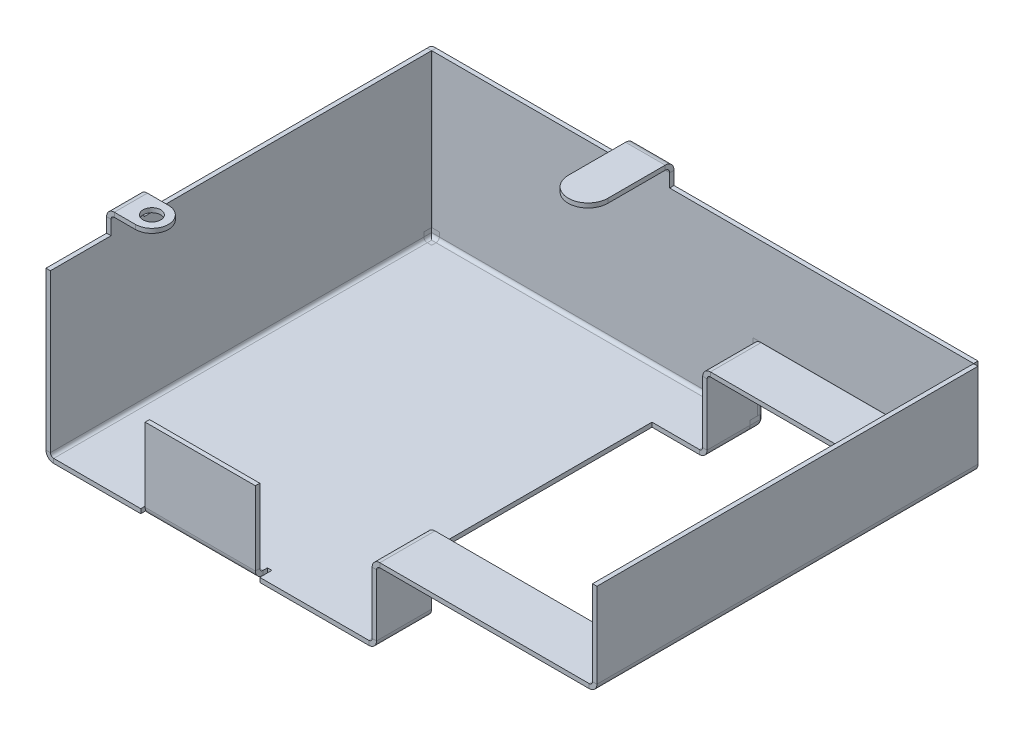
ISO-10303-21;
HEADER;
FILE_DESCRIPTION(('STEP AP214'),'2;1');
FILE_NAME('part.step','',(''),(''),'','','');
FILE_SCHEMA(('AUTOMOTIVE_DESIGN { 1 0 10303 214 1 1 1 1 }'));
ENDSEC;
DATA;
#1=APPLICATION_CONTEXT('core data for automotive mechanical design processes');
#2=APPLICATION_PROTOCOL_DEFINITION('international standard','automotive_design',2000,#1);
#3=PRODUCT_CONTEXT('',#1,'mechanical');
#4=PRODUCT('Part','Part','',(#3));
#5=PRODUCT_RELATED_PRODUCT_CATEGORY('part','',(#4));
#6=PRODUCT_DEFINITION_FORMATION('','',#4);
#7=PRODUCT_DEFINITION_CONTEXT('part definition',#1,'design');
#8=PRODUCT_DEFINITION('design','',#6,#7);
#9=PRODUCT_DEFINITION_SHAPE('','',#8);
#10=(LENGTH_UNIT() NAMED_UNIT(*) SI_UNIT(.MILLI.,.METRE.));
#11=(NAMED_UNIT(*) PLANE_ANGLE_UNIT() SI_UNIT($,.RADIAN.));
#12=(NAMED_UNIT(*) SI_UNIT($,.STERADIAN.) SOLID_ANGLE_UNIT());
#13=UNCERTAINTY_MEASURE_WITH_UNIT(LENGTH_MEASURE(1.E-05),#10,'distance_accuracy_value','');
#14=(GEOMETRIC_REPRESENTATION_CONTEXT(3) GLOBAL_UNCERTAINTY_ASSIGNED_CONTEXT((#13)) GLOBAL_UNIT_ASSIGNED_CONTEXT((#10,
#11,#12)) REPRESENTATION_CONTEXT('',''));
#15=CARTESIAN_POINT('',(0.,0.,0.));
#16=DIRECTION('',(0.,0.,1.));
#17=DIRECTION('',(1.,0.,0.));
#18=AXIS2_PLACEMENT_3D('',#15,#16,#17);
#19=CARTESIAN_POINT('',(2.,2.,175.));
#20=DIRECTION('',(1.,0.,0.));
#21=DIRECTION('',(0.,0.,-1.));
#22=AXIS2_PLACEMENT_3D('',#19,#20,#21);
#23=PLANE('',#22);
#24=DIRECTION('',(0.,1.,0.));
#25=VECTOR('',#24,1.);
#26=CARTESIAN_POINT('',(2.,2.,132.5));
#27=LINE('',#26,#25);
#28=CARTESIAN_POINT('',(2.00000000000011,75.,132.5));
#29=VERTEX_POINT('',#28);
#30=CARTESIAN_POINT('',(2.,81.5,132.5));
#31=VERTEX_POINT('',#30);
#32=EDGE_CURVE('E185',#29,#31,#27,.T.);
#33=ORIENTED_EDGE('',*,*,#32,.T.);
#34=DIRECTION('',(0.,0.,1.));
#35=VECTOR('',#34,1.);
#36=CARTESIAN_POINT('',(2.,81.5,175.));
#37=LINE('',#36,#35);
#38=CARTESIAN_POINT('',(2.,81.5,147.5));
#39=VERTEX_POINT('',#38);
#40=EDGE_CURVE('E931',#31,#39,#37,.T.);
#41=ORIENTED_EDGE('',*,*,#40,.T.);
#42=DIRECTION('',(0.,-1.,0.));
#43=VECTOR('',#42,1.);
#44=CARTESIAN_POINT('',(2.,2.,147.5));
#45=LINE('',#44,#43);
#46=CARTESIAN_POINT('',(2.00000000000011,75.,147.5));
#47=VERTEX_POINT('',#46);
#48=EDGE_CURVE('E943',#39,#47,#45,.T.);
#49=ORIENTED_EDGE('',*,*,#48,.T.);
#50=DIRECTION('',(0.,0.,-1.));
#51=VECTOR('',#50,1.);
#52=CARTESIAN_POINT('',(2.,75.,175.));
#53=LINE('',#52,#51);
#54=CARTESIAN_POINT('',(2.00000000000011,75.,175.));
#55=VERTEX_POINT('',#54);
#56=EDGE_CURVE('E944',#47,#55,#53,.F.);
#57=ORIENTED_EDGE('',*,*,#56,.T.);
#58=DIRECTION('',(0.,1.,0.));
#59=VECTOR('',#58,1.);
#60=CARTESIAN_POINT('',(2.,2.,175.));
#61=LINE('',#60,#59);
#62=CARTESIAN_POINT('',(2.,3.49999999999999,175.));
#63=VERTEX_POINT('',#62);
#64=EDGE_CURVE('E948',#55,#63,#61,.F.);
#65=ORIENTED_EDGE('',*,*,#64,.T.);
#66=DIRECTION('',(0.,0.,1.));
#67=VECTOR('',#66,1.);
#68=CARTESIAN_POINT('',(2.,3.5,5.49999999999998));
#69=LINE('',#68,#67);
#70=CARTESIAN_POINT('',(2.,3.5,5.49999999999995));
#71=VERTEX_POINT('',#70);
#72=EDGE_CURVE('E1206',#71,#63,#69,.T.);
#73=ORIENTED_EDGE('',*,*,#72,.F.);
#74=DIRECTION('',(0.,1.,0.));
#75=VECTOR('',#74,1.);
#76=CARTESIAN_POINT('',(2.,2.,5.49999999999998));
#77=LINE('',#76,#75);
#78=CARTESIAN_POINT('',(2.00000000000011,5.49999999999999,5.49999999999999));
#79=VERTEX_POINT('',#78);
#80=EDGE_CURVE('E955',#71,#79,#77,.T.);
#81=ORIENTED_EDGE('',*,*,#80,.T.);
#82=DIRECTION('',(0.,0.,1.));
#83=VECTOR('',#82,1.);
#84=CARTESIAN_POINT('',(2.,5.49999999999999,175.));
#85=LINE('',#84,#83);
#86=CARTESIAN_POINT('',(2.00000000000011,5.49999999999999,2.07071067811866));
#87=VERTEX_POINT('',#86);
#88=EDGE_CURVE('E1049',#87,#79,#85,.T.);
#89=ORIENTED_EDGE('',*,*,#88,.F.);
#90=DIRECTION('',(0.,1.,0.));
#91=VECTOR('',#90,1.);
#92=CARTESIAN_POINT('',(2.,2.,2.07071067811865));
#93=LINE('',#92,#91);
#94=CARTESIAN_POINT('',(2.00000000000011,75.,2.07071067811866));
#95=VERTEX_POINT('',#94);
#96=EDGE_CURVE('E952',#87,#95,#93,.T.);
#97=ORIENTED_EDGE('',*,*,#96,.T.);
#98=DIRECTION('',(0.,0.,-1.));
#99=VECTOR('',#98,1.);
#100=CARTESIAN_POINT('',(2.,75.,175.));
#101=LINE('',#100,#99);
#102=EDGE_CURVE('E950',#95,#29,#101,.F.);
#103=ORIENTED_EDGE('',*,*,#102,.T.);
#104=EDGE_LOOP('',(#33,#41,#49,#57,#65,#73,#81,#89,#97,#103));
#105=FACE_BOUND('',#104,.T.);
#106=ADVANCED_FACE('F181',(#105),#23,.T.);
#107=CARTESIAN_POINT('',(235.,0.,25.));
#108=DIRECTION('',(0.,0.,-1.));
#109=DIRECTION('',(-1.,0.,0.));
#110=AXIS2_PLACEMENT_3D('',#107,#108,#109);
#111=PLANE('',#110);
#112=DIRECTION('',(-1.,0.,0.));
#113=VECTOR('',#112,1.);
#114=CARTESIAN_POINT('',(235.,35.,25.));
#115=LINE('',#114,#113);
#116=CARTESIAN_POINT('',(235.,35.,25.));
#117=VERTEX_POINT('',#116);
#118=CARTESIAN_POINT('',(151.5,35.,25.));
#119=VERTEX_POINT('',#118);
#120=EDGE_CURVE('E1720',#117,#119,#115,.T.);
#121=ORIENTED_EDGE('',*,*,#120,.T.);
#122=DIRECTION('',(0.,-1.,0.));
#123=VECTOR('',#122,1.);
#124=CARTESIAN_POINT('',(151.5,35.,25.));
#125=LINE('',#124,#123);
#126=CARTESIAN_POINT('',(151.5,33.,25.));
#127=VERTEX_POINT('',#126);
#128=EDGE_CURVE('E929',#119,#127,#125,.T.);
#129=ORIENTED_EDGE('',*,*,#128,.T.);
#130=DIRECTION('',(-1.,0.,0.));
#131=VECTOR('',#130,1.);
#132=CARTESIAN_POINT('',(150.,33.,25.));
#133=LINE('',#132,#131);
#134=CARTESIAN_POINT('',(235.,33.,25.));
#135=VERTEX_POINT('',#134);
#136=EDGE_CURVE('E1700',#135,#127,#133,.T.);
#137=ORIENTED_EDGE('',*,*,#136,.F.);
#138=DIRECTION('',(0.,1.,0.));
#139=VECTOR('',#138,1.);
#140=CARTESIAN_POINT('',(235.,0.,25.));
#141=LINE('',#140,#139);
#142=EDGE_CURVE('E1706',#135,#117,#141,.T.);
#143=ORIENTED_EDGE('',*,*,#142,.T.);
#144=EDGE_LOOP('',(#121,#129,#137,#143));
#145=FACE_BOUND('',#144,.T.);
#146=ADVANCED_FACE('F1424',(#145),#111,.F.);
#147=DIRECTION('',(0.,-1.,0.));
#148=VECTOR('',#147,1.);
#149=CARTESIAN_POINT('',(150.,0.,25.));
#150=LINE('',#149,#148);
#151=CARTESIAN_POINT('',(150.,31.5,25.));
#152=VERTEX_POINT('',#151);
#153=CARTESIAN_POINT('',(150.,3.5,25.));
#154=VERTEX_POINT('',#153);
#155=EDGE_CURVE('E1702',#152,#154,#150,.T.);
#156=ORIENTED_EDGE('',*,*,#155,.F.);
#157=DIRECTION('',(-1.,0.,0.));
#158=VECTOR('',#157,1.);
#159=CARTESIAN_POINT('',(150.,31.5,25.));
#160=LINE('',#159,#158);
#161=CARTESIAN_POINT('',(148.,31.5,25.));
#162=VERTEX_POINT('',#161);
#163=EDGE_CURVE('E927',#152,#162,#160,.T.);
#164=ORIENTED_EDGE('',*,*,#163,.T.);
#165=DIRECTION('',(0.,-1.,0.));
#166=VECTOR('',#165,1.);
#167=CARTESIAN_POINT('',(148.,2.,25.));
#168=LINE('',#167,#166);
#169=CARTESIAN_POINT('',(148.,3.5,25.));
#170=VERTEX_POINT('',#169);
#171=EDGE_CURVE('E1691',#162,#170,#168,.T.);
#172=ORIENTED_EDGE('',*,*,#171,.T.);
#173=DIRECTION('',(1.,0.,0.));
#174=VECTOR('',#173,1.);
#175=CARTESIAN_POINT('',(148.,3.5,25.));
#176=LINE('',#175,#174);
#177=EDGE_CURVE('E925',#170,#154,#176,.T.);
#178=ORIENTED_EDGE('',*,*,#177,.T.);
#179=EDGE_LOOP('',(#156,#164,#172,#178));
#180=FACE_BOUND('',#179,.T.);
#181=ADVANCED_FACE('F1429',(#180),#111,.F.);
#182=ORIENTED_EDGE('',*,*,#128,.F.);
#183=CARTESIAN_POINT('',(151.5,31.5,25.));
#184=DIRECTION('',(0.,0.,-1.));
#185=DIRECTION('',(-1.,0.,0.));
#186=AXIS2_PLACEMENT_3D('',#183,#184,#185);
#187=CIRCLE('',#186,3.50000000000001);
#188=EDGE_CURVE('E1694',#119,#162,#187,.F.);
#189=ORIENTED_EDGE('',*,*,#188,.T.);
#190=ORIENTED_EDGE('',*,*,#163,.F.);
#191=CARTESIAN_POINT('',(151.5,31.5,25.));
#192=DIRECTION('',(0.,0.,-1.));
#193=DIRECTION('',(-1.,0.,0.));
#194=AXIS2_PLACEMENT_3D('',#191,#192,#193);
#195=CIRCLE('',#194,1.50000000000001);
#196=EDGE_CURVE('E906',#127,#152,#195,.F.);
#197=ORIENTED_EDGE('',*,*,#196,.F.);
#198=EDGE_LOOP('',(#182,#189,#190,#197));
#199=FACE_BOUND('',#198,.T.);
#200=ADVANCED_FACE('F2235',(#199),#111,.F.);
#201=DIRECTION('',(-1.,0.,0.));
#202=VECTOR('',#201,1.);
#203=CARTESIAN_POINT('',(235.,0.,25.));
#204=LINE('',#203,#202);
#205=CARTESIAN_POINT('',(146.5,0.,25.));
#206=VERTEX_POINT('',#205);
#207=CARTESIAN_POINT('',(125.,0.,25.));
#208=VERTEX_POINT('',#207);
#209=EDGE_CURVE('E1719',#206,#208,#204,.T.);
#210=ORIENTED_EDGE('',*,*,#209,.F.);
#211=DIRECTION('',(0.,1.,0.));
#212=VECTOR('',#211,1.);
#213=CARTESIAN_POINT('',(146.5,0.,25.));
#214=LINE('',#213,#212);
#215=CARTESIAN_POINT('',(146.5,1.99999999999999,25.));
#216=VERTEX_POINT('',#215);
#217=EDGE_CURVE('E923',#206,#216,#214,.T.);
#218=ORIENTED_EDGE('',*,*,#217,.T.);
#219=DIRECTION('',(-1.,0.,0.));
#220=VECTOR('',#219,1.);
#221=CARTESIAN_POINT('',(2.,2.,25.));
#222=LINE('',#221,#220);
#223=CARTESIAN_POINT('',(125.,2.,25.));
#224=VERTEX_POINT('',#223);
#225=EDGE_CURVE('E1686',#216,#224,#222,.T.);
#226=ORIENTED_EDGE('',*,*,#225,.T.);
#227=DIRECTION('',(0.,1.,0.));
#228=VECTOR('',#227,1.);
#229=CARTESIAN_POINT('',(125.,0.,25.));
#230=LINE('',#229,#228);
#231=EDGE_CURVE('E1708',#208,#224,#230,.T.);
#232=ORIENTED_EDGE('',*,*,#231,.F.);
#233=EDGE_LOOP('',(#210,#218,#226,#232));
#234=FACE_BOUND('',#233,.T.);
#235=ADVANCED_FACE('F2041',(#234),#111,.F.);
#236=CARTESIAN_POINT('',(235.,0.,150.));
#237=DIRECTION('',(0.,0.,1.));
#238=DIRECTION('',(1.,0.,0.));
#239=AXIS2_PLACEMENT_3D('',#236,#237,#238);
#240=PLANE('',#239);
#241=DIRECTION('',(1.,0.,0.));
#242=VECTOR('',#241,1.);
#243=CARTESIAN_POINT('',(150.,33.,150.));
#244=LINE('',#243,#242);
#245=CARTESIAN_POINT('',(151.5,33.,150.));
#246=VERTEX_POINT('',#245);
#247=CARTESIAN_POINT('',(235.,33.,150.));
#248=VERTEX_POINT('',#247);
#249=EDGE_CURVE('E1680',#246,#248,#244,.T.);
#250=ORIENTED_EDGE('',*,*,#249,.F.);
#251=DIRECTION('',(0.,1.,0.));
#252=VECTOR('',#251,1.);
#253=CARTESIAN_POINT('',(151.5,33.,150.));
#254=LINE('',#253,#252);
#255=CARTESIAN_POINT('',(151.5,35.,150.));
#256=VERTEX_POINT('',#255);
#257=EDGE_CURVE('E921',#246,#256,#254,.T.);
#258=ORIENTED_EDGE('',*,*,#257,.T.);
#259=DIRECTION('',(1.,0.,0.));
#260=VECTOR('',#259,1.);
#261=CARTESIAN_POINT('',(235.,35.,150.));
#262=LINE('',#261,#260);
#263=CARTESIAN_POINT('',(235.,35.,150.));
#264=VERTEX_POINT('',#263);
#265=EDGE_CURVE('E1716',#256,#264,#262,.T.);
#266=ORIENTED_EDGE('',*,*,#265,.T.);
#267=DIRECTION('',(0.,1.,0.));
#268=VECTOR('',#267,1.);
#269=CARTESIAN_POINT('',(235.,0.,150.));
#270=LINE('',#269,#268);
#271=EDGE_CURVE('E1705',#248,#264,#270,.T.);
#272=ORIENTED_EDGE('',*,*,#271,.F.);
#273=EDGE_LOOP('',(#250,#258,#266,#272));
#274=FACE_BOUND('',#273,.T.);
#275=ADVANCED_FACE('F2222',(#274),#240,.F.);
#276=DIRECTION('',(0.,1.,0.));
#277=VECTOR('',#276,1.);
#278=CARTESIAN_POINT('',(148.,2.,150.));
#279=LINE('',#278,#277);
#280=CARTESIAN_POINT('',(148.,3.5,150.));
#281=VERTEX_POINT('',#280);
#282=CARTESIAN_POINT('',(148.,31.5,150.));
#283=VERTEX_POINT('',#282);
#284=EDGE_CURVE('E1671',#281,#283,#279,.T.);
#285=ORIENTED_EDGE('',*,*,#284,.T.);
#286=DIRECTION('',(1.,0.,0.));
#287=VECTOR('',#286,1.);
#288=CARTESIAN_POINT('',(148.,31.5,150.));
#289=LINE('',#288,#287);
#290=CARTESIAN_POINT('',(150.,31.5,150.));
#291=VERTEX_POINT('',#290);
#292=EDGE_CURVE('E919',#283,#291,#289,.T.);
#293=ORIENTED_EDGE('',*,*,#292,.T.);
#294=DIRECTION('',(0.,1.,0.));
#295=VECTOR('',#294,1.);
#296=CARTESIAN_POINT('',(150.,0.,150.));
#297=LINE('',#296,#295);
#298=CARTESIAN_POINT('',(150.,3.5,150.));
#299=VERTEX_POINT('',#298);
#300=EDGE_CURVE('E1683',#299,#291,#297,.T.);
#301=ORIENTED_EDGE('',*,*,#300,.F.);
#302=DIRECTION('',(-1.,0.,0.));
#303=VECTOR('',#302,1.);
#304=CARTESIAN_POINT('',(150.,3.5,150.));
#305=LINE('',#304,#303);
#306=EDGE_CURVE('E917',#299,#281,#305,.T.);
#307=ORIENTED_EDGE('',*,*,#306,.T.);
#308=EDGE_LOOP('',(#285,#293,#301,#307));
#309=FACE_BOUND('',#308,.T.);
#310=ADVANCED_FACE('F2216',(#309),#240,.F.);
#311=ORIENTED_EDGE('',*,*,#257,.F.);
#312=CARTESIAN_POINT('',(151.5,31.5,150.));
#313=DIRECTION('',(0.,0.,1.));
#314=DIRECTION('',(1.,0.,0.));
#315=AXIS2_PLACEMENT_3D('',#312,#313,#314);
#316=CIRCLE('',#315,1.50000000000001);
#317=EDGE_CURVE('E909',#291,#246,#316,.F.);
#318=ORIENTED_EDGE('',*,*,#317,.F.);
#319=ORIENTED_EDGE('',*,*,#292,.F.);
#320=CARTESIAN_POINT('',(151.5,31.5,150.));
#321=DIRECTION('',(0.,0.,1.));
#322=DIRECTION('',(1.,0.,0.));
#323=AXIS2_PLACEMENT_3D('',#320,#321,#322);
#324=CIRCLE('',#323,3.50000000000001);
#325=EDGE_CURVE('E1674',#283,#256,#324,.F.);
#326=ORIENTED_EDGE('',*,*,#325,.T.);
#327=EDGE_LOOP('',(#311,#318,#319,#326));
#328=FACE_BOUND('',#327,.T.);
#329=ADVANCED_FACE('F2210',(#328),#240,.F.);
#330=DIRECTION('',(1.,0.,0.));
#331=VECTOR('',#330,1.);
#332=CARTESIAN_POINT('',(2.00000000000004,2.,150.));
#333=LINE('',#332,#331);
#334=CARTESIAN_POINT('',(125.,2.,150.));
#335=VERTEX_POINT('',#334);
#336=CARTESIAN_POINT('',(146.5,1.99999999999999,150.));
#337=VERTEX_POINT('',#336);
#338=EDGE_CURVE('E1665',#335,#337,#333,.T.);
#339=ORIENTED_EDGE('',*,*,#338,.T.);
#340=DIRECTION('',(0.,-1.,0.));
#341=VECTOR('',#340,1.);
#342=CARTESIAN_POINT('',(146.5,1.99999999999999,150.));
#343=LINE('',#342,#341);
#344=CARTESIAN_POINT('',(146.5,0.,150.));
#345=VERTEX_POINT('',#344);
#346=EDGE_CURVE('E915',#337,#345,#343,.T.);
#347=ORIENTED_EDGE('',*,*,#346,.T.);
#348=DIRECTION('',(1.,0.,0.));
#349=VECTOR('',#348,1.);
#350=CARTESIAN_POINT('',(235.,0.,150.));
#351=LINE('',#350,#349);
#352=CARTESIAN_POINT('',(125.,0.,150.));
#353=VERTEX_POINT('',#352);
#354=EDGE_CURVE('E1709',#353,#345,#351,.T.);
#355=ORIENTED_EDGE('',*,*,#354,.F.);
#356=DIRECTION('',(0.,1.,0.));
#357=VECTOR('',#356,1.);
#358=CARTESIAN_POINT('',(125.,0.,150.));
#359=LINE('',#358,#357);
#360=EDGE_CURVE('E1712',#353,#335,#359,.T.);
#361=ORIENTED_EDGE('',*,*,#360,.T.);
#362=EDGE_LOOP('',(#339,#347,#355,#361));
#363=FACE_BOUND('',#362,.T.);
#364=ADVANCED_FACE('F2049',(#363),#240,.F.);
#365=CARTESIAN_POINT('',(148.,2.,2.));
#366=DIRECTION('',(-1.,0.,0.));
#367=DIRECTION('',(0.,0.,1.));
#368=AXIS2_PLACEMENT_3D('',#365,#366,#367);
#369=PLANE('',#368);
#370=ORIENTED_EDGE('',*,*,#284,.F.);
#371=DIRECTION('',(0.,0.,-1.));
#372=VECTOR('',#371,1.);
#373=CARTESIAN_POINT('',(148.,3.5,175.));
#374=LINE('',#373,#372);
#375=CARTESIAN_POINT('',(148.,3.5,175.));
#376=VERTEX_POINT('',#375);
#377=EDGE_CURVE('E1098',#376,#281,#374,.T.);
#378=ORIENTED_EDGE('',*,*,#377,.F.);
#379=DIRECTION('',(0.,1.,0.));
#380=VECTOR('',#379,1.);
#381=CARTESIAN_POINT('',(148.,2.,175.));
#382=LINE('',#381,#380);
#383=CARTESIAN_POINT('',(148.,31.5,175.));
#384=VERTEX_POINT('',#383);
#385=EDGE_CURVE('E1111',#376,#384,#382,.T.);
#386=ORIENTED_EDGE('',*,*,#385,.T.);
#387=DIRECTION('',(0.,0.,1.));
#388=VECTOR('',#387,1.);
#389=CARTESIAN_POINT('',(148.,31.5,2.07071067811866));
#390=LINE('',#389,#388);
#391=EDGE_CURVE('E1101',#283,#384,#390,.T.);
#392=ORIENTED_EDGE('',*,*,#391,.F.);
#393=EDGE_LOOP('',(#370,#378,#386,#392));
#394=FACE_BOUND('',#393,.T.);
#395=ADVANCED_FACE('F1494',(#394),#369,.T.);
#396=CARTESIAN_POINT('',(150.,0.,0.));
#397=DIRECTION('',(-1.,0.,0.));
#398=DIRECTION('',(0.,0.,1.));
#399=AXIS2_PLACEMENT_3D('',#396,#397,#398);
#400=PLANE('',#399);
#401=DIRECTION('',(0.,0.,-1.));
#402=VECTOR('',#401,1.);
#403=CARTESIAN_POINT('',(150.,3.5,175.));
#404=LINE('',#403,#402);
#405=CARTESIAN_POINT('',(150.,3.5,175.));
#406=VERTEX_POINT('',#405);
#407=EDGE_CURVE('E1081',#406,#299,#404,.T.);
#408=ORIENTED_EDGE('',*,*,#407,.T.);
#409=ORIENTED_EDGE('',*,*,#300,.T.);
#410=DIRECTION('',(0.,0.,1.));
#411=VECTOR('',#410,1.);
#412=CARTESIAN_POINT('',(150.,31.5,2.07071067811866));
#413=LINE('',#412,#411);
#414=CARTESIAN_POINT('',(150.,31.5,175.));
#415=VERTEX_POINT('',#414);
#416=EDGE_CURVE('E1084',#291,#415,#413,.T.);
#417=ORIENTED_EDGE('',*,*,#416,.T.);
#418=DIRECTION('',(0.,1.,0.));
#419=VECTOR('',#418,1.);
#420=CARTESIAN_POINT('',(150.,2.,175.));
#421=LINE('',#420,#419);
#422=EDGE_CURVE('E827',#406,#415,#421,.T.);
#423=ORIENTED_EDGE('',*,*,#422,.F.);
#424=EDGE_LOOP('',(#408,#409,#417,#423));
#425=FACE_BOUND('',#424,.T.);
#426=ADVANCED_FACE('F1489',(#425),#400,.F.);
#427=CARTESIAN_POINT('',(146.5,3.5,559.000457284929));
#428=DIRECTION('',(0.,0.,-1.));
#429=DIRECTION('',(-1.,0.,0.));
#430=AXIS2_PLACEMENT_3D('',#427,#428,#429);
#431=CYLINDRICAL_SURFACE('',#430,3.50000000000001);
#432=CARTESIAN_POINT('',(146.5,3.5,150.));
#433=DIRECTION('',(0.,0.,1.));
#434=DIRECTION('',(1.,0.,0.));
#435=AXIS2_PLACEMENT_3D('',#432,#433,#434);
#436=CIRCLE('',#435,3.50000000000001);
#437=EDGE_CURVE('E1677',#299,#345,#436,.F.);
#438=ORIENTED_EDGE('',*,*,#437,.F.);
#439=ORIENTED_EDGE('',*,*,#407,.F.);
#440=CARTESIAN_POINT('',(146.5,3.5,175.));
#441=DIRECTION('',(0.,0.,-1.));
#442=DIRECTION('',(-1.,0.,0.));
#443=AXIS2_PLACEMENT_3D('',#440,#441,#442);
#444=CIRCLE('',#443,3.50000000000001);
#445=CARTESIAN_POINT('',(146.5,0.,175.));
#446=VERTEX_POINT('',#445);
#447=EDGE_CURVE('E1156',#406,#446,#444,.T.);
#448=ORIENTED_EDGE('',*,*,#447,.T.);
#449=DIRECTION('',(0.,0.,-1.));
#450=VECTOR('',#449,1.);
#451=CARTESIAN_POINT('',(146.5,0.,175.));
#452=LINE('',#451,#450);
#453=EDGE_CURVE('E1062',#446,#345,#452,.T.);
#454=ORIENTED_EDGE('',*,*,#453,.T.);
#455=EDGE_LOOP('',(#438,#439,#448,#454));
#456=FACE_BOUND('',#455,.T.);
#457=ADVANCED_FACE('F2054',(#456),#431,.T.);
#458=CARTESIAN_POINT('',(146.5,3.5,559.000457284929));
#459=DIRECTION('',(0.,0.,-1.));
#460=DIRECTION('',(-1.,0.,0.));
#461=AXIS2_PLACEMENT_3D('',#458,#459,#460);
#462=CYLINDRICAL_SURFACE('',#461,1.50000000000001);
#463=ORIENTED_EDGE('',*,*,#377,.T.);
#464=CARTESIAN_POINT('',(146.5,3.5,150.));
#465=DIRECTION('',(0.,0.,1.));
#466=DIRECTION('',(1.,0.,0.));
#467=AXIS2_PLACEMENT_3D('',#464,#465,#466);
#468=CIRCLE('',#467,1.50000000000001);
#469=EDGE_CURVE('E1668',#281,#337,#468,.F.);
#470=ORIENTED_EDGE('',*,*,#469,.T.);
#471=DIRECTION('',(0.,0.,-1.));
#472=VECTOR('',#471,1.);
#473=CARTESIAN_POINT('',(146.5,2.,175.));
#474=LINE('',#473,#472);
#475=CARTESIAN_POINT('',(146.5,1.99999999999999,175.));
#476=VERTEX_POINT('',#475);
#477=EDGE_CURVE('E1190',#476,#337,#474,.T.);
#478=ORIENTED_EDGE('',*,*,#477,.F.);
#479=CARTESIAN_POINT('',(146.5,3.5,175.));
#480=DIRECTION('',(0.,0.,-1.));
#481=DIRECTION('',(-1.,0.,0.));
#482=AXIS2_PLACEMENT_3D('',#479,#480,#481);
#483=CIRCLE('',#482,1.50000000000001);
#484=EDGE_CURVE('E1151',#376,#476,#483,.T.);
#485=ORIENTED_EDGE('',*,*,#484,.F.);
#486=EDGE_LOOP('',(#463,#470,#478,#485));
#487=FACE_BOUND('',#486,.T.);
#488=ADVANCED_FACE('F2069',(#487),#462,.F.);
#489=CARTESIAN_POINT('',(151.5,31.5,-347.174806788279));
#490=DIRECTION('',(0.,0.,1.));
#491=DIRECTION('',(1.,0.,0.));
#492=AXIS2_PLACEMENT_3D('',#489,#490,#491);
#493=CYLINDRICAL_SURFACE('',#492,3.50000000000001);
#494=ORIENTED_EDGE('',*,*,#325,.F.);
#495=ORIENTED_EDGE('',*,*,#391,.T.);
#496=CARTESIAN_POINT('',(151.5,31.5,175.));
#497=DIRECTION('',(0.,0.,1.));
#498=DIRECTION('',(1.,0.,0.));
#499=AXIS2_PLACEMENT_3D('',#496,#497,#498);
#500=CIRCLE('',#499,3.50000000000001);
#501=CARTESIAN_POINT('',(151.5,35.,175.));
#502=VERTEX_POINT('',#501);
#503=EDGE_CURVE('E1145',#502,#384,#500,.T.);
#504=ORIENTED_EDGE('',*,*,#503,.F.);
#505=DIRECTION('',(0.,0.,-1.));
#506=VECTOR('',#505,1.);
#507=CARTESIAN_POINT('',(151.5,35.,2.07071067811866));
#508=LINE('',#507,#506);
#509=EDGE_CURVE('E820',#502,#256,#508,.T.);
#510=ORIENTED_EDGE('',*,*,#509,.T.);
#511=EDGE_LOOP('',(#494,#495,#504,#510));
#512=FACE_BOUND('',#511,.T.);
#513=ADVANCED_FACE('F2181',(#512),#493,.T.);
#514=CARTESIAN_POINT('',(151.5,31.5,-347.174806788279));
#515=DIRECTION('',(0.,0.,1.));
#516=DIRECTION('',(1.,0.,0.));
#517=AXIS2_PLACEMENT_3D('',#514,#515,#516);
#518=CYLINDRICAL_SURFACE('',#517,1.50000000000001);
#519=ORIENTED_EDGE('',*,*,#416,.F.);
#520=ORIENTED_EDGE('',*,*,#317,.T.);
#521=DIRECTION('',(0.,0.,-1.));
#522=VECTOR('',#521,1.);
#523=CARTESIAN_POINT('',(151.5,33.,2.07071067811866));
#524=LINE('',#523,#522);
#525=CARTESIAN_POINT('',(151.5,33.,175.));
#526=VERTEX_POINT('',#525);
#527=EDGE_CURVE('E861',#526,#246,#524,.T.);
#528=ORIENTED_EDGE('',*,*,#527,.F.);
#529=CARTESIAN_POINT('',(151.5,31.5,175.));
#530=DIRECTION('',(0.,0.,1.));
#531=DIRECTION('',(1.,0.,0.));
#532=AXIS2_PLACEMENT_3D('',#529,#530,#531);
#533=CIRCLE('',#532,1.50000000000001);
#534=EDGE_CURVE('E1152',#526,#415,#533,.T.);
#535=ORIENTED_EDGE('',*,*,#534,.T.);
#536=EDGE_LOOP('',(#519,#520,#528,#535));
#537=FACE_BOUND('',#536,.T.);
#538=ADVANCED_FACE('F1476',(#537),#518,.F.);
#539=CARTESIAN_POINT('',(2.,2.,2.));
#540=DIRECTION('',(0.,1.,0.));
#541=DIRECTION('',(0.,0.,1.));
#542=AXIS2_PLACEMENT_3D('',#539,#540,#541);
#543=PLANE('',#542);
#544=ORIENTED_EDGE('',*,*,#338,.F.);
#545=DIRECTION('',(0.,0.,1.));
#546=VECTOR('',#545,1.);
#547=CARTESIAN_POINT('',(125.,2.,2.));
#548=LINE('',#547,#546);
#549=EDGE_CURVE('E1638',#224,#335,#548,.T.);
#550=ORIENTED_EDGE('',*,*,#549,.F.);
#551=ORIENTED_EDGE('',*,*,#225,.F.);
#552=CARTESIAN_POINT('',(146.5,1.99999999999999,5.49999999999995));
#553=VERTEX_POINT('',#552);
#554=EDGE_CURVE('E1193',#216,#553,#474,.T.);
#555=ORIENTED_EDGE('',*,*,#554,.T.);
#556=DIRECTION('',(-1.,0.,0.));
#557=VECTOR('',#556,1.);
#558=CARTESIAN_POINT('',(2.,2.,5.49999999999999));
#559=LINE('',#558,#557);
#560=CARTESIAN_POINT('',(144.5,2.,5.49999999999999));
#561=VERTEX_POINT('',#560);
#562=EDGE_CURVE('E1187',#553,#561,#559,.T.);
#563=ORIENTED_EDGE('',*,*,#562,.T.);
#564=DIRECTION('',(0.,0.,-1.));
#565=VECTOR('',#564,1.);
#566=CARTESIAN_POINT('',(144.5,2.,2.));
#567=LINE('',#566,#565);
#568=CARTESIAN_POINT('',(144.5,2.,3.5));
#569=VERTEX_POINT('',#568);
#570=EDGE_CURVE('E1184',#561,#569,#567,.T.);
#571=ORIENTED_EDGE('',*,*,#570,.T.);
#572=DIRECTION('',(-1.,0.,0.));
#573=VECTOR('',#572,1.);
#574=CARTESIAN_POINT('',(144.5,2.,3.5));
#575=LINE('',#574,#573);
#576=CARTESIAN_POINT('',(5.49999999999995,2.,3.5));
#577=VERTEX_POINT('',#576);
#578=EDGE_CURVE('E1181',#569,#577,#575,.T.);
#579=ORIENTED_EDGE('',*,*,#578,.T.);
#580=DIRECTION('',(0.,0.,1.));
#581=VECTOR('',#580,1.);
#582=CARTESIAN_POINT('',(5.49999999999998,2.,2.));
#583=LINE('',#582,#581);
#584=CARTESIAN_POINT('',(5.49999999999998,2.,5.49999999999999));
#585=VERTEX_POINT('',#584);
#586=EDGE_CURVE('E1179',#577,#585,#583,.T.);
#587=ORIENTED_EDGE('',*,*,#586,.T.);
#588=DIRECTION('',(-1.,0.,0.));
#589=VECTOR('',#588,1.);
#590=CARTESIAN_POINT('',(2.,2.,5.49999999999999));
#591=LINE('',#590,#589);
#592=CARTESIAN_POINT('',(3.5,2.,5.49999999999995));
#593=VERTEX_POINT('',#592);
#594=EDGE_CURVE('E1176',#585,#593,#591,.T.);
#595=ORIENTED_EDGE('',*,*,#594,.T.);
#596=DIRECTION('',(0.,0.,1.));
#597=VECTOR('',#596,1.);
#598=CARTESIAN_POINT('',(3.5,2.,5.49999999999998));
#599=LINE('',#598,#597);
#600=CARTESIAN_POINT('',(3.5,2.,175.));
#601=VERTEX_POINT('',#600);
#602=EDGE_CURVE('E1173',#593,#601,#599,.T.);
#603=ORIENTED_EDGE('',*,*,#602,.T.);
#604=DIRECTION('',(-1.,0.,0.));
#605=VECTOR('',#604,1.);
#606=CARTESIAN_POINT('',(2.,2.,175.));
#607=LINE('',#606,#605);
#608=CARTESIAN_POINT('',(43.,2.,175.));
#609=VERTEX_POINT('',#608);
#610=EDGE_CURVE('E1194',#601,#609,#607,.F.);
#611=ORIENTED_EDGE('',*,*,#610,.T.);
#612=DIRECTION('',(0.,0.,1.));
#613=VECTOR('',#612,1.);
#614=CARTESIAN_POINT('',(43.,2.,169.5));
#615=LINE('',#614,#613);
#616=CARTESIAN_POINT('',(43.,2.,169.5));
#617=VERTEX_POINT('',#616);
#618=EDGE_CURVE('E1600',#617,#609,#615,.T.);
#619=ORIENTED_EDGE('',*,*,#618,.F.);
#620=DIRECTION('',(-1.,0.,0.));
#621=VECTOR('',#620,1.);
#622=CARTESIAN_POINT('',(45.,2.,169.5));
#623=LINE('',#622,#621);
#624=CARTESIAN_POINT('',(45.,2.,169.5));
#625=VERTEX_POINT('',#624);
#626=EDGE_CURVE('E1597',#625,#617,#623,.T.);
#627=ORIENTED_EDGE('',*,*,#626,.F.);
#628=DIRECTION('',(0.,0.,-1.));
#629=VECTOR('',#628,1.);
#630=CARTESIAN_POINT('',(45.,2.,171.5));
#631=LINE('',#630,#629);
#632=CARTESIAN_POINT('',(45.,2.,171.5));
#633=VERTEX_POINT('',#632);
#634=EDGE_CURVE('E1593',#633,#625,#631,.T.);
#635=ORIENTED_EDGE('',*,*,#634,.F.);
#636=DIRECTION('',(1.,0.,0.));
#637=VECTOR('',#636,1.);
#638=CARTESIAN_POINT('',(95.,2.,171.5));
#639=LINE('',#638,#637);
#640=CARTESIAN_POINT('',(95.,2.,171.5));
#641=VERTEX_POINT('',#640);
#642=EDGE_CURVE('E1620',#641,#633,#639,.F.);
#643=ORIENTED_EDGE('',*,*,#642,.F.);
#644=DIRECTION('',(0.,0.,1.));
#645=VECTOR('',#644,1.);
#646=CARTESIAN_POINT('',(95.,2.,169.5));
#647=LINE('',#646,#645);
#648=CARTESIAN_POINT('',(95.,2.,169.5));
#649=VERTEX_POINT('',#648);
#650=EDGE_CURVE('E1589',#649,#641,#647,.T.);
#651=ORIENTED_EDGE('',*,*,#650,.F.);
#652=DIRECTION('',(-1.,0.,0.));
#653=VECTOR('',#652,1.);
#654=CARTESIAN_POINT('',(97.,2.,169.5));
#655=LINE('',#654,#653);
#656=CARTESIAN_POINT('',(97.,2.,169.5));
#657=VERTEX_POINT('',#656);
#658=EDGE_CURVE('E1586',#657,#649,#655,.T.);
#659=ORIENTED_EDGE('',*,*,#658,.F.);
#660=DIRECTION('',(0.,0.,-1.));
#661=VECTOR('',#660,1.);
#662=CARTESIAN_POINT('',(97.,2.,175.));
#663=LINE('',#662,#661);
#664=CARTESIAN_POINT('',(97.,2.,175.));
#665=VERTEX_POINT('',#664);
#666=EDGE_CURVE('E1576',#665,#657,#663,.T.);
#667=ORIENTED_EDGE('',*,*,#666,.F.);
#668=EDGE_CURVE('E1197',#665,#476,#607,.F.);
#669=ORIENTED_EDGE('',*,*,#668,.T.);
#670=ORIENTED_EDGE('',*,*,#477,.T.);
#671=EDGE_LOOP('',(#544,#550,#551,#555,#563,#571,#579,#587,#595,#603,#611,#619,#627,#635,#643,
#651,#659,#667,#669,#670));
#672=FACE_BOUND('',#671,.T.);
#673=ADVANCED_FACE('F1290',(#672),#543,.T.);
#674=CARTESIAN_POINT('',(0.,0.,0.));
#675=DIRECTION('',(0.,1.,0.));
#676=DIRECTION('',(0.,0.,1.));
#677=AXIS2_PLACEMENT_3D('',#674,#675,#676);
#678=PLANE('',#677);
#679=DIRECTION('',(0.,0.,1.));
#680=VECTOR('',#679,1.);
#681=CARTESIAN_POINT('',(125.,0.,25.));
#682=LINE('',#681,#680);
#683=EDGE_CURVE('E1729',#208,#353,#682,.T.);
#684=ORIENTED_EDGE('',*,*,#683,.T.);
#685=ORIENTED_EDGE('',*,*,#354,.T.);
#686=ORIENTED_EDGE('',*,*,#453,.F.);
#687=DIRECTION('',(1.,0.,0.));
#688=VECTOR('',#687,1.);
#689=CARTESIAN_POINT('',(250.,0.,175.));
#690=LINE('',#689,#688);
#691=CARTESIAN_POINT('',(97.,0.,175.));
#692=VERTEX_POINT('',#691);
#693=EDGE_CURVE('E1167',#692,#446,#690,.T.);
#694=ORIENTED_EDGE('',*,*,#693,.F.);
#695=DIRECTION('',(0.,0.,1.));
#696=VECTOR('',#695,1.);
#697=CARTESIAN_POINT('',(97.,0.,0.));
#698=LINE('',#697,#696);
#699=CARTESIAN_POINT('',(97.,0.,169.5));
#700=VERTEX_POINT('',#699);
#701=EDGE_CURVE('E1566',#700,#692,#698,.T.);
#702=ORIENTED_EDGE('',*,*,#701,.F.);
#703=DIRECTION('',(1.,0.,0.));
#704=VECTOR('',#703,1.);
#705=CARTESIAN_POINT('',(0.,0.,169.5));
#706=LINE('',#705,#704);
#707=CARTESIAN_POINT('',(95.,0.,169.5));
#708=VERTEX_POINT('',#707);
#709=EDGE_CURVE('E903',#708,#700,#706,.T.);
#710=ORIENTED_EDGE('',*,*,#709,.F.);
#711=DIRECTION('',(0.,0.,-1.));
#712=VECTOR('',#711,1.);
#713=CARTESIAN_POINT('',(95.,0.,0.));
#714=LINE('',#713,#712);
#715=CARTESIAN_POINT('',(95.,0.,171.5));
#716=VERTEX_POINT('',#715);
#717=EDGE_CURVE('E900',#716,#708,#714,.T.);
#718=ORIENTED_EDGE('',*,*,#717,.F.);
#719=DIRECTION('',(1.,0.,0.));
#720=VECTOR('',#719,1.);
#721=CARTESIAN_POINT('',(95.,0.,171.5));
#722=LINE('',#721,#720);
#723=CARTESIAN_POINT('',(45.,0.,171.5));
#724=VERTEX_POINT('',#723);
#725=EDGE_CURVE('E1630',#716,#724,#722,.F.);
#726=ORIENTED_EDGE('',*,*,#725,.T.);
#727=DIRECTION('',(0.,0.,1.));
#728=VECTOR('',#727,1.);
#729=CARTESIAN_POINT('',(45.,0.,0.));
#730=LINE('',#729,#728);
#731=CARTESIAN_POINT('',(45.,0.,169.5));
#732=VERTEX_POINT('',#731);
#733=EDGE_CURVE('E897',#732,#724,#730,.T.);
#734=ORIENTED_EDGE('',*,*,#733,.F.);
#735=DIRECTION('',(1.,0.,0.));
#736=VECTOR('',#735,1.);
#737=CARTESIAN_POINT('',(0.,0.,169.5));
#738=LINE('',#737,#736);
#739=CARTESIAN_POINT('',(43.,0.,169.5));
#740=VERTEX_POINT('',#739);
#741=EDGE_CURVE('E864',#740,#732,#738,.T.);
#742=ORIENTED_EDGE('',*,*,#741,.F.);
#743=DIRECTION('',(0.,0.,-1.));
#744=VECTOR('',#743,1.);
#745=CARTESIAN_POINT('',(43.,0.,0.));
#746=LINE('',#745,#744);
#747=CARTESIAN_POINT('',(43.,0.,175.));
#748=VERTEX_POINT('',#747);
#749=EDGE_CURVE('E1571',#748,#740,#746,.T.);
#750=ORIENTED_EDGE('',*,*,#749,.F.);
#751=CARTESIAN_POINT('',(3.5,0.,175.));
#752=VERTEX_POINT('',#751);
#753=EDGE_CURVE('E1074',#752,#748,#690,.T.);
#754=ORIENTED_EDGE('',*,*,#753,.F.);
#755=DIRECTION('',(0.,0.,1.));
#756=VECTOR('',#755,1.);
#757=CARTESIAN_POINT('',(3.5,0.,5.49999999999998));
#758=LINE('',#757,#756);
#759=CARTESIAN_POINT('',(3.5,0.,5.49999999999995));
#760=VERTEX_POINT('',#759);
#761=EDGE_CURVE('E1210',#760,#752,#758,.T.);
#762=ORIENTED_EDGE('',*,*,#761,.F.);
#763=DIRECTION('',(-1.,0.,0.));
#764=VECTOR('',#763,1.);
#765=CARTESIAN_POINT('',(0.,0.,5.49999999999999));
#766=LINE('',#765,#764);
#767=CARTESIAN_POINT('',(5.49999999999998,0.,5.49999999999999));
#768=VERTEX_POINT('',#767);
#769=EDGE_CURVE('E1203',#768,#760,#766,.T.);
#770=ORIENTED_EDGE('',*,*,#769,.F.);
#771=DIRECTION('',(0.,0.,1.));
#772=VECTOR('',#771,1.);
#773=CARTESIAN_POINT('',(5.49999999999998,0.,0.));
#774=LINE('',#773,#772);
#775=CARTESIAN_POINT('',(5.49999999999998,0.,3.5));
#776=VERTEX_POINT('',#775);
#777=EDGE_CURVE('E1200',#776,#768,#774,.T.);
#778=ORIENTED_EDGE('',*,*,#777,.F.);
#779=DIRECTION('',(-1.,0.,0.));
#780=VECTOR('',#779,1.);
#781=CARTESIAN_POINT('',(144.5,0.,3.5));
#782=LINE('',#781,#780);
#783=CARTESIAN_POINT('',(144.5,0.,3.5));
#784=VERTEX_POINT('',#783);
#785=EDGE_CURVE('E1220',#784,#776,#782,.T.);
#786=ORIENTED_EDGE('',*,*,#785,.F.);
#787=DIRECTION('',(0.,0.,-1.));
#788=VECTOR('',#787,1.);
#789=CARTESIAN_POINT('',(144.5,0.,0.));
#790=LINE('',#789,#788);
#791=CARTESIAN_POINT('',(144.5,0.,5.49999999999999));
#792=VERTEX_POINT('',#791);
#793=EDGE_CURVE('E1198',#792,#784,#790,.T.);
#794=ORIENTED_EDGE('',*,*,#793,.F.);
#795=DIRECTION('',(-1.,0.,0.));
#796=VECTOR('',#795,1.);
#797=CARTESIAN_POINT('',(0.,0.,5.49999999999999));
#798=LINE('',#797,#796);
#799=CARTESIAN_POINT('',(146.5,0.,5.49999999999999));
#800=VERTEX_POINT('',#799);
#801=EDGE_CURVE('E1171',#800,#792,#798,.T.);
#802=ORIENTED_EDGE('',*,*,#801,.F.);
#803=EDGE_CURVE('E1065',#206,#800,#452,.T.);
#804=ORIENTED_EDGE('',*,*,#803,.F.);
#805=ORIENTED_EDGE('',*,*,#209,.T.);
#806=EDGE_LOOP('',(#684,#685,#686,#694,#702,#710,#718,#726,#734,#742,#750,#754,#762,#770,#778,
#786,#794,#802,#804,#805));
#807=FACE_BOUND('',#806,.T.);
#808=ADVANCED_FACE('F1475',(#807),#678,.F.);
#809=CARTESIAN_POINT('',(2.,448.592655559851,175.));
#810=DIRECTION('',(0.,0.,-1.));
#811=DIRECTION('',(-1.,0.,0.));
#812=AXIS2_PLACEMENT_3D('',#809,#810,#811);
#813=PLANE('',#812);
#814=DIRECTION('',(0.,-1.,0.));
#815=VECTOR('',#814,1.);
#816=CARTESIAN_POINT('',(97.,2.,175.));
#817=LINE('',#816,#815);
#818=EDGE_CURVE('E1582',#665,#692,#817,.T.);
#819=ORIENTED_EDGE('',*,*,#818,.T.);
#820=ORIENTED_EDGE('',*,*,#693,.T.);
#821=DIRECTION('',(0.,-1.,0.));
#822=VECTOR('',#821,1.);
#823=CARTESIAN_POINT('',(146.5,448.592655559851,175.));
#824=LINE('',#823,#822);
#825=EDGE_CURVE('E1066',#476,#446,#824,.T.);
#826=ORIENTED_EDGE('',*,*,#825,.F.);
#827=ORIENTED_EDGE('',*,*,#668,.F.);
#828=EDGE_LOOP('',(#819,#820,#826,#827));
#829=FACE_BOUND('',#828,.T.);
#830=ADVANCED_FACE('F1479',(#829),#813,.F.);
#831=DIRECTION('',(0.,-1.,0.));
#832=VECTOR('',#831,1.);
#833=CARTESIAN_POINT('',(43.,2.,175.));
#834=LINE('',#833,#832);
#835=EDGE_CURVE('E1286',#609,#748,#834,.T.);
#836=ORIENTED_EDGE('',*,*,#835,.F.);
#837=ORIENTED_EDGE('',*,*,#610,.F.);
#838=DIRECTION('',(0.,-1.,0.));
#839=VECTOR('',#838,1.);
#840=CARTESIAN_POINT('',(3.5,448.592655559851,175.));
#841=LINE('',#840,#839);
#842=EDGE_CURVE('E1168',#601,#752,#841,.T.);
#843=ORIENTED_EDGE('',*,*,#842,.T.);
#844=ORIENTED_EDGE('',*,*,#753,.T.);
#845=EDGE_LOOP('',(#836,#837,#843,#844));
#846=FACE_BOUND('',#845,.T.);
#847=ADVANCED_FACE('F1284',(#846),#813,.F.);
#848=CARTESIAN_POINT('',(101.,4.28532538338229,30.));
#849=DIRECTION('',(0.,1.,0.));
#850=DIRECTION('',(0.,0.,1.));
#851=AXIS2_PLACEMENT_3D('',#848,#849,#850);
#852=CYLINDRICAL_SURFACE('',#851,9.00000000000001);
#853=DIRECTION('',(0.,1.,0.));
#854=VECTOR('',#853,1.);
#855=CARTESIAN_POINT('',(110.,4.28532538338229,30.));
#856=LINE('',#855,#854);
#857=CARTESIAN_POINT('',(110.,83.,30.));
#858=VERTEX_POINT('',#857);
#859=CARTESIAN_POINT('',(110.,85.,30.));
#860=VERTEX_POINT('',#859);
#861=EDGE_CURVE('E888',#858,#860,#856,.T.);
#862=ORIENTED_EDGE('',*,*,#861,.T.);
#863=CARTESIAN_POINT('',(101.,85.,30.));
#864=DIRECTION('',(0.,1.,0.));
#865=DIRECTION('',(0.,0.,1.));
#866=AXIS2_PLACEMENT_3D('',#863,#864,#865);
#867=CIRCLE('',#866,9.00000000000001);
#868=CARTESIAN_POINT('',(92.,85.,30.));
#869=VERTEX_POINT('',#868);
#870=EDGE_CURVE('E885',#860,#869,#867,.F.);
#871=ORIENTED_EDGE('',*,*,#870,.T.);
#872=DIRECTION('',(0.,1.,0.));
#873=VECTOR('',#872,1.);
#874=CARTESIAN_POINT('',(92.,4.28532538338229,30.));
#875=LINE('',#874,#873);
#876=CARTESIAN_POINT('',(92.,83.,30.));
#877=VERTEX_POINT('',#876);
#878=EDGE_CURVE('E868',#877,#869,#875,.T.);
#879=ORIENTED_EDGE('',*,*,#878,.F.);
#880=CARTESIAN_POINT('',(101.,83.,30.));
#881=DIRECTION('',(0.,1.,0.));
#882=DIRECTION('',(0.,0.,1.));
#883=AXIS2_PLACEMENT_3D('',#880,#881,#882);
#884=CIRCLE('',#883,9.00000000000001);
#885=EDGE_CURVE('E883',#877,#858,#884,.T.);
#886=ORIENTED_EDGE('',*,*,#885,.T.);
#887=EDGE_LOOP('',(#862,#871,#879,#886));
#888=FACE_BOUND('',#887,.T.);
#889=ADVANCED_FACE('F1524',(#888),#852,.T.);
#890=CARTESIAN_POINT('',(110.,4.28532538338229,30.));
#891=DIRECTION('',(1.,0.,0.));
#892=DIRECTION('',(0.,0.,1.));
#893=AXIS2_PLACEMENT_3D('',#890,#891,#892);
#894=PLANE('',#893);
#895=DIRECTION('',(0.,1.,0.));
#896=VECTOR('',#895,1.);
#897=CARTESIAN_POINT('',(110.,4.28532538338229,3.99999999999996));
#898=LINE('',#897,#896);
#899=CARTESIAN_POINT('',(110.,83.,3.99999999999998));
#900=VERTEX_POINT('',#899);
#901=CARTESIAN_POINT('',(110.,85.,3.99999999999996));
#902=VERTEX_POINT('',#901);
#903=EDGE_CURVE('E880',#900,#902,#898,.T.);
#904=ORIENTED_EDGE('',*,*,#903,.T.);
#905=DIRECTION('',(0.,0.,-1.));
#906=VECTOR('',#905,1.);
#907=CARTESIAN_POINT('',(110.,85.,3.99999999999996));
#908=LINE('',#907,#906);
#909=EDGE_CURVE('E874',#860,#902,#908,.T.);
#910=ORIENTED_EDGE('',*,*,#909,.F.);
#911=ORIENTED_EDGE('',*,*,#861,.F.);
#912=DIRECTION('',(0.,0.,1.));
#913=VECTOR('',#912,1.);
#914=CARTESIAN_POINT('',(110.,83.,30.));
#915=LINE('',#914,#913);
#916=EDGE_CURVE('E877',#858,#900,#915,.F.);
#917=ORIENTED_EDGE('',*,*,#916,.T.);
#918=EDGE_LOOP('',(#904,#910,#911,#917));
#919=FACE_BOUND('',#918,.T.);
#920=ADVANCED_FACE('F1527',(#919),#894,.T.);
#921=CARTESIAN_POINT('',(92.,85.,3.99999999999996));
#922=DIRECTION('',(0.,1.,0.));
#923=DIRECTION('',(0.,0.,1.));
#924=AXIS2_PLACEMENT_3D('',#921,#922,#923);
#925=PLANE('',#924);
#926=ORIENTED_EDGE('',*,*,#870,.F.);
#927=ORIENTED_EDGE('',*,*,#909,.T.);
#928=DIRECTION('',(-1.,0.,0.));
#929=VECTOR('',#928,1.);
#930=CARTESIAN_POINT('',(101.,85.,3.99999999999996));
#931=LINE('',#930,#929);
#932=CARTESIAN_POINT('',(92.,85.,3.99999999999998));
#933=VERTEX_POINT('',#932);
#934=EDGE_CURVE('E871',#902,#933,#931,.T.);
#935=ORIENTED_EDGE('',*,*,#934,.T.);
#936=DIRECTION('',(0.,0.,-1.));
#937=VECTOR('',#936,1.);
#938=CARTESIAN_POINT('',(92.,85.,0.));
#939=LINE('',#938,#937);
#940=EDGE_CURVE('E865',#869,#933,#939,.T.);
#941=ORIENTED_EDGE('',*,*,#940,.F.);
#942=EDGE_LOOP('',(#926,#927,#935,#941));
#943=FACE_BOUND('',#942,.T.);
#944=ADVANCED_FACE('F1531',(#943),#925,.T.);
#945=CARTESIAN_POINT('',(92.,4.28532538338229,0.));
#946=DIRECTION('',(-1.,0.,0.));
#947=DIRECTION('',(0.,0.,-1.));
#948=AXIS2_PLACEMENT_3D('',#945,#946,#947);
#949=PLANE('',#948);
#950=ORIENTED_EDGE('',*,*,#878,.T.);
#951=ORIENTED_EDGE('',*,*,#940,.T.);
#952=DIRECTION('',(0.,1.,0.));
#953=VECTOR('',#952,1.);
#954=CARTESIAN_POINT('',(92.,4.28532538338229,3.99999999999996));
#955=LINE('',#954,#953);
#956=CARTESIAN_POINT('',(92.,83.,3.99999999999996));
#957=VERTEX_POINT('',#956);
#958=EDGE_CURVE('E891',#957,#933,#955,.T.);
#959=ORIENTED_EDGE('',*,*,#958,.F.);
#960=DIRECTION('',(0.,0.,-1.));
#961=VECTOR('',#960,1.);
#962=CARTESIAN_POINT('',(92.,83.,0.));
#963=LINE('',#962,#961);
#964=EDGE_CURVE('E862',#957,#877,#963,.F.);
#965=ORIENTED_EDGE('',*,*,#964,.T.);
#966=EDGE_LOOP('',(#950,#951,#959,#965));
#967=FACE_BOUND('',#966,.T.);
#968=ADVANCED_FACE('F1534',(#967),#949,.T.);
#969=CARTESIAN_POINT('',(92.,83.,3.99999999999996));
#970=DIRECTION('',(0.,1.,0.));
#971=DIRECTION('',(0.,0.,1.));
#972=AXIS2_PLACEMENT_3D('',#969,#970,#971);
#973=PLANE('',#972);
#974=DIRECTION('',(-1.,0.,0.));
#975=VECTOR('',#974,1.);
#976=CARTESIAN_POINT('',(101.,83.,3.99999999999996));
#977=LINE('',#976,#975);
#978=EDGE_CURVE('E831',#900,#957,#977,.T.);
#979=ORIENTED_EDGE('',*,*,#978,.F.);
#980=ORIENTED_EDGE('',*,*,#916,.F.);
#981=ORIENTED_EDGE('',*,*,#885,.F.);
#982=ORIENTED_EDGE('',*,*,#964,.F.);
#983=EDGE_LOOP('',(#979,#980,#981,#982));
#984=FACE_BOUND('',#983,.T.);
#985=ADVANCED_FACE('F1435',(#984),#973,.F.);
#986=CARTESIAN_POINT('',(-106.326341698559,75.,2.));
#987=DIRECTION('',(0.,-1.,0.));
#988=DIRECTION('',(1.,0.,0.));
#989=AXIS2_PLACEMENT_3D('',#986,#987,#988);
#990=PLANE('',#989);
#991=DIRECTION('',(1.,0.,0.));
#992=VECTOR('',#991,1.);
#993=CARTESIAN_POINT('',(-106.326341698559,75.,175.));
#994=LINE('',#993,#992);
#995=CARTESIAN_POINT('',(248.,75.,175.));
#996=VERTEX_POINT('',#995);
#997=CARTESIAN_POINT('',(250.,75.,175.));
#998=VERTEX_POINT('',#997);
#999=EDGE_CURVE('E854',#996,#998,#994,.T.);
#1000=ORIENTED_EDGE('',*,*,#999,.T.);
#1001=DIRECTION('',(0.,0.,1.));
#1002=VECTOR('',#1001,1.);
#1003=CARTESIAN_POINT('',(250.,75.,0.));
#1004=LINE('',#1003,#1002);
#1005=CARTESIAN_POINT('',(250.,75.,2.07071067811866));
#1006=VERTEX_POINT('',#1005);
#1007=EDGE_CURVE('E843',#1006,#998,#1004,.T.);
#1008=ORIENTED_EDGE('',*,*,#1007,.F.);
#1009=DIRECTION('',(1.,0.,0.));
#1010=VECTOR('',#1009,1.);
#1011=CARTESIAN_POINT('',(-106.326341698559,75.,2.07071067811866));
#1012=LINE('',#1011,#1010);
#1013=CARTESIAN_POINT('',(248.,75.,2.07071067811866));
#1014=VERTEX_POINT('',#1013);
#1015=EDGE_CURVE('E840',#1014,#1006,#1012,.T.);
#1016=ORIENTED_EDGE('',*,*,#1015,.F.);
#1017=DIRECTION('',(0.,0.,1.));
#1018=VECTOR('',#1017,1.);
#1019=CARTESIAN_POINT('',(248.,75.,2.));
#1020=LINE('',#1019,#1018);
#1021=EDGE_CURVE('E832',#996,#1014,#1020,.F.);
#1022=ORIENTED_EDGE('',*,*,#1021,.F.);
#1023=EDGE_LOOP('',(#1000,#1008,#1016,#1022));
#1024=FACE_BOUND('',#1023,.T.);
#1025=ADVANCED_FACE('F1505',(#1024),#990,.F.);
#1026=CARTESIAN_POINT('',(-106.326341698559,35.,175.));
#1027=DIRECTION('',(0.,0.,-1.));
#1028=DIRECTION('',(0.,-1.,0.));
#1029=AXIS2_PLACEMENT_3D('',#1026,#1027,#1028);
#1030=PLANE('',#1029);
#1031=DIRECTION('',(1.,0.,0.));
#1032=VECTOR('',#1031,1.);
#1033=CARTESIAN_POINT('',(-106.326341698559,36.4999999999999,175.));
#1034=LINE('',#1033,#1032);
#1035=CARTESIAN_POINT('',(248.,36.5,175.));
#1036=VERTEX_POINT('',#1035);
#1037=CARTESIAN_POINT('',(250.,36.5,175.));
#1038=VERTEX_POINT('',#1037);
#1039=EDGE_CURVE('E851',#1036,#1038,#1034,.T.);
#1040=ORIENTED_EDGE('',*,*,#1039,.T.);
#1041=DIRECTION('',(0.,1.,0.));
#1042=VECTOR('',#1041,1.);
#1043=CARTESIAN_POINT('',(250.,0.,175.));
#1044=LINE('',#1043,#1042);
#1045=EDGE_CURVE('E848',#1038,#998,#1044,.T.);
#1046=ORIENTED_EDGE('',*,*,#1045,.T.);
#1047=ORIENTED_EDGE('',*,*,#999,.F.);
#1048=DIRECTION('',(0.,-1.,0.));
#1049=VECTOR('',#1048,1.);
#1050=CARTESIAN_POINT('',(248.,35.,175.));
#1051=LINE('',#1050,#1049);
#1052=EDGE_CURVE('E835',#1036,#996,#1051,.F.);
#1053=ORIENTED_EDGE('',*,*,#1052,.F.);
#1054=EDGE_LOOP('',(#1040,#1046,#1047,#1053));
#1055=FACE_BOUND('',#1054,.T.);
#1056=ADVANCED_FACE('F1508',(#1055),#1030,.F.);
#1057=CARTESIAN_POINT('',(250.,33.,0.));
#1058=DIRECTION('',(-1.,0.,0.));
#1059=DIRECTION('',(0.,0.,1.));
#1060=AXIS2_PLACEMENT_3D('',#1057,#1058,#1059);
#1061=PLANE('',#1060);
#1062=ORIENTED_EDGE('',*,*,#1045,.F.);
#1063=DIRECTION('',(0.,0.,-1.));
#1064=VECTOR('',#1063,1.);
#1065=CARTESIAN_POINT('',(250.,36.4999999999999,175.));
#1066=LINE('',#1065,#1064);
#1067=CARTESIAN_POINT('',(250.,36.5,2.07071067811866));
#1068=VERTEX_POINT('',#1067);
#1069=EDGE_CURVE('E845',#1038,#1068,#1066,.T.);
#1070=ORIENTED_EDGE('',*,*,#1069,.T.);
#1071=DIRECTION('',(0.,-1.,0.));
#1072=VECTOR('',#1071,1.);
#1073=CARTESIAN_POINT('',(250.,35.,2.07071067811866));
#1074=LINE('',#1073,#1072);
#1075=EDGE_CURVE('E838',#1006,#1068,#1074,.T.);
#1076=ORIENTED_EDGE('',*,*,#1075,.F.);
#1077=ORIENTED_EDGE('',*,*,#1007,.T.);
#1078=EDGE_LOOP('',(#1062,#1070,#1076,#1077));
#1079=FACE_BOUND('',#1078,.T.);
#1080=ADVANCED_FACE('F1512',(#1079),#1061,.F.);
#1081=CARTESIAN_POINT('',(-106.326341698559,35.,2.07071067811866));
#1082=DIRECTION('',(0.,0.,1.));
#1083=DIRECTION('',(0.,1.,0.));
#1084=AXIS2_PLACEMENT_3D('',#1081,#1082,#1083);
#1085=PLANE('',#1084);
#1086=ORIENTED_EDGE('',*,*,#1015,.T.);
#1087=ORIENTED_EDGE('',*,*,#1075,.T.);
#1088=DIRECTION('',(1.,0.,0.));
#1089=VECTOR('',#1088,1.);
#1090=CARTESIAN_POINT('',(-106.326341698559,36.4999999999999,2.07071067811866));
#1091=LINE('',#1090,#1089);
#1092=CARTESIAN_POINT('',(248.,36.4999999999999,2.0707106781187));
#1093=VERTEX_POINT('',#1092);
#1094=EDGE_CURVE('E802',#1093,#1068,#1091,.T.);
#1095=ORIENTED_EDGE('',*,*,#1094,.F.);
#1096=DIRECTION('',(0.,-1.,0.));
#1097=VECTOR('',#1096,1.);
#1098=CARTESIAN_POINT('',(248.,35.,2.07071067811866));
#1099=LINE('',#1098,#1097);
#1100=EDGE_CURVE('E828',#1014,#1093,#1099,.T.);
#1101=ORIENTED_EDGE('',*,*,#1100,.F.);
#1102=EDGE_LOOP('',(#1086,#1087,#1095,#1101));
#1103=FACE_BOUND('',#1102,.T.);
#1104=ADVANCED_FACE('F1516',(#1103),#1085,.F.);
#1105=CARTESIAN_POINT('',(248.,35.,2.));
#1106=DIRECTION('',(-1.,0.,0.));
#1107=DIRECTION('',(0.,0.,1.));
#1108=AXIS2_PLACEMENT_3D('',#1105,#1106,#1107);
#1109=PLANE('',#1108);
#1110=DIRECTION('',(0.,0.,-1.));
#1111=VECTOR('',#1110,1.);
#1112=CARTESIAN_POINT('',(248.,36.4999999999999,175.));
#1113=LINE('',#1112,#1111);
#1114=EDGE_CURVE('E858',#1036,#1093,#1113,.T.);
#1115=ORIENTED_EDGE('',*,*,#1114,.F.);
#1116=ORIENTED_EDGE('',*,*,#1052,.T.);
#1117=ORIENTED_EDGE('',*,*,#1021,.T.);
#1118=ORIENTED_EDGE('',*,*,#1100,.T.);
#1119=EDGE_LOOP('',(#1115,#1116,#1117,#1118));
#1120=FACE_BOUND('',#1119,.T.);
#1121=ADVANCED_FACE('F1500',(#1120),#1109,.T.);
#1122=CARTESIAN_POINT('',(148.,35.,2.));
#1123=DIRECTION('',(0.,1.,0.));
#1124=DIRECTION('',(0.,0.,1.));
#1125=AXIS2_PLACEMENT_3D('',#1122,#1123,#1124);
#1126=PLANE('',#1125);
#1127=ORIENTED_EDGE('',*,*,#265,.F.);
#1128=ORIENTED_EDGE('',*,*,#509,.F.);
#1129=DIRECTION('',(-1.,0.,0.));
#1130=VECTOR('',#1129,1.);
#1131=CARTESIAN_POINT('',(148.,35.,175.));
#1132=LINE('',#1131,#1130);
#1133=CARTESIAN_POINT('',(246.5,35.,175.));
#1134=VERTEX_POINT('',#1133);
#1135=EDGE_CURVE('E814',#502,#1134,#1132,.F.);
#1136=ORIENTED_EDGE('',*,*,#1135,.T.);
#1137=DIRECTION('',(0.,0.,1.));
#1138=VECTOR('',#1137,1.);
#1139=CARTESIAN_POINT('',(246.5,35.,175.));
#1140=LINE('',#1139,#1138);
#1141=CARTESIAN_POINT('',(246.5,35.,2.0707106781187));
#1142=VERTEX_POINT('',#1141);
#1143=EDGE_CURVE('E772',#1142,#1134,#1140,.T.);
#1144=ORIENTED_EDGE('',*,*,#1143,.F.);
#1145=DIRECTION('',(-1.,0.,0.));
#1146=VECTOR('',#1145,1.);
#1147=CARTESIAN_POINT('',(148.,35.,2.07071067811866));
#1148=LINE('',#1147,#1146);
#1149=CARTESIAN_POINT('',(151.5,35.,2.07071067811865));
#1150=VERTEX_POINT('',#1149);
#1151=EDGE_CURVE('E811',#1142,#1150,#1148,.T.);
#1152=ORIENTED_EDGE('',*,*,#1151,.T.);
#1153=EDGE_CURVE('E823',#119,#1150,#508,.T.);
#1154=ORIENTED_EDGE('',*,*,#1153,.F.);
#1155=ORIENTED_EDGE('',*,*,#120,.F.);
#1156=DIRECTION('',(0.,0.,-1.));
#1157=VECTOR('',#1156,1.);
#1158=CARTESIAN_POINT('',(235.,35.,25.));
#1159=LINE('',#1158,#1157);
#1160=EDGE_CURVE('E1723',#264,#117,#1159,.T.);
#1161=ORIENTED_EDGE('',*,*,#1160,.F.);
#1162=EDGE_LOOP('',(#1127,#1128,#1136,#1144,#1152,#1154,#1155,#1161));
#1163=FACE_BOUND('',#1162,.T.);
#1164=ADVANCED_FACE('F1125',(#1163),#1126,.T.);
#1165=CARTESIAN_POINT('',(250.,-359.61139925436,175.));
#1166=DIRECTION('',(0.,0.,1.));
#1167=DIRECTION('',(1.,0.,0.));
#1168=AXIS2_PLACEMENT_3D('',#1165,#1166,#1167);
#1169=PLANE('',#1168);
#1170=DIRECTION('',(0.,1.,0.));
#1171=VECTOR('',#1170,1.);
#1172=CARTESIAN_POINT('',(246.5,-359.61139925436,175.));
#1173=LINE('',#1172,#1171);
#1174=CARTESIAN_POINT('',(246.5,33.,175.));
#1175=VERTEX_POINT('',#1174);
#1176=EDGE_CURVE('E1118',#1175,#1134,#1173,.T.);
#1177=ORIENTED_EDGE('',*,*,#1176,.T.);
#1178=ORIENTED_EDGE('',*,*,#1135,.F.);
#1179=DIRECTION('',(0.,1.,0.));
#1180=VECTOR('',#1179,1.);
#1181=CARTESIAN_POINT('',(151.5,-359.61139925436,175.));
#1182=LINE('',#1181,#1180);
#1183=EDGE_CURVE('E824',#526,#502,#1182,.T.);
#1184=ORIENTED_EDGE('',*,*,#1183,.F.);
#1185=DIRECTION('',(1.,0.,0.));
#1186=VECTOR('',#1185,1.);
#1187=CARTESIAN_POINT('',(250.,33.,175.));
#1188=LINE('',#1187,#1186);
#1189=EDGE_CURVE('E798',#526,#1175,#1188,.T.);
#1190=ORIENTED_EDGE('',*,*,#1189,.T.);
#1191=EDGE_LOOP('',(#1177,#1178,#1184,#1190));
#1192=FACE_BOUND('',#1191,.T.);
#1193=ADVANCED_FACE('F1128',(#1192),#1169,.T.);
#1194=CARTESIAN_POINT('',(150.,33.,0.));
#1195=DIRECTION('',(0.,1.,0.));
#1196=DIRECTION('',(0.,0.,1.));
#1197=AXIS2_PLACEMENT_3D('',#1194,#1195,#1196);
#1198=PLANE('',#1197);
#1199=ORIENTED_EDGE('',*,*,#527,.T.);
#1200=ORIENTED_EDGE('',*,*,#249,.T.);
#1201=DIRECTION('',(0.,0.,-1.));
#1202=VECTOR('',#1201,1.);
#1203=CARTESIAN_POINT('',(235.,33.,0.));
#1204=LINE('',#1203,#1202);
#1205=EDGE_CURVE('E912',#248,#135,#1204,.T.);
#1206=ORIENTED_EDGE('',*,*,#1205,.T.);
#1207=ORIENTED_EDGE('',*,*,#136,.T.);
#1208=CARTESIAN_POINT('',(151.5,33.,2.07071067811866));
#1209=VERTEX_POINT('',#1208);
#1210=EDGE_CURVE('E797',#127,#1209,#524,.T.);
#1211=ORIENTED_EDGE('',*,*,#1210,.T.);
#1212=DIRECTION('',(-1.,0.,0.));
#1213=VECTOR('',#1212,1.);
#1214=CARTESIAN_POINT('',(148.,33.,2.07071067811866));
#1215=LINE('',#1214,#1213);
#1216=CARTESIAN_POINT('',(246.5,33.,2.0707106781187));
#1217=VERTEX_POINT('',#1216);
#1218=EDGE_CURVE('E771',#1217,#1209,#1215,.T.);
#1219=ORIENTED_EDGE('',*,*,#1218,.F.);
#1220=DIRECTION('',(0.,0.,1.));
#1221=VECTOR('',#1220,1.);
#1222=CARTESIAN_POINT('',(246.5,33.,175.));
#1223=LINE('',#1222,#1221);
#1224=EDGE_CURVE('E789',#1217,#1175,#1223,.T.);
#1225=ORIENTED_EDGE('',*,*,#1224,.T.);
#1226=ORIENTED_EDGE('',*,*,#1189,.F.);
#1227=EDGE_LOOP('',(#1199,#1200,#1206,#1207,#1211,#1219,#1225,#1226));
#1228=FACE_BOUND('',#1227,.T.);
#1229=ADVANCED_FACE('F807',(#1228),#1198,.F.);
#1230=CARTESIAN_POINT('',(-202.362892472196,2.,175.));
#1231=DIRECTION('',(0.,0.,-1.));
#1232=DIRECTION('',(0.,-1.,0.));
#1233=AXIS2_PLACEMENT_3D('',#1230,#1231,#1232);
#1234=PLANE('',#1233);
#1235=DIRECTION('',(1.,0.,0.));
#1236=VECTOR('',#1235,1.);
#1237=CARTESIAN_POINT('',(-202.362892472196,3.5,175.));
#1238=LINE('',#1237,#1236);
#1239=EDGE_CURVE('E1108',#376,#406,#1238,.T.);
#1240=ORIENTED_EDGE('',*,*,#1239,.T.);
#1241=ORIENTED_EDGE('',*,*,#422,.T.);
#1242=DIRECTION('',(1.,0.,0.));
#1243=VECTOR('',#1242,1.);
#1244=CARTESIAN_POINT('',(-202.362892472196,31.5,175.));
#1245=LINE('',#1244,#1243);
#1246=EDGE_CURVE('E1105',#384,#415,#1245,.T.);
#1247=ORIENTED_EDGE('',*,*,#1246,.F.);
#1248=ORIENTED_EDGE('',*,*,#385,.F.);
#1249=EDGE_LOOP('',(#1240,#1241,#1247,#1248));
#1250=FACE_BOUND('',#1249,.T.);
#1251=ADVANCED_FACE('F1492',(#1250),#1234,.F.);
#1252=ORIENTED_EDGE('',*,*,#171,.F.);
#1253=CARTESIAN_POINT('',(148.,31.5,2.07071067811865));
#1254=VERTEX_POINT('',#1253);
#1255=EDGE_CURVE('E1102',#1254,#162,#390,.T.);
#1256=ORIENTED_EDGE('',*,*,#1255,.F.);
#1257=DIRECTION('',(0.,-1.,0.));
#1258=VECTOR('',#1257,1.);
#1259=CARTESIAN_POINT('',(148.,2.,2.07071067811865));
#1260=LINE('',#1259,#1258);
#1261=CARTESIAN_POINT('',(148.,5.50000000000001,2.07071067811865));
#1262=VERTEX_POINT('',#1261);
#1263=EDGE_CURVE('E1094',#1254,#1262,#1260,.T.);
#1264=ORIENTED_EDGE('',*,*,#1263,.T.);
#1265=DIRECTION('',(0.,0.,-1.));
#1266=VECTOR('',#1265,1.);
#1267=CARTESIAN_POINT('',(148.,5.50000000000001,2.));
#1268=LINE('',#1267,#1266);
#1269=CARTESIAN_POINT('',(148.,5.50000000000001,5.49999999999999));
#1270=VERTEX_POINT('',#1269);
#1271=EDGE_CURVE('E1088',#1270,#1262,#1268,.T.);
#1272=ORIENTED_EDGE('',*,*,#1271,.F.);
#1273=DIRECTION('',(0.,-1.,0.));
#1274=VECTOR('',#1273,1.);
#1275=CARTESIAN_POINT('',(148.,2.,5.49999999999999));
#1276=LINE('',#1275,#1274);
#1277=CARTESIAN_POINT('',(148.,3.5,5.49999999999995));
#1278=VERTEX_POINT('',#1277);
#1279=EDGE_CURVE('E1091',#1270,#1278,#1276,.T.);
#1280=ORIENTED_EDGE('',*,*,#1279,.T.);
#1281=EDGE_CURVE('E1097',#170,#1278,#374,.T.);
#1282=ORIENTED_EDGE('',*,*,#1281,.F.);
#1283=EDGE_LOOP('',(#1252,#1256,#1264,#1272,#1280,#1282));
#1284=FACE_BOUND('',#1283,.T.);
#1285=ADVANCED_FACE('F1487',(#1284),#369,.T.);
#1286=CARTESIAN_POINT('',(150.,31.5,2.07071067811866));
#1287=VERTEX_POINT('',#1286);
#1288=EDGE_CURVE('E1085',#1287,#152,#413,.T.);
#1289=ORIENTED_EDGE('',*,*,#1288,.T.);
#1290=ORIENTED_EDGE('',*,*,#155,.T.);
#1291=CARTESIAN_POINT('',(150.,3.5,5.49999999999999));
#1292=VERTEX_POINT('',#1291);
#1293=EDGE_CURVE('E1080',#154,#1292,#404,.T.);
#1294=ORIENTED_EDGE('',*,*,#1293,.T.);
#1295=DIRECTION('',(0.,-1.,0.));
#1296=VECTOR('',#1295,1.);
#1297=CARTESIAN_POINT('',(150.,0.,5.49999999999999));
#1298=LINE('',#1297,#1296);
#1299=CARTESIAN_POINT('',(150.,5.50000000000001,5.49999999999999));
#1300=VERTEX_POINT('',#1299);
#1301=EDGE_CURVE('E1070',#1300,#1292,#1298,.T.);
#1302=ORIENTED_EDGE('',*,*,#1301,.F.);
#1303=DIRECTION('',(0.,0.,-1.));
#1304=VECTOR('',#1303,1.);
#1305=CARTESIAN_POINT('',(150.,5.50000000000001,0.));
#1306=LINE('',#1305,#1304);
#1307=CARTESIAN_POINT('',(150.,5.50000000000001,2.07071067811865));
#1308=VERTEX_POINT('',#1307);
#1309=EDGE_CURVE('E1073',#1300,#1308,#1306,.T.);
#1310=ORIENTED_EDGE('',*,*,#1309,.T.);
#1311=DIRECTION('',(0.,1.,0.));
#1312=VECTOR('',#1311,1.);
#1313=CARTESIAN_POINT('',(150.,2.,2.07071067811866));
#1314=LINE('',#1313,#1312);
#1315=EDGE_CURVE('E1077',#1308,#1287,#1314,.T.);
#1316=ORIENTED_EDGE('',*,*,#1315,.T.);
#1317=EDGE_LOOP('',(#1289,#1290,#1294,#1302,#1310,#1316));
#1318=FACE_BOUND('',#1317,.T.);
#1319=ADVANCED_FACE('F1484',(#1318),#400,.F.);
#1320=CARTESIAN_POINT('',(400.52497590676,75.,175.));
#1321=DIRECTION('',(0.,-1.,0.));
#1322=DIRECTION('',(1.,0.,0.));
#1323=AXIS2_PLACEMENT_3D('',#1320,#1321,#1322);
#1324=PLANE('',#1323);
#1325=DIRECTION('',(-1.,0.,0.));
#1326=VECTOR('',#1325,1.);
#1327=CARTESIAN_POINT('',(400.52497590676,75.,147.5));
#1328=LINE('',#1327,#1326);
#1329=CARTESIAN_POINT('',(0.,75.,147.5));
#1330=VERTEX_POINT('',#1329);
#1331=EDGE_CURVE('E1057',#47,#1330,#1328,.T.);
#1332=ORIENTED_EDGE('',*,*,#1331,.T.);
#1333=DIRECTION('',(0.,0.,1.));
#1334=VECTOR('',#1333,1.);
#1335=CARTESIAN_POINT('',(0.,75.,175.));
#1336=LINE('',#1335,#1334);
#1337=CARTESIAN_POINT('',(0.,75.,175.));
#1338=VERTEX_POINT('',#1337);
#1339=EDGE_CURVE('E941',#1330,#1338,#1336,.T.);
#1340=ORIENTED_EDGE('',*,*,#1339,.T.);
#1341=DIRECTION('',(-1.,0.,0.));
#1342=VECTOR('',#1341,1.);
#1343=CARTESIAN_POINT('',(400.52497590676,75.,175.));
#1344=LINE('',#1343,#1342);
#1345=EDGE_CURVE('E987',#55,#1338,#1344,.T.);
#1346=ORIENTED_EDGE('',*,*,#1345,.F.);
#1347=ORIENTED_EDGE('',*,*,#56,.F.);
#1348=EDGE_LOOP('',(#1332,#1340,#1346,#1347));
#1349=FACE_BOUND('',#1348,.T.);
#1350=ADVANCED_FACE('F1267',(#1349),#1324,.F.);
#1351=CARTESIAN_POINT('',(400.52497590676,2.,147.5));
#1352=DIRECTION('',(0.,0.,-1.));
#1353=DIRECTION('',(0.,1.,0.));
#1354=AXIS2_PLACEMENT_3D('',#1351,#1352,#1353);
#1355=PLANE('',#1354);
#1356=DIRECTION('',(1.,0.,0.));
#1357=VECTOR('',#1356,1.);
#1358=CARTESIAN_POINT('',(400.52497590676,81.5,147.5));
#1359=LINE('',#1358,#1357);
#1360=CARTESIAN_POINT('',(0.,81.5,147.5));
#1361=VERTEX_POINT('',#1360);
#1362=EDGE_CURVE('E14',#1361,#39,#1359,.T.);
#1363=ORIENTED_EDGE('',*,*,#1362,.F.);
#1364=DIRECTION('',(0.,1.,0.));
#1365=VECTOR('',#1364,1.);
#1366=CARTESIAN_POINT('',(0.,75.,147.5));
#1367=LINE('',#1366,#1365);
#1368=EDGE_CURVE('E198',#1361,#1330,#1367,.F.);
#1369=ORIENTED_EDGE('',*,*,#1368,.T.);
#1370=ORIENTED_EDGE('',*,*,#1331,.F.);
#1371=ORIENTED_EDGE('',*,*,#48,.F.);
#1372=EDGE_LOOP('',(#1363,#1369,#1370,#1371));
#1373=FACE_BOUND('',#1372,.T.);
#1374=ADVANCED_FACE('F183',(#1373),#1355,.F.);
#1375=CARTESIAN_POINT('',(400.52497590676,2.,132.5));
#1376=DIRECTION('',(0.,0.,1.));
#1377=DIRECTION('',(0.,-1.,0.));
#1378=AXIS2_PLACEMENT_3D('',#1375,#1376,#1377);
#1379=PLANE('',#1378);
#1380=DIRECTION('',(-1.,0.,0.));
#1381=VECTOR('',#1380,1.);
#1382=CARTESIAN_POINT('',(400.52497590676,81.5,132.5));
#1383=LINE('',#1382,#1381);
#1384=CARTESIAN_POINT('',(0.,81.5,132.5));
#1385=VERTEX_POINT('',#1384);
#1386=EDGE_CURVE('E934',#31,#1385,#1383,.T.);
#1387=ORIENTED_EDGE('',*,*,#1386,.F.);
#1388=ORIENTED_EDGE('',*,*,#32,.F.);
#1389=DIRECTION('',(-1.,0.,0.));
#1390=VECTOR('',#1389,1.);
#1391=CARTESIAN_POINT('',(400.52497590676,75.,132.5));
#1392=LINE('',#1391,#1390);
#1393=CARTESIAN_POINT('',(0.,75.,132.5));
#1394=VERTEX_POINT('',#1393);
#1395=EDGE_CURVE('E940',#29,#1394,#1392,.T.);
#1396=ORIENTED_EDGE('',*,*,#1395,.T.);
#1397=DIRECTION('',(0.,-1.,0.));
#1398=VECTOR('',#1397,1.);
#1399=CARTESIAN_POINT('',(0.,75.,132.5));
#1400=LINE('',#1399,#1398);
#1401=EDGE_CURVE('E206',#1394,#1385,#1400,.F.);
#1402=ORIENTED_EDGE('',*,*,#1401,.T.);
#1403=EDGE_LOOP('',(#1387,#1388,#1396,#1402));
#1404=FACE_BOUND('',#1403,.T.);
#1405=ADVANCED_FACE('F1437',(#1404),#1379,.F.);
#1406=CARTESIAN_POINT('',(400.52497590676,75.,175.));
#1407=DIRECTION('',(0.,-1.,0.));
#1408=DIRECTION('',(1.,0.,0.));
#1409=AXIS2_PLACEMENT_3D('',#1406,#1407,#1408);
#1410=PLANE('',#1409);
#1411=DIRECTION('',(-1.,0.,0.));
#1412=VECTOR('',#1411,1.);
#1413=CARTESIAN_POINT('',(400.52497590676,75.,2.07071067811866));
#1414=LINE('',#1413,#1412);
#1415=CARTESIAN_POINT('',(0.,75.,2.07071067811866));
#1416=VERTEX_POINT('',#1415);
#1417=EDGE_CURVE('E942',#95,#1416,#1414,.T.);
#1418=ORIENTED_EDGE('',*,*,#1417,.T.);
#1419=DIRECTION('',(0.,0.,-1.));
#1420=VECTOR('',#1419,1.);
#1421=CARTESIAN_POINT('',(0.,75.,175.));
#1422=LINE('',#1421,#1420);
#1423=EDGE_CURVE('E964',#1394,#1416,#1422,.T.);
#1424=ORIENTED_EDGE('',*,*,#1423,.F.);
#1425=ORIENTED_EDGE('',*,*,#1395,.F.);
#1426=ORIENTED_EDGE('',*,*,#102,.F.);
#1427=EDGE_LOOP('',(#1418,#1424,#1425,#1426));
#1428=FACE_BOUND('',#1427,.T.);
#1429=ADVANCED_FACE('F1439',(#1428),#1410,.F.);
#1430=CARTESIAN_POINT('',(0.,75.,517.568388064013));
#1431=DIRECTION('',(0.,1.,0.));
#1432=DIRECTION('',(0.,0.,1.));
#1433=AXIS2_PLACEMENT_3D('',#1430,#1431,#1432);
#1434=PLANE('',#1433);
#1435=DIRECTION('',(0.,0.,-1.));
#1436=VECTOR('',#1435,1.);
#1437=CARTESIAN_POINT('',(92.,75.,517.568388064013));
#1438=LINE('',#1437,#1436);
#1439=CARTESIAN_POINT('',(92.,75.,2.));
#1440=VERTEX_POINT('',#1439);
#1441=CARTESIAN_POINT('',(92.,75.,0.));
#1442=VERTEX_POINT('',#1441);
#1443=EDGE_CURVE('E1031',#1440,#1442,#1438,.T.);
#1444=ORIENTED_EDGE('',*,*,#1443,.T.);
#1445=DIRECTION('',(-1.,0.,0.));
#1446=VECTOR('',#1445,1.);
#1447=CARTESIAN_POINT('',(250.,75.,0.));
#1448=LINE('',#1447,#1446);
#1449=CARTESIAN_POINT('',(2.07071067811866,75.,0.));
#1450=VERTEX_POINT('',#1449);
#1451=EDGE_CURVE('E982',#1450,#1442,#1448,.F.);
#1452=ORIENTED_EDGE('',*,*,#1451,.F.);
#1453=DIRECTION('',(0.,0.,-1.));
#1454=VECTOR('',#1453,1.);
#1455=CARTESIAN_POINT('',(2.07071067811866,75.,517.568388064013));
#1456=LINE('',#1455,#1454);
#1457=CARTESIAN_POINT('',(2.07071067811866,75.,2.));
#1458=VERTEX_POINT('',#1457);
#1459=EDGE_CURVE('E1040',#1458,#1450,#1456,.T.);
#1460=ORIENTED_EDGE('',*,*,#1459,.F.);
#1461=DIRECTION('',(1.,0.,0.));
#1462=VECTOR('',#1461,1.);
#1463=CARTESIAN_POINT('',(0.,75.,2.));
#1464=LINE('',#1463,#1462);
#1465=EDGE_CURVE('E1029',#1458,#1440,#1464,.T.);
#1466=ORIENTED_EDGE('',*,*,#1465,.T.);
#1467=EDGE_LOOP('',(#1444,#1452,#1460,#1466));
#1468=FACE_BOUND('',#1467,.T.);
#1469=ADVANCED_FACE('F1820',(#1468),#1434,.T.);
#1470=CARTESIAN_POINT('',(92.,75.,517.568388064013));
#1471=DIRECTION('',(-1.,0.,0.));
#1472=DIRECTION('',(0.,-1.,0.));
#1473=AXIS2_PLACEMENT_3D('',#1470,#1471,#1472);
#1474=PLANE('',#1473);
#1475=DIRECTION('',(0.,0.,-1.));
#1476=VECTOR('',#1475,1.);
#1477=CARTESIAN_POINT('',(92.,81.,517.568388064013));
#1478=LINE('',#1477,#1476);
#1479=CARTESIAN_POINT('',(92.,81.,1.99999999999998));
#1480=VERTEX_POINT('',#1479);
#1481=CARTESIAN_POINT('',(92.,81.,0.));
#1482=VERTEX_POINT('',#1481);
#1483=EDGE_CURVE('E1026',#1480,#1482,#1478,.T.);
#1484=ORIENTED_EDGE('',*,*,#1483,.T.);
#1485=DIRECTION('',(0.,-1.,0.));
#1486=VECTOR('',#1485,1.);
#1487=CARTESIAN_POINT('',(92.,75.,0.));
#1488=LINE('',#1487,#1486);
#1489=EDGE_CURVE('E1023',#1482,#1442,#1488,.T.);
#1490=ORIENTED_EDGE('',*,*,#1489,.T.);
#1491=ORIENTED_EDGE('',*,*,#1443,.F.);
#1492=DIRECTION('',(0.,-1.,0.));
#1493=VECTOR('',#1492,1.);
#1494=CARTESIAN_POINT('',(92.,75.,2.));
#1495=LINE('',#1494,#1493);
#1496=EDGE_CURVE('E1020',#1440,#1480,#1495,.F.);
#1497=ORIENTED_EDGE('',*,*,#1496,.T.);
#1498=EDGE_LOOP('',(#1484,#1490,#1491,#1497));
#1499=FACE_BOUND('',#1498,.T.);
#1500=ADVANCED_FACE('F1824',(#1499),#1474,.T.);
#1501=CARTESIAN_POINT('',(110.,75.,517.568388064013));
#1502=DIRECTION('',(1.,0.,0.));
#1503=DIRECTION('',(0.,1.,0.));
#1504=AXIS2_PLACEMENT_3D('',#1501,#1502,#1503);
#1505=PLANE('',#1504);
#1506=DIRECTION('',(0.,0.,-1.));
#1507=VECTOR('',#1506,1.);
#1508=CARTESIAN_POINT('',(110.,75.,517.568388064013));
#1509=LINE('',#1508,#1507);
#1510=CARTESIAN_POINT('',(110.,75.,2.));
#1511=VERTEX_POINT('',#1510);
#1512=CARTESIAN_POINT('',(110.,75.,0.));
#1513=VERTEX_POINT('',#1512);
#1514=EDGE_CURVE('E1017',#1511,#1513,#1509,.T.);
#1515=ORIENTED_EDGE('',*,*,#1514,.T.);
#1516=DIRECTION('',(0.,-1.,0.));
#1517=VECTOR('',#1516,1.);
#1518=CARTESIAN_POINT('',(110.,0.,0.));
#1519=LINE('',#1518,#1517);
#1520=CARTESIAN_POINT('',(110.,81.,0.));
#1521=VERTEX_POINT('',#1520);
#1522=EDGE_CURVE('E977',#1521,#1513,#1519,.T.);
#1523=ORIENTED_EDGE('',*,*,#1522,.F.);
#1524=DIRECTION('',(0.,0.,-1.));
#1525=VECTOR('',#1524,1.);
#1526=CARTESIAN_POINT('',(110.,81.,517.568388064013));
#1527=LINE('',#1526,#1525);
#1528=CARTESIAN_POINT('',(110.,81.,1.99999999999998));
#1529=VERTEX_POINT('',#1528);
#1530=EDGE_CURVE('E1060',#1529,#1521,#1527,.T.);
#1531=ORIENTED_EDGE('',*,*,#1530,.F.);
#1532=DIRECTION('',(0.,1.,0.));
#1533=VECTOR('',#1532,1.);
#1534=CARTESIAN_POINT('',(110.,75.,2.));
#1535=LINE('',#1534,#1533);
#1536=EDGE_CURVE('E1015',#1529,#1511,#1535,.F.);
#1537=ORIENTED_EDGE('',*,*,#1536,.T.);
#1538=EDGE_LOOP('',(#1515,#1523,#1531,#1537));
#1539=FACE_BOUND('',#1538,.T.);
#1540=ADVANCED_FACE('F1828',(#1539),#1505,.T.);
#1541=CARTESIAN_POINT('',(110.,75.,517.568388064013));
#1542=DIRECTION('',(0.,1.,0.));
#1543=DIRECTION('',(0.,0.,1.));
#1544=AXIS2_PLACEMENT_3D('',#1541,#1542,#1543);
#1545=PLANE('',#1544);
#1546=DIRECTION('',(0.,0.,-1.));
#1547=VECTOR('',#1546,1.);
#1548=CARTESIAN_POINT('',(247.929289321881,75.,517.568388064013));
#1549=LINE('',#1548,#1547);
#1550=CARTESIAN_POINT('',(247.929289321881,75.,2.));
#1551=VERTEX_POINT('',#1550);
#1552=CARTESIAN_POINT('',(247.929289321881,75.,0.));
#1553=VERTEX_POINT('',#1552);
#1554=EDGE_CURVE('E1012',#1551,#1553,#1549,.T.);
#1555=ORIENTED_EDGE('',*,*,#1554,.T.);
#1556=DIRECTION('',(-1.,0.,0.));
#1557=VECTOR('',#1556,1.);
#1558=CARTESIAN_POINT('',(250.,75.,0.));
#1559=LINE('',#1558,#1557);
#1560=EDGE_CURVE('E975',#1513,#1553,#1559,.F.);
#1561=ORIENTED_EDGE('',*,*,#1560,.F.);
#1562=ORIENTED_EDGE('',*,*,#1514,.F.);
#1563=DIRECTION('',(1.,0.,0.));
#1564=VECTOR('',#1563,1.);
#1565=CARTESIAN_POINT('',(110.,75.,2.));
#1566=LINE('',#1565,#1564);
#1567=EDGE_CURVE('E1010',#1511,#1551,#1566,.T.);
#1568=ORIENTED_EDGE('',*,*,#1567,.T.);
#1569=EDGE_LOOP('',(#1555,#1561,#1562,#1568));
#1570=FACE_BOUND('',#1569,.T.);
#1571=ADVANCED_FACE('F1832',(#1570),#1545,.T.);
#1572=CARTESIAN_POINT('',(247.929289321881,2.,517.568388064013));
#1573=DIRECTION('',(1.,0.,0.));
#1574=DIRECTION('',(0.,1.,0.));
#1575=AXIS2_PLACEMENT_3D('',#1572,#1573,#1574);
#1576=PLANE('',#1575);
#1577=DIRECTION('',(0.,0.,-1.));
#1578=VECTOR('',#1577,1.);
#1579=CARTESIAN_POINT('',(247.929289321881,35.0707106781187,517.568388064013));
#1580=LINE('',#1579,#1578);
#1581=CARTESIAN_POINT('',(247.929289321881,35.0707106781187,2.));
#1582=VERTEX_POINT('',#1581);
#1583=CARTESIAN_POINT('',(247.929289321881,35.0707106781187,0.));
#1584=VERTEX_POINT('',#1583);
#1585=EDGE_CURVE('E1007',#1582,#1584,#1580,.T.);
#1586=ORIENTED_EDGE('',*,*,#1585,.T.);
#1587=DIRECTION('',(0.,1.,0.));
#1588=VECTOR('',#1587,1.);
#1589=CARTESIAN_POINT('',(247.929289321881,11.,0.));
#1590=LINE('',#1589,#1588);
#1591=EDGE_CURVE('E1004',#1584,#1553,#1590,.T.);
#1592=ORIENTED_EDGE('',*,*,#1591,.T.);
#1593=ORIENTED_EDGE('',*,*,#1554,.F.);
#1594=DIRECTION('',(0.,-1.,0.));
#1595=VECTOR('',#1594,1.);
#1596=CARTESIAN_POINT('',(247.929289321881,2.,2.));
#1597=LINE('',#1596,#1595);
#1598=EDGE_CURVE('E1001',#1551,#1582,#1597,.T.);
#1599=ORIENTED_EDGE('',*,*,#1598,.T.);
#1600=EDGE_LOOP('',(#1586,#1592,#1593,#1599));
#1601=FACE_BOUND('',#1600,.T.);
#1602=ADVANCED_FACE('F1836',(#1601),#1576,.T.);
#1603=CARTESIAN_POINT('',(247.929289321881,35.0707106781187,517.568388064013));
#1604=DIRECTION('',(0.,1.,0.));
#1605=DIRECTION('',(0.,0.,1.));
#1606=AXIS2_PLACEMENT_3D('',#1603,#1604,#1605);
#1607=PLANE('',#1606);
#1608=DIRECTION('',(1.,0.,0.));
#1609=VECTOR('',#1608,1.);
#1610=CARTESIAN_POINT('',(247.929289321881,35.0707106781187,2.));
#1611=LINE('',#1610,#1609);
#1612=CARTESIAN_POINT('',(246.5,35.0707106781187,2.));
#1613=VERTEX_POINT('',#1612);
#1614=EDGE_CURVE('E1241',#1613,#1582,#1611,.T.);
#1615=ORIENTED_EDGE('',*,*,#1614,.F.);
#1616=DIRECTION('',(0.,0.,-1.));
#1617=VECTOR('',#1616,1.);
#1618=CARTESIAN_POINT('',(246.5,35.0707106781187,2.07071067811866));
#1619=LINE('',#1618,#1617);
#1620=CARTESIAN_POINT('',(246.5,35.0707106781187,0.));
#1621=VERTEX_POINT('',#1620);
#1622=EDGE_CURVE('E1848',#1621,#1613,#1619,.F.);
#1623=ORIENTED_EDGE('',*,*,#1622,.F.);
#1624=DIRECTION('',(-1.,0.,0.));
#1625=VECTOR('',#1624,1.);
#1626=CARTESIAN_POINT('',(248.,35.0707106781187,0.));
#1627=LINE('',#1626,#1625);
#1628=EDGE_CURVE('E972',#1584,#1621,#1627,.T.);
#1629=ORIENTED_EDGE('',*,*,#1628,.F.);
#1630=ORIENTED_EDGE('',*,*,#1585,.F.);
#1631=EDGE_LOOP('',(#1615,#1623,#1629,#1630));
#1632=FACE_BOUND('',#1631,.T.);
#1633=ADVANCED_FACE('F1454',(#1632),#1607,.F.);
#1634=CARTESIAN_POINT('',(400.52497590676,2.,175.));
#1635=DIRECTION('',(0.,0.,-1.));
#1636=DIRECTION('',(0.,1.,0.));
#1637=AXIS2_PLACEMENT_3D('',#1634,#1635,#1636);
#1638=PLANE('',#1637);
#1639=ORIENTED_EDGE('',*,*,#1345,.T.);
#1640=DIRECTION('',(0.,-1.,0.));
#1641=VECTOR('',#1640,1.);
#1642=CARTESIAN_POINT('',(0.,0.,175.));
#1643=LINE('',#1642,#1641);
#1644=CARTESIAN_POINT('',(0.,3.5,175.));
#1645=VERTEX_POINT('',#1644);
#1646=EDGE_CURVE('E984',#1338,#1645,#1643,.T.);
#1647=ORIENTED_EDGE('',*,*,#1646,.T.);
#1648=DIRECTION('',(-1.,0.,0.));
#1649=VECTOR('',#1648,1.);
#1650=CARTESIAN_POINT('',(400.52497590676,3.5,175.));
#1651=LINE('',#1650,#1649);
#1652=EDGE_CURVE('E1225',#63,#1645,#1651,.T.);
#1653=ORIENTED_EDGE('',*,*,#1652,.F.);
#1654=ORIENTED_EDGE('',*,*,#64,.F.);
#1655=EDGE_LOOP('',(#1639,#1647,#1653,#1654));
#1656=FACE_BOUND('',#1655,.T.);
#1657=ADVANCED_FACE('F1265',(#1656),#1638,.F.);
#1658=CARTESIAN_POINT('',(250.,0.,0.));
#1659=DIRECTION('',(0.,0.,-1.));
#1660=DIRECTION('',(-1.,0.,0.));
#1661=AXIS2_PLACEMENT_3D('',#1658,#1659,#1660);
#1662=PLANE('',#1661);
#1663=DIRECTION('',(1.,0.,0.));
#1664=VECTOR('',#1663,1.);
#1665=CARTESIAN_POINT('',(144.5,3.5,0.));
#1666=LINE('',#1665,#1664);
#1667=CARTESIAN_POINT('',(5.49999999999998,3.5,0.));
#1668=VERTEX_POINT('',#1667);
#1669=CARTESIAN_POINT('',(144.5,3.5,0.));
#1670=VERTEX_POINT('',#1669);
#1671=EDGE_CURVE('E1214',#1668,#1670,#1666,.T.);
#1672=ORIENTED_EDGE('',*,*,#1671,.F.);
#1673=DIRECTION('',(0.,-1.,0.));
#1674=VECTOR('',#1673,1.);
#1675=CARTESIAN_POINT('',(5.49999999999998,2.,0.));
#1676=LINE('',#1675,#1674);
#1677=CARTESIAN_POINT('',(5.49999999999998,5.49999999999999,0.));
#1678=VERTEX_POINT('',#1677);
#1679=EDGE_CURVE('E993',#1678,#1668,#1676,.T.);
#1680=ORIENTED_EDGE('',*,*,#1679,.F.);
#1681=DIRECTION('',(1.,0.,0.));
#1682=VECTOR('',#1681,1.);
#1683=CARTESIAN_POINT('',(250.,5.49999999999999,0.));
#1684=LINE('',#1683,#1682);
#1685=CARTESIAN_POINT('',(2.07071067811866,5.49999999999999,0.));
#1686=VERTEX_POINT('',#1685);
#1687=EDGE_CURVE('E1043',#1686,#1678,#1684,.T.);
#1688=ORIENTED_EDGE('',*,*,#1687,.F.);
#1689=DIRECTION('',(0.,-1.,0.));
#1690=VECTOR('',#1689,1.);
#1691=CARTESIAN_POINT('',(2.07071067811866,115.5,0.));
#1692=LINE('',#1691,#1690);
#1693=EDGE_CURVE('E1037',#1450,#1686,#1692,.T.);
#1694=ORIENTED_EDGE('',*,*,#1693,.F.);
#1695=ORIENTED_EDGE('',*,*,#1451,.T.);
#1696=ORIENTED_EDGE('',*,*,#1489,.F.);
#1697=DIRECTION('',(1.,0.,0.));
#1698=VECTOR('',#1697,1.);
#1699=CARTESIAN_POINT('',(125.,81.,0.));
#1700=LINE('',#1699,#1698);
#1701=EDGE_CURVE('E979',#1482,#1521,#1700,.T.);
#1702=ORIENTED_EDGE('',*,*,#1701,.T.);
#1703=ORIENTED_EDGE('',*,*,#1522,.T.);
#1704=ORIENTED_EDGE('',*,*,#1560,.T.);
#1705=ORIENTED_EDGE('',*,*,#1591,.F.);
#1706=ORIENTED_EDGE('',*,*,#1628,.T.);
#1707=DIRECTION('',(-1.,0.,0.));
#1708=VECTOR('',#1707,1.);
#1709=CARTESIAN_POINT('',(248.,35.0707106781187,0.));
#1710=LINE('',#1709,#1708);
#1711=CARTESIAN_POINT('',(147.929289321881,35.0707106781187,0.));
#1712=VERTEX_POINT('',#1711);
#1713=EDGE_CURVE('E1865',#1621,#1712,#1710,.T.);
#1714=ORIENTED_EDGE('',*,*,#1713,.T.);
#1715=DIRECTION('',(0.,1.,0.));
#1716=VECTOR('',#1715,1.);
#1717=CARTESIAN_POINT('',(147.929289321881,2.,0.));
#1718=LINE('',#1717,#1716);
#1719=CARTESIAN_POINT('',(147.929289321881,5.49999999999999,0.));
#1720=VERTEX_POINT('',#1719);
#1721=EDGE_CURVE('E999',#1720,#1712,#1718,.T.);
#1722=ORIENTED_EDGE('',*,*,#1721,.F.);
#1723=DIRECTION('',(1.,0.,0.));
#1724=VECTOR('',#1723,1.);
#1725=CARTESIAN_POINT('',(250.,5.49999999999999,0.));
#1726=LINE('',#1725,#1724);
#1727=CARTESIAN_POINT('',(144.5,5.49999999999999,0.));
#1728=VERTEX_POINT('',#1727);
#1729=EDGE_CURVE('E996',#1728,#1720,#1726,.T.);
#1730=ORIENTED_EDGE('',*,*,#1729,.F.);
#1731=DIRECTION('',(0.,-1.,0.));
#1732=VECTOR('',#1731,1.);
#1733=CARTESIAN_POINT('',(144.5,0.,0.));
#1734=LINE('',#1733,#1732);
#1735=EDGE_CURVE('E969',#1728,#1670,#1734,.T.);
#1736=ORIENTED_EDGE('',*,*,#1735,.T.);
#1737=EDGE_LOOP('',(#1672,#1680,#1688,#1694,#1695,#1696,#1702,#1703,#1704,#1705,#1706,#1714,
#1722,#1730,#1736));
#1738=FACE_BOUND('',#1737,.T.);
#1739=ADVANCED_FACE('F1442',(#1738),#1662,.T.);
#1740=CARTESIAN_POINT('',(0.,0.,175.));
#1741=DIRECTION('',(1.,0.,0.));
#1742=DIRECTION('',(0.,0.,-1.));
#1743=AXIS2_PLACEMENT_3D('',#1740,#1741,#1742);
#1744=PLANE('',#1743);
#1745=DIRECTION('',(0.,0.,1.));
#1746=VECTOR('',#1745,1.);
#1747=CARTESIAN_POINT('',(0.,81.5,175.));
#1748=LINE('',#1747,#1746);
#1749=EDGE_CURVE('E190',#1385,#1361,#1748,.T.);
#1750=ORIENTED_EDGE('',*,*,#1749,.F.);
#1751=ORIENTED_EDGE('',*,*,#1401,.F.);
#1752=ORIENTED_EDGE('',*,*,#1423,.T.);
#1753=DIRECTION('',(0.,-1.,0.));
#1754=VECTOR('',#1753,1.);
#1755=CARTESIAN_POINT('',(0.,115.5,2.07071067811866));
#1756=LINE('',#1755,#1754);
#1757=CARTESIAN_POINT('',(0.,5.49999999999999,2.07071067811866));
#1758=VERTEX_POINT('',#1757);
#1759=EDGE_CURVE('E962',#1416,#1758,#1756,.T.);
#1760=ORIENTED_EDGE('',*,*,#1759,.T.);
#1761=DIRECTION('',(0.,0.,1.));
#1762=VECTOR('',#1761,1.);
#1763=CARTESIAN_POINT('',(0.,5.49999999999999,175.));
#1764=LINE('',#1763,#1762);
#1765=CARTESIAN_POINT('',(0.,5.49999999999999,5.49999999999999));
#1766=VERTEX_POINT('',#1765);
#1767=EDGE_CURVE('E960',#1758,#1766,#1764,.T.);
#1768=ORIENTED_EDGE('',*,*,#1767,.T.);
#1769=DIRECTION('',(0.,1.,0.));
#1770=VECTOR('',#1769,1.);
#1771=CARTESIAN_POINT('',(0.,0.,5.49999999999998));
#1772=LINE('',#1771,#1770);
#1773=CARTESIAN_POINT('',(0.,3.5,5.49999999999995));
#1774=VERTEX_POINT('',#1773);
#1775=EDGE_CURVE('E1046',#1774,#1766,#1772,.T.);
#1776=ORIENTED_EDGE('',*,*,#1775,.F.);
#1777=DIRECTION('',(0.,0.,1.));
#1778=VECTOR('',#1777,1.);
#1779=CARTESIAN_POINT('',(0.,3.5,5.49999999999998));
#1780=LINE('',#1779,#1778);
#1781=EDGE_CURVE('E966',#1774,#1645,#1780,.T.);
#1782=ORIENTED_EDGE('',*,*,#1781,.T.);
#1783=ORIENTED_EDGE('',*,*,#1646,.F.);
#1784=ORIENTED_EDGE('',*,*,#1339,.F.);
#1785=ORIENTED_EDGE('',*,*,#1368,.F.);
#1786=EDGE_LOOP('',(#1750,#1751,#1752,#1760,#1768,#1776,#1782,#1783,#1784,#1785));
#1787=FACE_BOUND('',#1786,.T.);
#1788=ADVANCED_FACE('F1269',(#1787),#1744,.F.);
#1789=CARTESIAN_POINT('',(248.,2.,2.));
#1790=DIRECTION('',(0.,0.,-1.));
#1791=DIRECTION('',(-1.,0.,0.));
#1792=AXIS2_PLACEMENT_3D('',#1789,#1790,#1791);
#1793=PLANE('',#1792);
#1794=DIRECTION('',(0.,-1.,0.));
#1795=VECTOR('',#1794,1.);
#1796=CARTESIAN_POINT('',(5.49999999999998,2.,2.));
#1797=LINE('',#1796,#1795);
#1798=CARTESIAN_POINT('',(5.49999999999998,5.49999999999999,2.));
#1799=VERTEX_POINT('',#1798);
#1800=CARTESIAN_POINT('',(5.49999999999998,3.5,2.));
#1801=VERTEX_POINT('',#1800);
#1802=EDGE_CURVE('E1251',#1799,#1801,#1797,.T.);
#1803=ORIENTED_EDGE('',*,*,#1802,.T.);
#1804=DIRECTION('',(1.,0.,0.));
#1805=VECTOR('',#1804,1.);
#1806=CARTESIAN_POINT('',(144.5,3.5,2.));
#1807=LINE('',#1806,#1805);
#1808=CARTESIAN_POINT('',(144.5,3.5,2.));
#1809=VERTEX_POINT('',#1808);
#1810=EDGE_CURVE('E1248',#1801,#1809,#1807,.T.);
#1811=ORIENTED_EDGE('',*,*,#1810,.T.);
#1812=DIRECTION('',(0.,-1.,0.));
#1813=VECTOR('',#1812,1.);
#1814=CARTESIAN_POINT('',(144.5,2.,2.));
#1815=LINE('',#1814,#1813);
#1816=CARTESIAN_POINT('',(144.5,5.49999999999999,2.));
#1817=VERTEX_POINT('',#1816);
#1818=EDGE_CURVE('E990',#1817,#1809,#1815,.T.);
#1819=ORIENTED_EDGE('',*,*,#1818,.F.);
#1820=DIRECTION('',(1.,0.,0.));
#1821=VECTOR('',#1820,1.);
#1822=CARTESIAN_POINT('',(248.,5.49999999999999,2.));
#1823=LINE('',#1822,#1821);
#1824=CARTESIAN_POINT('',(147.929289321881,5.49999999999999,2.));
#1825=VERTEX_POINT('',#1824);
#1826=EDGE_CURVE('E1245',#1817,#1825,#1823,.T.);
#1827=ORIENTED_EDGE('',*,*,#1826,.T.);
#1828=DIRECTION('',(0.,1.,0.));
#1829=VECTOR('',#1828,1.);
#1830=CARTESIAN_POINT('',(147.929289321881,2.,2.));
#1831=LINE('',#1830,#1829);
#1832=CARTESIAN_POINT('',(147.929289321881,35.0707106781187,2.));
#1833=VERTEX_POINT('',#1832);
#1834=EDGE_CURVE('E1242',#1825,#1833,#1831,.T.);
#1835=ORIENTED_EDGE('',*,*,#1834,.T.);
#1836=EDGE_CURVE('E1238',#1833,#1613,#1611,.T.);
#1837=ORIENTED_EDGE('',*,*,#1836,.T.);
#1838=ORIENTED_EDGE('',*,*,#1614,.T.);
#1839=ORIENTED_EDGE('',*,*,#1598,.F.);
#1840=ORIENTED_EDGE('',*,*,#1567,.F.);
#1841=ORIENTED_EDGE('',*,*,#1536,.F.);
#1842=DIRECTION('',(-1.,0.,0.));
#1843=VECTOR('',#1842,1.);
#1844=CARTESIAN_POINT('',(101.,81.,2.));
#1845=LINE('',#1844,#1843);
#1846=EDGE_CURVE('E1235',#1529,#1480,#1845,.T.);
#1847=ORIENTED_EDGE('',*,*,#1846,.T.);
#1848=ORIENTED_EDGE('',*,*,#1496,.F.);
#1849=ORIENTED_EDGE('',*,*,#1465,.F.);
#1850=DIRECTION('',(0.,1.,0.));
#1851=VECTOR('',#1850,1.);
#1852=CARTESIAN_POINT('',(2.07071067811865,2.,2.));
#1853=LINE('',#1852,#1851);
#1854=CARTESIAN_POINT('',(2.07071067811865,5.49999999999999,2.));
#1855=VERTEX_POINT('',#1854);
#1856=EDGE_CURVE('E1034',#1855,#1458,#1853,.T.);
#1857=ORIENTED_EDGE('',*,*,#1856,.F.);
#1858=DIRECTION('',(1.,0.,0.));
#1859=VECTOR('',#1858,1.);
#1860=CARTESIAN_POINT('',(248.,5.49999999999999,2.));
#1861=LINE('',#1860,#1859);
#1862=EDGE_CURVE('E1233',#1855,#1799,#1861,.T.);
#1863=ORIENTED_EDGE('',*,*,#1862,.T.);
#1864=EDGE_LOOP('',(#1803,#1811,#1819,#1827,#1835,#1837,#1838,#1839,#1840,#1841,#1847,#1848,
#1849,#1857,#1863));
#1865=FACE_BOUND('',#1864,.T.);
#1866=ADVANCED_FACE('F1441',(#1865),#1793,.F.);
#1867=CARTESIAN_POINT('',(3.5,3.5,175.));
#1868=DIRECTION('',(0.,0.,1.));
#1869=DIRECTION('',(1.,0.,0.));
#1870=AXIS2_PLACEMENT_3D('',#1867,#1868,#1869);
#1871=PLANE('',#1870);
#1872=ORIENTED_EDGE('',*,*,#842,.F.);
#1873=CARTESIAN_POINT('',(3.5,3.5,175.));
#1874=DIRECTION('',(0.,0.,1.));
#1875=DIRECTION('',(1.,0.,0.));
#1876=AXIS2_PLACEMENT_3D('',#1873,#1874,#1875);
#1877=CIRCLE('',#1876,1.5);
#1878=EDGE_CURVE('E1228',#601,#63,#1877,.F.);
#1879=ORIENTED_EDGE('',*,*,#1878,.T.);
#1880=ORIENTED_EDGE('',*,*,#1652,.T.);
#1881=CARTESIAN_POINT('',(3.5,3.5,175.));
#1882=DIRECTION('',(0.,0.,1.));
#1883=DIRECTION('',(1.,0.,0.));
#1884=AXIS2_PLACEMENT_3D('',#1881,#1882,#1883);
#1885=CIRCLE('',#1884,3.5);
#1886=EDGE_CURVE('E1208',#752,#1645,#1885,.F.);
#1887=ORIENTED_EDGE('',*,*,#1886,.F.);
#1888=EDGE_LOOP('',(#1872,#1879,#1880,#1887));
#1889=FACE_BOUND('',#1888,.T.);
#1890=ADVANCED_FACE('F1278',(#1889),#1871,.T.);
#1891=CARTESIAN_POINT('',(655.750548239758,3.5,3.5));
#1892=DIRECTION('',(-1.,0.,0.));
#1893=DIRECTION('',(0.,0.,1.));
#1894=AXIS2_PLACEMENT_3D('',#1891,#1892,#1893);
#1895=CYLINDRICAL_SURFACE('',#1894,3.5);
#1896=CARTESIAN_POINT('',(144.5,3.5,3.5));
#1897=DIRECTION('',(-1.,0.,0.));
#1898=DIRECTION('',(0.,0.,1.));
#1899=AXIS2_PLACEMENT_3D('',#1896,#1897,#1898);
#1900=CIRCLE('',#1899,3.5);
#1901=EDGE_CURVE('E1222',#1670,#784,#1900,.T.);
#1902=ORIENTED_EDGE('',*,*,#1901,.T.);
#1903=ORIENTED_EDGE('',*,*,#785,.T.);
#1904=CARTESIAN_POINT('',(5.49999999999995,3.5,3.5));
#1905=DIRECTION('',(-1.,0.,0.));
#1906=DIRECTION('',(0.,0.,1.));
#1907=AXIS2_PLACEMENT_3D('',#1904,#1905,#1906);
#1908=CIRCLE('',#1907,3.5);
#1909=EDGE_CURVE('E1217',#776,#1668,#1908,.F.);
#1910=ORIENTED_EDGE('',*,*,#1909,.T.);
#1911=ORIENTED_EDGE('',*,*,#1671,.T.);
#1912=EDGE_LOOP('',(#1902,#1903,#1910,#1911));
#1913=FACE_BOUND('',#1912,.T.);
#1914=ADVANCED_FACE('F1460',(#1913),#1895,.T.);
#1915=CARTESIAN_POINT('',(3.5,3.5,-464.533825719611));
#1916=DIRECTION('',(0.,0.,1.));
#1917=DIRECTION('',(1.,0.,0.));
#1918=AXIS2_PLACEMENT_3D('',#1915,#1916,#1917);
#1919=CYLINDRICAL_SURFACE('',#1918,3.5);
#1920=CARTESIAN_POINT('',(3.5,3.5,5.49999999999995));
#1921=DIRECTION('',(0.,0.,1.));
#1922=DIRECTION('',(1.,0.,0.));
#1923=AXIS2_PLACEMENT_3D('',#1920,#1921,#1922);
#1924=CIRCLE('',#1923,3.5);
#1925=EDGE_CURVE('E1212',#1774,#760,#1924,.T.);
#1926=ORIENTED_EDGE('',*,*,#1925,.T.);
#1927=ORIENTED_EDGE('',*,*,#761,.T.);
#1928=ORIENTED_EDGE('',*,*,#1886,.T.);
#1929=ORIENTED_EDGE('',*,*,#1781,.F.);
#1930=EDGE_LOOP('',(#1926,#1927,#1928,#1929));
#1931=FACE_BOUND('',#1930,.T.);
#1932=ADVANCED_FACE('F1273',(#1931),#1919,.T.);
#1933=CARTESIAN_POINT('',(3.5,3.5,-464.533825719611));
#1934=DIRECTION('',(0.,0.,1.));
#1935=DIRECTION('',(1.,0.,0.));
#1936=AXIS2_PLACEMENT_3D('',#1933,#1934,#1935);
#1937=CYLINDRICAL_SURFACE('',#1936,1.5);
#1938=CARTESIAN_POINT('',(3.5,3.5,5.49999999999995));
#1939=DIRECTION('',(0.,0.,1.));
#1940=DIRECTION('',(1.,0.,0.));
#1941=AXIS2_PLACEMENT_3D('',#1938,#1939,#1940);
#1942=CIRCLE('',#1941,1.5);
#1943=EDGE_CURVE('E1257',#71,#593,#1942,.T.);
#1944=ORIENTED_EDGE('',*,*,#1943,.F.);
#1945=ORIENTED_EDGE('',*,*,#72,.T.);
#1946=ORIENTED_EDGE('',*,*,#1878,.F.);
#1947=ORIENTED_EDGE('',*,*,#602,.F.);
#1948=EDGE_LOOP('',(#1944,#1945,#1946,#1947));
#1949=FACE_BOUND('',#1948,.T.);
#1950=ADVANCED_FACE('F1282',(#1949),#1937,.F.);
#1951=CARTESIAN_POINT('',(655.750548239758,3.5,3.5));
#1952=DIRECTION('',(-1.,0.,0.));
#1953=DIRECTION('',(0.,0.,1.));
#1954=AXIS2_PLACEMENT_3D('',#1951,#1952,#1953);
#1955=CYLINDRICAL_SURFACE('',#1954,1.5);
#1956=CARTESIAN_POINT('',(144.5,3.5,3.5));
#1957=DIRECTION('',(-1.,0.,0.));
#1958=DIRECTION('',(0.,0.,1.));
#1959=AXIS2_PLACEMENT_3D('',#1956,#1957,#1958);
#1960=CIRCLE('',#1959,1.5);
#1961=EDGE_CURVE('E1231',#1809,#569,#1960,.T.);
#1962=ORIENTED_EDGE('',*,*,#1961,.F.);
#1963=ORIENTED_EDGE('',*,*,#1810,.F.);
#1964=CARTESIAN_POINT('',(5.49999999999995,3.5,3.5));
#1965=DIRECTION('',(-1.,0.,0.));
#1966=DIRECTION('',(0.,0.,1.));
#1967=AXIS2_PLACEMENT_3D('',#1964,#1965,#1966);
#1968=CIRCLE('',#1967,1.5);
#1969=EDGE_CURVE('E1254',#577,#1801,#1968,.F.);
#1970=ORIENTED_EDGE('',*,*,#1969,.F.);
#1971=ORIENTED_EDGE('',*,*,#578,.F.);
#1972=EDGE_LOOP('',(#1962,#1963,#1970,#1971));
#1973=FACE_BOUND('',#1972,.T.);
#1974=ADVANCED_FACE('F1468',(#1973),#1955,.F.);
#1975=CARTESIAN_POINT('',(146.5,3.5,175.));
#1976=DIRECTION('',(0.,0.,1.));
#1977=DIRECTION('',(1.,0.,0.));
#1978=AXIS2_PLACEMENT_3D('',#1975,#1976,#1977);
#1979=PLANE('',#1978);
#1980=ORIENTED_EDGE('',*,*,#1239,.F.);
#1981=ORIENTED_EDGE('',*,*,#484,.T.);
#1982=ORIENTED_EDGE('',*,*,#825,.T.);
#1983=ORIENTED_EDGE('',*,*,#447,.F.);
#1984=EDGE_LOOP('',(#1980,#1981,#1982,#1983));
#1985=FACE_BOUND('',#1984,.T.);
#1986=ADVANCED_FACE('F1471',(#1985),#1979,.T.);
#1987=CARTESIAN_POINT('',(146.5,3.5,25.));
#1988=DIRECTION('',(0.,0.,-1.));
#1989=DIRECTION('',(-1.,0.,0.));
#1990=AXIS2_PLACEMENT_3D('',#1987,#1988,#1989);
#1991=CIRCLE('',#1990,3.50000000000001);
#1992=EDGE_CURVE('E1697',#206,#154,#1991,.F.);
#1993=ORIENTED_EDGE('',*,*,#1992,.F.);
#1994=ORIENTED_EDGE('',*,*,#803,.T.);
#1995=CARTESIAN_POINT('',(146.5,3.5,5.49999999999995));
#1996=DIRECTION('',(0.,0.,-1.));
#1997=DIRECTION('',(-1.,0.,0.));
#1998=AXIS2_PLACEMENT_3D('',#1995,#1996,#1997);
#1999=CIRCLE('',#1998,3.50000000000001);
#2000=EDGE_CURVE('E1069',#800,#1292,#1999,.F.);
#2001=ORIENTED_EDGE('',*,*,#2000,.T.);
#2002=ORIENTED_EDGE('',*,*,#1293,.F.);
#2003=EDGE_LOOP('',(#1993,#1994,#2001,#2002));
#2004=FACE_BOUND('',#2003,.T.);
#2005=ADVANCED_FACE('F2036',(#2004),#431,.T.);
#2006=ORIENTED_EDGE('',*,*,#554,.F.);
#2007=CARTESIAN_POINT('',(146.5,3.5,25.));
#2008=DIRECTION('',(0.,0.,-1.));
#2009=DIRECTION('',(-1.,0.,0.));
#2010=AXIS2_PLACEMENT_3D('',#2007,#2008,#2009);
#2011=CIRCLE('',#2010,1.50000000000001);
#2012=EDGE_CURVE('E1688',#216,#170,#2011,.F.);
#2013=ORIENTED_EDGE('',*,*,#2012,.T.);
#2014=ORIENTED_EDGE('',*,*,#1281,.T.);
#2015=CARTESIAN_POINT('',(146.5,3.5,5.49999999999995));
#2016=DIRECTION('',(0.,0.,-1.));
#2017=DIRECTION('',(-1.,0.,0.));
#2018=AXIS2_PLACEMENT_3D('',#2015,#2016,#2017);
#2019=CIRCLE('',#2018,1.50000000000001);
#2020=EDGE_CURVE('E1159',#553,#1278,#2019,.F.);
#2021=ORIENTED_EDGE('',*,*,#2020,.F.);
#2022=EDGE_LOOP('',(#2006,#2013,#2014,#2021));
#2023=FACE_BOUND('',#2022,.T.);
#2024=ADVANCED_FACE('F2187',(#2023),#462,.F.);
#2025=CARTESIAN_POINT('',(151.5,31.5,175.));
#2026=DIRECTION('',(0.,0.,-1.));
#2027=DIRECTION('',(-1.,0.,0.));
#2028=AXIS2_PLACEMENT_3D('',#2025,#2026,#2027);
#2029=PLANE('',#2028);
#2030=ORIENTED_EDGE('',*,*,#1246,.T.);
#2031=ORIENTED_EDGE('',*,*,#534,.F.);
#2032=ORIENTED_EDGE('',*,*,#1183,.T.);
#2033=ORIENTED_EDGE('',*,*,#503,.T.);
#2034=EDGE_LOOP('',(#2030,#2031,#2032,#2033));
#2035=FACE_BOUND('',#2034,.T.);
#2036=ADVANCED_FACE('F2179',(#2035),#2029,.F.);
#2037=ORIENTED_EDGE('',*,*,#188,.F.);
#2038=ORIENTED_EDGE('',*,*,#1153,.T.);
#2039=CARTESIAN_POINT('',(151.5,31.5,2.07071067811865));
#2040=DIRECTION('',(0.,0.,1.));
#2041=DIRECTION('',(1.,0.,0.));
#2042=AXIS2_PLACEMENT_3D('',#2039,#2040,#2041);
#2043=CIRCLE('',#2042,3.50000000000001);
#2044=EDGE_CURVE('E1148',#1254,#1150,#2043,.F.);
#2045=ORIENTED_EDGE('',*,*,#2044,.F.);
#2046=ORIENTED_EDGE('',*,*,#1255,.T.);
#2047=EDGE_LOOP('',(#2037,#2038,#2045,#2046));
#2048=FACE_BOUND('',#2047,.T.);
#2049=ADVANCED_FACE('F2176',(#2048),#493,.T.);
#2050=ORIENTED_EDGE('',*,*,#1210,.F.);
#2051=ORIENTED_EDGE('',*,*,#196,.T.);
#2052=ORIENTED_EDGE('',*,*,#1288,.F.);
#2053=CARTESIAN_POINT('',(151.5,31.5,2.07071067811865));
#2054=DIRECTION('',(0.,0.,1.));
#2055=DIRECTION('',(1.,0.,0.));
#2056=AXIS2_PLACEMENT_3D('',#2053,#2054,#2055);
#2057=CIRCLE('',#2056,1.50000000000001);
#2058=EDGE_CURVE('E1149',#1287,#1209,#2057,.F.);
#2059=ORIENTED_EDGE('',*,*,#2058,.T.);
#2060=EDGE_LOOP('',(#2050,#2051,#2052,#2059));
#2061=FACE_BOUND('',#2060,.T.);
#2062=ADVANCED_FACE('F2173',(#2061),#518,.F.);
#2063=CARTESIAN_POINT('',(246.5,36.5,2.0707106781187));
#2064=DIRECTION('',(0.,0.,1.));
#2065=DIRECTION('',(1.,0.,0.));
#2066=AXIS2_PLACEMENT_3D('',#2063,#2064,#2065);
#2067=PLANE('',#2066);
#2068=DIRECTION('',(0.,1.,0.));
#2069=VECTOR('',#2068,1.);
#2070=CARTESIAN_POINT('',(246.5,-359.61139925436,2.07071067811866));
#2071=LINE('',#2070,#2069);
#2072=EDGE_CURVE('E759',#1217,#1142,#2071,.T.);
#2073=ORIENTED_EDGE('',*,*,#2072,.T.);
#2074=CARTESIAN_POINT('',(246.5,36.5,2.0707106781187));
#2075=DIRECTION('',(0.,0.,-1.));
#2076=DIRECTION('',(-1.,0.,0.));
#2077=AXIS2_PLACEMENT_3D('',#2074,#2075,#2076);
#2078=CIRCLE('',#2077,1.49999999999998);
#2079=EDGE_CURVE('E1135',#1093,#1142,#2078,.T.);
#2080=ORIENTED_EDGE('',*,*,#2079,.F.);
#2081=ORIENTED_EDGE('',*,*,#1094,.T.);
#2082=CARTESIAN_POINT('',(246.5,36.5,2.0707106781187));
#2083=DIRECTION('',(0.,0.,-1.));
#2084=DIRECTION('',(-1.,0.,0.));
#2085=AXIS2_PLACEMENT_3D('',#2082,#2083,#2084);
#2086=CIRCLE('',#2085,3.49999999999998);
#2087=EDGE_CURVE('E792',#1068,#1217,#2086,.T.);
#2088=ORIENTED_EDGE('',*,*,#2087,.T.);
#2089=EDGE_LOOP('',(#2073,#2080,#2081,#2088));
#2090=FACE_BOUND('',#2089,.T.);
#2091=ADVANCED_FACE('F800',(#2090),#2067,.F.);
#2092=CARTESIAN_POINT('',(246.5,36.5,175.));
#2093=DIRECTION('',(0.,0.,-1.));
#2094=DIRECTION('',(-1.,0.,0.));
#2095=AXIS2_PLACEMENT_3D('',#2092,#2093,#2094);
#2096=PLANE('',#2095);
#2097=CARTESIAN_POINT('',(246.5,36.5,175.));
#2098=DIRECTION('',(0.,0.,-1.));
#2099=DIRECTION('',(-1.,0.,0.));
#2100=AXIS2_PLACEMENT_3D('',#2097,#2098,#2099);
#2101=CIRCLE('',#2100,1.49999999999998);
#2102=EDGE_CURVE('E804',#1134,#1036,#2101,.F.);
#2103=ORIENTED_EDGE('',*,*,#2102,.F.);
#2104=ORIENTED_EDGE('',*,*,#1176,.F.);
#2105=CARTESIAN_POINT('',(246.5,36.5,175.));
#2106=DIRECTION('',(0.,0.,-1.));
#2107=DIRECTION('',(-1.,0.,0.));
#2108=AXIS2_PLACEMENT_3D('',#2105,#2106,#2107);
#2109=CIRCLE('',#2108,3.49999999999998);
#2110=EDGE_CURVE('E794',#1175,#1038,#2109,.F.);
#2111=ORIENTED_EDGE('',*,*,#2110,.T.);
#2112=ORIENTED_EDGE('',*,*,#1039,.F.);
#2113=EDGE_LOOP('',(#2103,#2104,#2111,#2112));
#2114=FACE_BOUND('',#2113,.T.);
#2115=ADVANCED_FACE('F1131',(#2114),#2096,.F.);
#2116=CARTESIAN_POINT('',(246.5,36.5,533.713377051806));
#2117=DIRECTION('',(0.,0.,-1.));
#2118=DIRECTION('',(-1.,0.,0.));
#2119=AXIS2_PLACEMENT_3D('',#2116,#2117,#2118);
#2120=CYLINDRICAL_SURFACE('',#2119,3.49999999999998);
#2121=ORIENTED_EDGE('',*,*,#1069,.F.);
#2122=ORIENTED_EDGE('',*,*,#2110,.F.);
#2123=ORIENTED_EDGE('',*,*,#1224,.F.);
#2124=ORIENTED_EDGE('',*,*,#2087,.F.);
#2125=EDGE_LOOP('',(#2121,#2122,#2123,#2124));
#2126=FACE_BOUND('',#2125,.T.);
#2127=ADVANCED_FACE('F791',(#2126),#2120,.T.);
#2128=CARTESIAN_POINT('',(246.5,36.5,533.713377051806));
#2129=DIRECTION('',(0.,0.,-1.));
#2130=DIRECTION('',(-1.,0.,0.));
#2131=AXIS2_PLACEMENT_3D('',#2128,#2129,#2130);
#2132=CYLINDRICAL_SURFACE('',#2131,1.49999999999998);
#2133=ORIENTED_EDGE('',*,*,#1114,.T.);
#2134=ORIENTED_EDGE('',*,*,#2079,.T.);
#2135=ORIENTED_EDGE('',*,*,#1143,.T.);
#2136=ORIENTED_EDGE('',*,*,#2102,.T.);
#2137=EDGE_LOOP('',(#2133,#2134,#2135,#2136));
#2138=FACE_BOUND('',#2137,.T.);
#2139=ADVANCED_FACE('F1137',(#2138),#2132,.F.);
#2140=CARTESIAN_POINT('',(92.,81.,3.99999999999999));
#2141=DIRECTION('',(-1.,0.,0.));
#2142=DIRECTION('',(0.,0.,1.));
#2143=AXIS2_PLACEMENT_3D('',#2140,#2141,#2142);
#2144=PLANE('',#2143);
#2145=ORIENTED_EDGE('',*,*,#1483,.F.);
#2146=CARTESIAN_POINT('',(92.,81.,3.99999999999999));
#2147=DIRECTION('',(-1.,0.,0.));
#2148=DIRECTION('',(0.,0.,1.));
#2149=AXIS2_PLACEMENT_3D('',#2146,#2147,#2148);
#2150=CIRCLE('',#2149,2.);
#2151=EDGE_CURVE('E1560',#1480,#957,#2150,.F.);
#2152=ORIENTED_EDGE('',*,*,#2151,.T.);
#2153=ORIENTED_EDGE('',*,*,#958,.T.);
#2154=CARTESIAN_POINT('',(92.,81.,3.99999999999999));
#2155=DIRECTION('',(-1.,0.,0.));
#2156=DIRECTION('',(0.,0.,1.));
#2157=AXIS2_PLACEMENT_3D('',#2154,#2155,#2156);
#2158=CIRCLE('',#2157,4.00000000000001);
#2159=EDGE_CURVE('E1139',#1482,#933,#2158,.F.);
#2160=ORIENTED_EDGE('',*,*,#2159,.F.);
#2161=EDGE_LOOP('',(#2145,#2152,#2153,#2160));
#2162=FACE_BOUND('',#2161,.T.);
#2163=ADVANCED_FACE('F2163',(#2162),#2144,.T.);
#2164=CARTESIAN_POINT('',(110.,81.,3.99999999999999));
#2165=DIRECTION('',(1.,0.,0.));
#2166=DIRECTION('',(0.,1.,0.));
#2167=AXIS2_PLACEMENT_3D('',#2164,#2165,#2166);
#2168=PLANE('',#2167);
#2169=ORIENTED_EDGE('',*,*,#903,.F.);
#2170=CARTESIAN_POINT('',(110.,81.,3.99999999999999));
#2171=DIRECTION('',(-1.,0.,0.));
#2172=DIRECTION('',(0.,0.,1.));
#2173=AXIS2_PLACEMENT_3D('',#2170,#2171,#2172);
#2174=CIRCLE('',#2173,2.);
#2175=EDGE_CURVE('E1563',#900,#1529,#2174,.T.);
#2176=ORIENTED_EDGE('',*,*,#2175,.T.);
#2177=ORIENTED_EDGE('',*,*,#1530,.T.);
#2178=CARTESIAN_POINT('',(110.,81.,3.99999999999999));
#2179=DIRECTION('',(-1.,0.,0.));
#2180=DIRECTION('',(0.,0.,1.));
#2181=AXIS2_PLACEMENT_3D('',#2178,#2179,#2180);
#2182=CIRCLE('',#2181,4.00000000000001);
#2183=EDGE_CURVE('E1141',#902,#1521,#2182,.T.);
#2184=ORIENTED_EDGE('',*,*,#2183,.F.);
#2185=EDGE_LOOP('',(#2169,#2176,#2177,#2184));
#2186=FACE_BOUND('',#2185,.T.);
#2187=ADVANCED_FACE('F1557',(#2186),#2168,.T.);
#2188=CARTESIAN_POINT('',(438.171419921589,81.,4.));
#2189=DIRECTION('',(-1.,0.,0.));
#2190=DIRECTION('',(0.,0.,1.));
#2191=AXIS2_PLACEMENT_3D('',#2188,#2189,#2190);
#2192=CYLINDRICAL_SURFACE('',#2191,4.00000000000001);
#2193=ORIENTED_EDGE('',*,*,#2183,.T.);
#2194=ORIENTED_EDGE('',*,*,#1701,.F.);
#2195=ORIENTED_EDGE('',*,*,#2159,.T.);
#2196=ORIENTED_EDGE('',*,*,#934,.F.);
#2197=EDGE_LOOP('',(#2193,#2194,#2195,#2196));
#2198=FACE_BOUND('',#2197,.T.);
#2199=ADVANCED_FACE('F1553',(#2198),#2192,.T.);
#2200=CARTESIAN_POINT('',(438.171419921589,81.,4.));
#2201=DIRECTION('',(-1.,0.,0.));
#2202=DIRECTION('',(0.,0.,1.));
#2203=AXIS2_PLACEMENT_3D('',#2200,#2201,#2202);
#2204=CYLINDRICAL_SURFACE('',#2203,2.);
#2205=ORIENTED_EDGE('',*,*,#2175,.F.);
#2206=ORIENTED_EDGE('',*,*,#978,.T.);
#2207=ORIENTED_EDGE('',*,*,#2151,.F.);
#2208=ORIENTED_EDGE('',*,*,#1846,.F.);
#2209=EDGE_LOOP('',(#2205,#2206,#2207,#2208));
#2210=FACE_BOUND('',#2209,.T.);
#2211=ADVANCED_FACE('F2153',(#2210),#2204,.F.);
#2212=CARTESIAN_POINT('',(97.,2.,169.5));
#2213=DIRECTION('',(0.,0.,1.));
#2214=DIRECTION('',(0.,-1.,0.));
#2215=AXIS2_PLACEMENT_3D('',#2212,#2213,#2214);
#2216=PLANE('',#2215);
#2217=DIRECTION('',(0.,-1.,0.));
#2218=VECTOR('',#2217,1.);
#2219=CARTESIAN_POINT('',(95.,2.,169.5));
#2220=LINE('',#2219,#2218);
#2221=EDGE_CURVE('E1590',#649,#708,#2220,.T.);
#2222=ORIENTED_EDGE('',*,*,#2221,.T.);
#2223=ORIENTED_EDGE('',*,*,#709,.T.);
#2224=DIRECTION('',(0.,-1.,0.));
#2225=VECTOR('',#2224,1.);
#2226=CARTESIAN_POINT('',(97.,2.,169.5));
#2227=LINE('',#2226,#2225);
#2228=EDGE_CURVE('E1587',#657,#700,#2227,.T.);
#2229=ORIENTED_EDGE('',*,*,#2228,.F.);
#2230=ORIENTED_EDGE('',*,*,#658,.T.);
#2231=EDGE_LOOP('',(#2222,#2223,#2229,#2230));
#2232=FACE_BOUND('',#2231,.T.);
#2233=ADVANCED_FACE('F2076',(#2232),#2216,.T.);
#2234=CARTESIAN_POINT('',(95.,2.,169.5));
#2235=DIRECTION('',(1.,0.,0.));
#2236=DIRECTION('',(0.,0.,-1.));
#2237=AXIS2_PLACEMENT_3D('',#2234,#2235,#2236);
#2238=PLANE('',#2237);
#2239=DIRECTION('',(0.,-1.,0.));
#2240=VECTOR('',#2239,1.);
#2241=CARTESIAN_POINT('',(95.,2.,171.5));
#2242=LINE('',#2241,#2240);
#2243=EDGE_CURVE('E1612',#641,#716,#2242,.T.);
#2244=ORIENTED_EDGE('',*,*,#2243,.T.);
#2245=ORIENTED_EDGE('',*,*,#717,.T.);
#2246=ORIENTED_EDGE('',*,*,#2221,.F.);
#2247=ORIENTED_EDGE('',*,*,#650,.T.);
#2248=EDGE_LOOP('',(#2244,#2245,#2246,#2247));
#2249=FACE_BOUND('',#2248,.T.);
#2250=ADVANCED_FACE('F2081',(#2249),#2238,.T.);
#2251=CARTESIAN_POINT('',(45.,2.,171.5));
#2252=DIRECTION('',(-1.,0.,0.));
#2253=DIRECTION('',(0.,0.,1.));
#2254=AXIS2_PLACEMENT_3D('',#2251,#2252,#2253);
#2255=PLANE('',#2254);
#2256=DIRECTION('',(0.,-1.,0.));
#2257=VECTOR('',#2256,1.);
#2258=CARTESIAN_POINT('',(45.,2.,169.5));
#2259=LINE('',#2258,#2257);
#2260=EDGE_CURVE('E1594',#625,#732,#2259,.T.);
#2261=ORIENTED_EDGE('',*,*,#2260,.T.);
#2262=ORIENTED_EDGE('',*,*,#733,.T.);
#2263=DIRECTION('',(0.,-1.,0.));
#2264=VECTOR('',#2263,1.);
#2265=CARTESIAN_POINT('',(45.,2.,171.5));
#2266=LINE('',#2265,#2264);
#2267=EDGE_CURVE('E1601',#633,#724,#2266,.T.);
#2268=ORIENTED_EDGE('',*,*,#2267,.F.);
#2269=ORIENTED_EDGE('',*,*,#634,.T.);
#2270=EDGE_LOOP('',(#2261,#2262,#2268,#2269));
#2271=FACE_BOUND('',#2270,.T.);
#2272=ADVANCED_FACE('F2144',(#2271),#2255,.T.);
#2273=CARTESIAN_POINT('',(45.,2.,169.5));
#2274=DIRECTION('',(0.,0.,1.));
#2275=DIRECTION('',(0.,-1.,0.));
#2276=AXIS2_PLACEMENT_3D('',#2273,#2274,#2275);
#2277=PLANE('',#2276);
#2278=DIRECTION('',(0.,-1.,0.));
#2279=VECTOR('',#2278,1.);
#2280=CARTESIAN_POINT('',(43.,2.,169.5));
#2281=LINE('',#2280,#2279);
#2282=EDGE_CURVE('E1598',#617,#740,#2281,.T.);
#2283=ORIENTED_EDGE('',*,*,#2282,.T.);
#2284=ORIENTED_EDGE('',*,*,#741,.T.);
#2285=ORIENTED_EDGE('',*,*,#2260,.F.);
#2286=ORIENTED_EDGE('',*,*,#626,.T.);
#2287=EDGE_LOOP('',(#2283,#2284,#2285,#2286));
#2288=FACE_BOUND('',#2287,.T.);
#2289=ADVANCED_FACE('F2141',(#2288),#2277,.T.);
#2290=CARTESIAN_POINT('',(97.,2.,175.));
#2291=DIRECTION('',(-1.,0.,0.));
#2292=DIRECTION('',(0.,0.,1.));
#2293=AXIS2_PLACEMENT_3D('',#2290,#2291,#2292);
#2294=PLANE('',#2293);
#2295=ORIENTED_EDGE('',*,*,#2228,.T.);
#2296=ORIENTED_EDGE('',*,*,#701,.T.);
#2297=ORIENTED_EDGE('',*,*,#818,.F.);
#2298=ORIENTED_EDGE('',*,*,#666,.T.);
#2299=EDGE_LOOP('',(#2295,#2296,#2297,#2298));
#2300=FACE_BOUND('',#2299,.T.);
#2301=ADVANCED_FACE('F2078',(#2300),#2294,.T.);
#2302=CARTESIAN_POINT('',(43.,2.,169.5));
#2303=DIRECTION('',(1.,0.,0.));
#2304=DIRECTION('',(0.,0.,-1.));
#2305=AXIS2_PLACEMENT_3D('',#2302,#2303,#2304);
#2306=PLANE('',#2305);
#2307=ORIENTED_EDGE('',*,*,#835,.T.);
#2308=ORIENTED_EDGE('',*,*,#749,.T.);
#2309=ORIENTED_EDGE('',*,*,#2282,.F.);
#2310=ORIENTED_EDGE('',*,*,#618,.T.);
#2311=EDGE_LOOP('',(#2307,#2308,#2309,#2310));
#2312=FACE_BOUND('',#2311,.T.);
#2313=ADVANCED_FACE('F2136',(#2312),#2306,.T.);
#2314=CARTESIAN_POINT('',(45.,3.5,171.5));
#2315=DIRECTION('',(-1.,0.,0.));
#2316=DIRECTION('',(0.,0.,1.));
#2317=AXIS2_PLACEMENT_3D('',#2314,#2315,#2316);
#2318=PLANE('',#2317);
#2319=DIRECTION('',(0.,0.,-1.));
#2320=VECTOR('',#2319,1.);
#2321=CARTESIAN_POINT('',(45.,3.5,175.));
#2322=LINE('',#2321,#2320);
#2323=CARTESIAN_POINT('',(45.,3.5,173.));
#2324=VERTEX_POINT('',#2323);
#2325=CARTESIAN_POINT('',(45.,3.5,175.));
#2326=VERTEX_POINT('',#2325);
#2327=EDGE_CURVE('E1634',#2324,#2326,#2322,.F.);
#2328=ORIENTED_EDGE('',*,*,#2327,.F.);
#2329=CARTESIAN_POINT('',(45.,3.5,171.5));
#2330=DIRECTION('',(1.,0.,0.));
#2331=DIRECTION('',(0.,0.,-1.));
#2332=AXIS2_PLACEMENT_3D('',#2329,#2330,#2331);
#2333=CIRCLE('',#2332,1.5);
#2334=EDGE_CURVE('E1624',#633,#2324,#2333,.F.);
#2335=ORIENTED_EDGE('',*,*,#2334,.F.);
#2336=ORIENTED_EDGE('',*,*,#2267,.T.);
#2337=CARTESIAN_POINT('',(45.,3.5,171.5));
#2338=DIRECTION('',(1.,0.,0.));
#2339=DIRECTION('',(0.,0.,-1.));
#2340=AXIS2_PLACEMENT_3D('',#2337,#2338,#2339);
#2341=CIRCLE('',#2340,3.5);
#2342=EDGE_CURVE('E1614',#724,#2326,#2341,.F.);
#2343=ORIENTED_EDGE('',*,*,#2342,.T.);
#2344=EDGE_LOOP('',(#2328,#2335,#2336,#2343));
#2345=FACE_BOUND('',#2344,.T.);
#2346=ADVANCED_FACE('F2109',(#2345),#2318,.T.);
#2347=CARTESIAN_POINT('',(95.,3.5,171.5));
#2348=DIRECTION('',(-1.,0.,0.));
#2349=DIRECTION('',(0.,0.,1.));
#2350=AXIS2_PLACEMENT_3D('',#2347,#2348,#2349);
#2351=PLANE('',#2350);
#2352=CARTESIAN_POINT('',(95.,3.5,171.5));
#2353=DIRECTION('',(1.,0.,0.));
#2354=DIRECTION('',(0.,0.,-1.));
#2355=AXIS2_PLACEMENT_3D('',#2352,#2353,#2354);
#2356=CIRCLE('',#2355,1.5);
#2357=CARTESIAN_POINT('',(95.,3.5,173.));
#2358=VERTEX_POINT('',#2357);
#2359=EDGE_CURVE('E1617',#2358,#641,#2356,.T.);
#2360=ORIENTED_EDGE('',*,*,#2359,.F.);
#2361=DIRECTION('',(0.,0.,-1.));
#2362=VECTOR('',#2361,1.);
#2363=CARTESIAN_POINT('',(95.,3.5,173.));
#2364=LINE('',#2363,#2362);
#2365=CARTESIAN_POINT('',(95.,3.5,175.));
#2366=VERTEX_POINT('',#2365);
#2367=EDGE_CURVE('E1640',#2358,#2366,#2364,.F.);
#2368=ORIENTED_EDGE('',*,*,#2367,.T.);
#2369=CARTESIAN_POINT('',(95.,3.5,171.5));
#2370=DIRECTION('',(1.,0.,0.));
#2371=DIRECTION('',(0.,0.,-1.));
#2372=AXIS2_PLACEMENT_3D('',#2369,#2370,#2371);
#2373=CIRCLE('',#2372,3.5);
#2374=EDGE_CURVE('E1627',#2366,#716,#2373,.T.);
#2375=ORIENTED_EDGE('',*,*,#2374,.T.);
#2376=ORIENTED_EDGE('',*,*,#2243,.F.);
#2377=EDGE_LOOP('',(#2360,#2368,#2375,#2376));
#2378=FACE_BOUND('',#2377,.T.);
#2379=ADVANCED_FACE('F2088',(#2378),#2351,.F.);
#2380=CARTESIAN_POINT('',(95.,3.5,171.5));
#2381=DIRECTION('',(1.,0.,0.));
#2382=DIRECTION('',(0.,0.,1.));
#2383=AXIS2_PLACEMENT_3D('',#2380,#2381,#2382);
#2384=CYLINDRICAL_SURFACE('',#2383,3.5);
#2385=ORIENTED_EDGE('',*,*,#725,.F.);
#2386=ORIENTED_EDGE('',*,*,#2374,.F.);
#2387=DIRECTION('',(1.,0.,0.));
#2388=VECTOR('',#2387,1.);
#2389=CARTESIAN_POINT('',(45.,3.5,175.));
#2390=LINE('',#2389,#2388);
#2391=EDGE_CURVE('E1643',#2366,#2326,#2390,.F.);
#2392=ORIENTED_EDGE('',*,*,#2391,.T.);
#2393=ORIENTED_EDGE('',*,*,#2342,.F.);
#2394=EDGE_LOOP('',(#2385,#2386,#2392,#2393));
#2395=FACE_BOUND('',#2394,.T.);
#2396=ADVANCED_FACE('F2085',(#2395),#2384,.T.);
#2397=CARTESIAN_POINT('',(95.,3.5,171.5));
#2398=DIRECTION('',(1.,0.,0.));
#2399=DIRECTION('',(0.,0.,1.));
#2400=AXIS2_PLACEMENT_3D('',#2397,#2398,#2399);
#2401=CYLINDRICAL_SURFACE('',#2400,1.5);
#2402=ORIENTED_EDGE('',*,*,#642,.T.);
#2403=ORIENTED_EDGE('',*,*,#2334,.T.);
#2404=DIRECTION('',(1.,0.,0.));
#2405=VECTOR('',#2404,1.);
#2406=CARTESIAN_POINT('',(45.,3.5,173.));
#2407=LINE('',#2406,#2405);
#2408=EDGE_CURVE('E1637',#2324,#2358,#2407,.T.);
#2409=ORIENTED_EDGE('',*,*,#2408,.T.);
#2410=ORIENTED_EDGE('',*,*,#2359,.T.);
#2411=EDGE_LOOP('',(#2402,#2403,#2409,#2410));
#2412=FACE_BOUND('',#2411,.T.);
#2413=ADVANCED_FACE('F2112',(#2412),#2401,.F.);
#2414=CARTESIAN_POINT('',(45.,2.,175.));
#2415=DIRECTION('',(1.,0.,0.));
#2416=DIRECTION('',(0.,1.,0.));
#2417=AXIS2_PLACEMENT_3D('',#2414,#2415,#2416);
#2418=PLANE('',#2417);
#2419=ORIENTED_EDGE('',*,*,#2327,.T.);
#2420=DIRECTION('',(0.,-1.,0.));
#2421=VECTOR('',#2420,1.);
#2422=CARTESIAN_POINT('',(45.,0.,175.));
#2423=LINE('',#2422,#2421);
#2424=CARTESIAN_POINT('',(45.,37.,175.));
#2425=VERTEX_POINT('',#2424);
#2426=EDGE_CURVE('E1652',#2425,#2326,#2423,.T.);
#2427=ORIENTED_EDGE('',*,*,#2426,.F.);
#2428=DIRECTION('',(0.,0.,-1.));
#2429=VECTOR('',#2428,1.);
#2430=CARTESIAN_POINT('',(45.,37.,175.));
#2431=LINE('',#2430,#2429);
#2432=CARTESIAN_POINT('',(45.,37.,173.));
#2433=VERTEX_POINT('',#2432);
#2434=EDGE_CURVE('E1659',#2425,#2433,#2431,.T.);
#2435=ORIENTED_EDGE('',*,*,#2434,.T.);
#2436=DIRECTION('',(0.,1.,0.));
#2437=VECTOR('',#2436,1.);
#2438=CARTESIAN_POINT('',(45.,2.,173.));
#2439=LINE('',#2438,#2437);
#2440=EDGE_CURVE('E1645',#2433,#2324,#2439,.F.);
#2441=ORIENTED_EDGE('',*,*,#2440,.T.);
#2442=EDGE_LOOP('',(#2419,#2427,#2435,#2441));
#2443=FACE_BOUND('',#2442,.T.);
#2444=ADVANCED_FACE('F2106',(#2443),#2418,.F.);
#2445=CARTESIAN_POINT('',(95.,37.,175.));
#2446=DIRECTION('',(-1.,0.,0.));
#2447=DIRECTION('',(0.,-1.,0.));
#2448=AXIS2_PLACEMENT_3D('',#2445,#2446,#2447);
#2449=PLANE('',#2448);
#2450=ORIENTED_EDGE('',*,*,#2367,.F.);
#2451=DIRECTION('',(0.,-1.,0.));
#2452=VECTOR('',#2451,1.);
#2453=CARTESIAN_POINT('',(95.,37.,173.));
#2454=LINE('',#2453,#2452);
#2455=CARTESIAN_POINT('',(95.,37.,173.));
#2456=VERTEX_POINT('',#2455);
#2457=EDGE_CURVE('E1648',#2358,#2456,#2454,.F.);
#2458=ORIENTED_EDGE('',*,*,#2457,.T.);
#2459=DIRECTION('',(0.,0.,-1.));
#2460=VECTOR('',#2459,1.);
#2461=CARTESIAN_POINT('',(95.,37.,175.));
#2462=LINE('',#2461,#2460);
#2463=CARTESIAN_POINT('',(95.,37.,175.));
#2464=VERTEX_POINT('',#2463);
#2465=EDGE_CURVE('E1621',#2464,#2456,#2462,.T.);
#2466=ORIENTED_EDGE('',*,*,#2465,.F.);
#2467=DIRECTION('',(0.,1.,0.));
#2468=VECTOR('',#2467,1.);
#2469=CARTESIAN_POINT('',(95.,0.,175.));
#2470=LINE('',#2469,#2468);
#2471=EDGE_CURVE('E1655',#2366,#2464,#2470,.T.);
#2472=ORIENTED_EDGE('',*,*,#2471,.F.);
#2473=EDGE_LOOP('',(#2450,#2458,#2466,#2472));
#2474=FACE_BOUND('',#2473,.T.);
#2475=ADVANCED_FACE('F2098',(#2474),#2449,.F.);
#2476=CARTESIAN_POINT('',(0.,0.,175.));
#2477=DIRECTION('',(0.,0.,-1.));
#2478=DIRECTION('',(-1.,0.,0.));
#2479=AXIS2_PLACEMENT_3D('',#2476,#2477,#2478);
#2480=PLANE('',#2479);
#2481=ORIENTED_EDGE('',*,*,#2391,.F.);
#2482=ORIENTED_EDGE('',*,*,#2471,.T.);
#2483=DIRECTION('',(-1.,0.,0.));
#2484=VECTOR('',#2483,1.);
#2485=CARTESIAN_POINT('',(0.,37.,175.));
#2486=LINE('',#2485,#2484);
#2487=EDGE_CURVE('E1657',#2464,#2425,#2486,.T.);
#2488=ORIENTED_EDGE('',*,*,#2487,.T.);
#2489=ORIENTED_EDGE('',*,*,#2426,.T.);
#2490=EDGE_LOOP('',(#2481,#2482,#2488,#2489));
#2491=FACE_BOUND('',#2490,.T.);
#2492=ADVANCED_FACE('F2095',(#2491),#2480,.F.);
#2493=CARTESIAN_POINT('',(0.,0.,173.));
#2494=DIRECTION('',(0.,0.,-1.));
#2495=DIRECTION('',(-1.,0.,0.));
#2496=AXIS2_PLACEMENT_3D('',#2493,#2494,#2495);
#2497=PLANE('',#2496);
#2498=ORIENTED_EDGE('',*,*,#2457,.F.);
#2499=ORIENTED_EDGE('',*,*,#2408,.F.);
#2500=ORIENTED_EDGE('',*,*,#2440,.F.);
#2501=DIRECTION('',(1.,0.,0.));
#2502=VECTOR('',#2501,1.);
#2503=CARTESIAN_POINT('',(45.,37.,173.));
#2504=LINE('',#2503,#2502);
#2505=EDGE_CURVE('E1650',#2456,#2433,#2504,.F.);
#2506=ORIENTED_EDGE('',*,*,#2505,.F.);
#2507=EDGE_LOOP('',(#2498,#2499,#2500,#2506));
#2508=FACE_BOUND('',#2507,.T.);
#2509=ADVANCED_FACE('F2114',(#2508),#2497,.T.);
#2510=CARTESIAN_POINT('',(45.,37.,175.));
#2511=DIRECTION('',(0.,-1.,0.));
#2512=DIRECTION('',(1.,0.,0.));
#2513=AXIS2_PLACEMENT_3D('',#2510,#2511,#2512);
#2514=PLANE('',#2513);
#2515=ORIENTED_EDGE('',*,*,#2505,.T.);
#2516=ORIENTED_EDGE('',*,*,#2434,.F.);
#2517=ORIENTED_EDGE('',*,*,#2487,.F.);
#2518=ORIENTED_EDGE('',*,*,#2465,.T.);
#2519=EDGE_LOOP('',(#2515,#2516,#2517,#2518));
#2520=FACE_BOUND('',#2519,.T.);
#2521=ADVANCED_FACE('F2103',(#2520),#2514,.F.);
#2522=CARTESIAN_POINT('',(235.,0.,25.));
#2523=DIRECTION('',(1.,0.,0.));
#2524=DIRECTION('',(0.,0.,-1.));
#2525=AXIS2_PLACEMENT_3D('',#2522,#2523,#2524);
#2526=PLANE('',#2525);
#2527=ORIENTED_EDGE('',*,*,#271,.T.);
#2528=ORIENTED_EDGE('',*,*,#1160,.T.);
#2529=ORIENTED_EDGE('',*,*,#142,.F.);
#2530=ORIENTED_EDGE('',*,*,#1205,.F.);
#2531=EDGE_LOOP('',(#2527,#2528,#2529,#2530));
#2532=FACE_BOUND('',#2531,.T.);
#2533=ADVANCED_FACE('F2121',(#2532),#2526,.F.);
#2534=ORIENTED_EDGE('',*,*,#306,.F.);
#2535=ORIENTED_EDGE('',*,*,#437,.T.);
#2536=ORIENTED_EDGE('',*,*,#346,.F.);
#2537=ORIENTED_EDGE('',*,*,#469,.F.);
#2538=EDGE_LOOP('',(#2534,#2535,#2536,#2537));
#2539=FACE_BOUND('',#2538,.T.);
#2540=ADVANCED_FACE('F2212',(#2539),#240,.F.);
#2541=CARTESIAN_POINT('',(125.,0.,25.));
#2542=DIRECTION('',(-1.,0.,0.));
#2543=DIRECTION('',(0.,0.,1.));
#2544=AXIS2_PLACEMENT_3D('',#2541,#2542,#2543);
#2545=PLANE('',#2544);
#2546=ORIENTED_EDGE('',*,*,#549,.T.);
#2547=ORIENTED_EDGE('',*,*,#360,.F.);
#2548=ORIENTED_EDGE('',*,*,#683,.F.);
#2549=ORIENTED_EDGE('',*,*,#231,.T.);
#2550=EDGE_LOOP('',(#2546,#2547,#2548,#2549));
#2551=FACE_BOUND('',#2550,.T.);
#2552=ADVANCED_FACE('F2046',(#2551),#2545,.F.);
#2553=ORIENTED_EDGE('',*,*,#177,.F.);
#2554=ORIENTED_EDGE('',*,*,#2012,.F.);
#2555=ORIENTED_EDGE('',*,*,#217,.F.);
#2556=ORIENTED_EDGE('',*,*,#1992,.T.);
#2557=EDGE_LOOP('',(#2553,#2554,#2555,#2556));
#2558=FACE_BOUND('',#2557,.T.);
#2559=ADVANCED_FACE('F1432',(#2558),#111,.F.);
#2560=CARTESIAN_POINT('',(3.5,81.5,132.5));
#2561=DIRECTION('',(0.,0.,1.));
#2562=DIRECTION('',(1.,0.,0.));
#2563=AXIS2_PLACEMENT_3D('',#2560,#2561,#2562);
#2564=PLANE('',#2563);
#2565=ORIENTED_EDGE('',*,*,#1386,.T.);
#2566=CARTESIAN_POINT('',(3.5,81.5,132.5));
#2567=DIRECTION('',(0.,0.,1.));
#2568=DIRECTION('',(1.,0.,0.));
#2569=AXIS2_PLACEMENT_3D('',#2566,#2567,#2568);
#2570=CIRCLE('',#2569,3.5);
#2571=CARTESIAN_POINT('',(3.50000000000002,85.,132.5));
#2572=VERTEX_POINT('',#2571);
#2573=EDGE_CURVE('E1734',#1385,#2572,#2570,.F.);
#2574=ORIENTED_EDGE('',*,*,#2573,.T.);
#2575=DIRECTION('',(0.,1.,0.));
#2576=VECTOR('',#2575,1.);
#2577=CARTESIAN_POINT('',(3.49999999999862,-315.52497590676,132.5));
#2578=LINE('',#2577,#2576);
#2579=CARTESIAN_POINT('',(3.5,83.,132.5));
#2580=VERTEX_POINT('',#2579);
#2581=EDGE_CURVE('E1768',#2580,#2572,#2578,.T.);
#2582=ORIENTED_EDGE('',*,*,#2581,.F.);
#2583=CARTESIAN_POINT('',(3.5,81.5,132.5));
#2584=DIRECTION('',(0.,0.,-1.));
#2585=DIRECTION('',(-1.,0.,0.));
#2586=AXIS2_PLACEMENT_3D('',#2583,#2584,#2585);
#2587=CIRCLE('',#2586,1.5);
#2588=EDGE_CURVE('E1741',#31,#2580,#2587,.T.);
#2589=ORIENTED_EDGE('',*,*,#2588,.F.);
#2590=EDGE_LOOP('',(#2565,#2574,#2582,#2589));
#2591=FACE_BOUND('',#2590,.T.);
#2592=ADVANCED_FACE('F1797',(#2591),#2564,.F.);
#2593=CARTESIAN_POINT('',(3.5,81.5,147.5));
#2594=DIRECTION('',(0.,0.,-1.));
#2595=DIRECTION('',(-1.,0.,0.));
#2596=AXIS2_PLACEMENT_3D('',#2593,#2594,#2595);
#2597=PLANE('',#2596);
#2598=DIRECTION('',(0.,-1.,0.));
#2599=VECTOR('',#2598,1.);
#2600=CARTESIAN_POINT('',(3.49999999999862,-315.52497590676,147.5));
#2601=LINE('',#2600,#2599);
#2602=CARTESIAN_POINT('',(3.50000000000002,85.,147.5));
#2603=VERTEX_POINT('',#2602);
#2604=CARTESIAN_POINT('',(3.5,83.,147.5));
#2605=VERTEX_POINT('',#2604);
#2606=EDGE_CURVE('E1778',#2603,#2605,#2601,.T.);
#2607=ORIENTED_EDGE('',*,*,#2606,.F.);
#2608=CARTESIAN_POINT('',(3.5,81.5,147.5));
#2609=DIRECTION('',(0.,0.,1.));
#2610=DIRECTION('',(1.,0.,0.));
#2611=AXIS2_PLACEMENT_3D('',#2608,#2609,#2610);
#2612=CIRCLE('',#2611,3.5);
#2613=EDGE_CURVE('E1737',#2603,#1361,#2612,.T.);
#2614=ORIENTED_EDGE('',*,*,#2613,.T.);
#2615=ORIENTED_EDGE('',*,*,#1362,.T.);
#2616=CARTESIAN_POINT('',(3.5,81.5,147.5));
#2617=DIRECTION('',(0.,0.,1.));
#2618=DIRECTION('',(1.,0.,0.));
#2619=AXIS2_PLACEMENT_3D('',#2616,#2617,#2618);
#2620=CIRCLE('',#2619,1.5);
#2621=EDGE_CURVE('E1726',#2605,#39,#2620,.T.);
#2622=ORIENTED_EDGE('',*,*,#2621,.F.);
#2623=EDGE_LOOP('',(#2607,#2614,#2615,#2622));
#2624=FACE_BOUND('',#2623,.T.);
#2625=ADVANCED_FACE('F1805',(#2624),#2597,.F.);
#2626=CARTESIAN_POINT('',(3.5,81.5,124.366022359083));
#2627=DIRECTION('',(0.,0.,1.));
#2628=DIRECTION('',(1.,0.,0.));
#2629=AXIS2_PLACEMENT_3D('',#2626,#2627,#2628);
#2630=CYLINDRICAL_SURFACE('',#2629,1.5);
#2631=ORIENTED_EDGE('',*,*,#2621,.T.);
#2632=ORIENTED_EDGE('',*,*,#40,.F.);
#2633=ORIENTED_EDGE('',*,*,#2588,.T.);
#2634=DIRECTION('',(0.,0.,1.));
#2635=VECTOR('',#2634,1.);
#2636=CARTESIAN_POINT('',(3.5,83.,175.));
#2637=LINE('',#2636,#2635);
#2638=EDGE_CURVE('E1374',#2580,#2605,#2637,.T.);
#2639=ORIENTED_EDGE('',*,*,#2638,.T.);
#2640=EDGE_LOOP('',(#2631,#2632,#2633,#2639));
#2641=FACE_BOUND('',#2640,.T.);
#2642=ADVANCED_FACE('F1801',(#2641),#2630,.F.);
#2643=CARTESIAN_POINT('',(3.5,81.5,124.366022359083));
#2644=DIRECTION('',(0.,0.,1.));
#2645=DIRECTION('',(1.,0.,0.));
#2646=AXIS2_PLACEMENT_3D('',#2643,#2644,#2645);
#2647=CYLINDRICAL_SURFACE('',#2646,3.5);
#2648=ORIENTED_EDGE('',*,*,#2613,.F.);
#2649=DIRECTION('',(0.,0.,1.));
#2650=VECTOR('',#2649,1.);
#2651=CARTESIAN_POINT('',(3.50000000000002,85.,175.));
#2652=LINE('',#2651,#2650);
#2653=EDGE_CURVE('E1773',#2572,#2603,#2652,.T.);
#2654=ORIENTED_EDGE('',*,*,#2653,.F.);
#2655=ORIENTED_EDGE('',*,*,#2573,.F.);
#2656=ORIENTED_EDGE('',*,*,#1749,.T.);
#2657=EDGE_LOOP('',(#2648,#2654,#2655,#2656));
#2658=FACE_BOUND('',#2657,.T.);
#2659=ADVANCED_FACE('F2325',(#2658),#2647,.T.);
#2660=CARTESIAN_POINT('',(13.0730091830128,85.,140.));
#2661=DIRECTION('',(0.,-1.,0.));
#2662=DIRECTION('',(0.,0.,-1.));
#2663=AXIS2_PLACEMENT_3D('',#2660,#2661,#2662);
#2664=CYLINDRICAL_SURFACE('',#2663,4.);
#2665=CARTESIAN_POINT('',(13.0730091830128,83.,140.));
#2666=DIRECTION('',(0.,-1.,0.));
#2667=DIRECTION('',(0.,0.,-1.));
#2668=AXIS2_PLACEMENT_3D('',#2665,#2666,#2667);
#2669=CIRCLE('',#2668,4.);
#2670=CARTESIAN_POINT('',(13.0730091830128,83.,136.));
#2671=VERTEX_POINT('',#2670);
#2672=EDGE_CURVE('E1765',#2671,#2671,#2669,.F.);
#2673=ORIENTED_EDGE('',*,*,#2672,.F.);
#2674=EDGE_LOOP('',(#2673));
#2675=FACE_BOUND('',#2674,.T.);
#2676=CARTESIAN_POINT('',(13.0730091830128,85.,140.));
#2677=DIRECTION('',(0.,-1.,0.));
#2678=DIRECTION('',(0.,0.,-1.));
#2679=AXIS2_PLACEMENT_3D('',#2676,#2677,#2678);
#2680=CIRCLE('',#2679,4.);
#2681=CARTESIAN_POINT('',(13.0730091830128,85.,136.));
#2682=VERTEX_POINT('',#2681);
#2683=EDGE_CURVE('E1748',#2682,#2682,#2680,.F.);
#2684=ORIENTED_EDGE('',*,*,#2683,.T.);
#2685=EDGE_LOOP('',(#2684));
#2686=FACE_BOUND('',#2685,.T.);
#2687=ADVANCED_FACE('F2322',(#2675,#2686),#2664,.F.);
#2688=CARTESIAN_POINT('',(13.0730091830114,-315.52497590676,140.));
#2689=DIRECTION('',(0.,1.,0.));
#2690=DIRECTION('',(-1.,0.,0.));
#2691=AXIS2_PLACEMENT_3D('',#2688,#2689,#2690);
#2692=CYLINDRICAL_SURFACE('',#2691,7.49999999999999);
#2693=DIRECTION('',(0.,1.,0.));
#2694=VECTOR('',#2693,1.);
#2695=CARTESIAN_POINT('',(13.0730091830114,-315.52497590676,132.5));
#2696=LINE('',#2695,#2694);
#2697=CARTESIAN_POINT('',(13.0730091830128,82.9999999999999,132.5));
#2698=VERTEX_POINT('',#2697);
#2699=CARTESIAN_POINT('',(13.0730091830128,85.,132.5));
#2700=VERTEX_POINT('',#2699);
#2701=EDGE_CURVE('E1751',#2698,#2700,#2696,.T.);
#2702=ORIENTED_EDGE('',*,*,#2701,.T.);
#2703=CARTESIAN_POINT('',(13.0730091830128,85.,140.));
#2704=DIRECTION('',(0.,-1.,0.));
#2705=DIRECTION('',(0.,0.,-1.));
#2706=AXIS2_PLACEMENT_3D('',#2703,#2704,#2705);
#2707=CIRCLE('',#2706,7.49999999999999);
#2708=CARTESIAN_POINT('',(13.0730091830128,85.,147.5));
#2709=VERTEX_POINT('',#2708);
#2710=EDGE_CURVE('E1754',#2700,#2709,#2707,.T.);
#2711=ORIENTED_EDGE('',*,*,#2710,.T.);
#2712=DIRECTION('',(0.,1.,0.));
#2713=VECTOR('',#2712,1.);
#2714=CARTESIAN_POINT('',(13.0730091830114,-315.52497590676,147.5));
#2715=LINE('',#2714,#2713);
#2716=CARTESIAN_POINT('',(13.0730091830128,82.9999999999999,147.5));
#2717=VERTEX_POINT('',#2716);
#2718=EDGE_CURVE('E1738',#2717,#2709,#2715,.T.);
#2719=ORIENTED_EDGE('',*,*,#2718,.F.);
#2720=CARTESIAN_POINT('',(13.0730091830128,83.,140.));
#2721=DIRECTION('',(0.,-1.,0.));
#2722=DIRECTION('',(0.,0.,-1.));
#2723=AXIS2_PLACEMENT_3D('',#2720,#2721,#2722);
#2724=CIRCLE('',#2723,7.49999999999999);
#2725=EDGE_CURVE('E1759',#2698,#2717,#2724,.T.);
#2726=ORIENTED_EDGE('',*,*,#2725,.F.);
#2727=EDGE_LOOP('',(#2702,#2711,#2719,#2726));
#2728=FACE_BOUND('',#2727,.T.);
#2729=ADVANCED_FACE('F1784',(#2728),#2692,.T.);
#2730=CARTESIAN_POINT('',(-79.9269908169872,83.0000000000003,175.));
#2731=DIRECTION('',(0.,-1.,0.));
#2732=DIRECTION('',(0.,0.,-1.));
#2733=AXIS2_PLACEMENT_3D('',#2730,#2731,#2732);
#2734=PLANE('',#2733);
#2735=ORIENTED_EDGE('',*,*,#2638,.F.);
#2736=DIRECTION('',(1.,0.,0.));
#2737=VECTOR('',#2736,1.);
#2738=CARTESIAN_POINT('',(-79.9269908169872,83.0000000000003,132.5));
#2739=LINE('',#2738,#2737);
#2740=EDGE_CURVE('E1757',#2580,#2698,#2739,.T.);
#2741=ORIENTED_EDGE('',*,*,#2740,.T.);
#2742=ORIENTED_EDGE('',*,*,#2725,.T.);
#2743=DIRECTION('',(-1.,0.,0.));
#2744=VECTOR('',#2743,1.);
#2745=CARTESIAN_POINT('',(-79.9269908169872,83.0000000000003,147.5));
#2746=LINE('',#2745,#2744);
#2747=EDGE_CURVE('E1762',#2717,#2605,#2746,.T.);
#2748=ORIENTED_EDGE('',*,*,#2747,.T.);
#2749=EDGE_LOOP('',(#2735,#2741,#2742,#2748));
#2750=FACE_BOUND('',#2749,.T.);
#2751=ORIENTED_EDGE('',*,*,#2672,.T.);
#2752=EDGE_LOOP('',(#2751));
#2753=FACE_BOUND('',#2752,.T.);
#2754=ADVANCED_FACE('F1788',(#2750,#2753),#2734,.T.);
#2755=CARTESIAN_POINT('',(-79.9269908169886,-315.52497590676,132.5));
#2756=DIRECTION('',(0.,0.,1.));
#2757=DIRECTION('',(-1.,0.,0.));
#2758=AXIS2_PLACEMENT_3D('',#2755,#2756,#2757);
#2759=PLANE('',#2758);
#2760=ORIENTED_EDGE('',*,*,#2740,.F.);
#2761=ORIENTED_EDGE('',*,*,#2581,.T.);
#2762=DIRECTION('',(-1.,0.,0.));
#2763=VECTOR('',#2762,1.);
#2764=CARTESIAN_POINT('',(-6.92699081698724,85.,132.5));
#2765=LINE('',#2764,#2763);
#2766=EDGE_CURVE('E1771',#2572,#2700,#2765,.F.);
#2767=ORIENTED_EDGE('',*,*,#2766,.T.);
#2768=ORIENTED_EDGE('',*,*,#2701,.F.);
#2769=EDGE_LOOP('',(#2760,#2761,#2767,#2768));
#2770=FACE_BOUND('',#2769,.T.);
#2771=ADVANCED_FACE('F1793',(#2770),#2759,.F.);
#2772=CARTESIAN_POINT('',(-81.9269908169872,85.0000000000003,175.));
#2773=DIRECTION('',(0.,-1.,0.));
#2774=DIRECTION('',(0.,0.,-1.));
#2775=AXIS2_PLACEMENT_3D('',#2772,#2773,#2774);
#2776=PLANE('',#2775);
#2777=ORIENTED_EDGE('',*,*,#2683,.F.);
#2778=EDGE_LOOP('',(#2777));
#2779=FACE_BOUND('',#2778,.T.);
#2780=ORIENTED_EDGE('',*,*,#2766,.F.);
#2781=ORIENTED_EDGE('',*,*,#2653,.T.);
#2782=DIRECTION('',(1.,0.,0.));
#2783=VECTOR('',#2782,1.);
#2784=CARTESIAN_POINT('',(-6.92699081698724,85.,147.5));
#2785=LINE('',#2784,#2783);
#2786=EDGE_CURVE('E1776',#2709,#2603,#2785,.F.);
#2787=ORIENTED_EDGE('',*,*,#2786,.F.);
#2788=ORIENTED_EDGE('',*,*,#2710,.F.);
#2789=EDGE_LOOP('',(#2780,#2781,#2787,#2788));
#2790=FACE_BOUND('',#2789,.T.);
#2791=ADVANCED_FACE('F2333',(#2779,#2790),#2776,.F.);
#2792=CARTESIAN_POINT('',(-79.9269908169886,-315.52497590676,147.5));
#2793=DIRECTION('',(0.,0.,-1.));
#2794=DIRECTION('',(1.,0.,0.));
#2795=AXIS2_PLACEMENT_3D('',#2792,#2793,#2794);
#2796=PLANE('',#2795);
#2797=ORIENTED_EDGE('',*,*,#2786,.T.);
#2798=ORIENTED_EDGE('',*,*,#2606,.T.);
#2799=ORIENTED_EDGE('',*,*,#2747,.F.);
#2800=ORIENTED_EDGE('',*,*,#2718,.T.);
#2801=EDGE_LOOP('',(#2797,#2798,#2799,#2800));
#2802=FACE_BOUND('',#2801,.T.);
#2803=ADVANCED_FACE('F1421',(#2802),#2796,.F.);
#2804=CARTESIAN_POINT('',(2.07071067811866,75.,0.));
#2805=DIRECTION('',(0.,-1.,0.));
#2806=DIRECTION('',(-1.,0.,0.));
#2807=AXIS2_PLACEMENT_3D('',#2804,#2805,#2806);
#2808=PLANE('',#2807);
#2809=DIRECTION('',(-1.,0.,0.));
#2810=VECTOR('',#2809,1.);
#2811=CARTESIAN_POINT('',(2.07071067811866,75.,0.));
#2812=LINE('',#2811,#2810);
#2813=CARTESIAN_POINT('',(1.,75.,0.));
#2814=VERTEX_POINT('',#2813);
#2815=EDGE_CURVE('E1335',#1450,#2814,#2812,.T.);
#2816=ORIENTED_EDGE('',*,*,#2815,.T.);
#2817=CARTESIAN_POINT('',(1.,75.,1.));
#2818=DIRECTION('',(0.,-1.,0.));
#2819=DIRECTION('',(0.,0.,-1.));
#2820=AXIS2_PLACEMENT_3D('',#2817,#2818,#2819);
#2821=CIRCLE('',#2820,1.);
#2822=CARTESIAN_POINT('',(0.,75.,1.));
#2823=VERTEX_POINT('',#2822);
#2824=EDGE_CURVE('E1372',#2814,#2823,#2821,.F.);
#2825=ORIENTED_EDGE('',*,*,#2824,.T.);
#2826=DIRECTION('',(0.,0.,-1.));
#2827=VECTOR('',#2826,1.);
#2828=CARTESIAN_POINT('',(0.,75.,2.07071067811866));
#2829=LINE('',#2828,#2827);
#2830=EDGE_CURVE('E1322',#1416,#2823,#2829,.T.);
#2831=ORIENTED_EDGE('',*,*,#2830,.F.);
#2832=ORIENTED_EDGE('',*,*,#1417,.F.);
#2833=DIRECTION('',(0.,0.,-1.));
#2834=VECTOR('',#2833,1.);
#2835=CARTESIAN_POINT('',(2.,75.,2.07071067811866));
#2836=LINE('',#2835,#2834);
#2837=CARTESIAN_POINT('',(2.,75.,2.));
#2838=VERTEX_POINT('',#2837);
#2839=EDGE_CURVE('E1306',#95,#2838,#2836,.T.);
#2840=ORIENTED_EDGE('',*,*,#2839,.T.);
#2841=DIRECTION('',(1.,0.,0.));
#2842=VECTOR('',#2841,1.);
#2843=CARTESIAN_POINT('',(2.07071067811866,75.,2.));
#2844=LINE('',#2843,#2842);
#2845=EDGE_CURVE('E1350',#1458,#2838,#2844,.F.);
#2846=ORIENTED_EDGE('',*,*,#2845,.F.);
#2847=ORIENTED_EDGE('',*,*,#1459,.T.);
#2848=EDGE_LOOP('',(#2816,#2825,#2831,#2832,#2840,#2846,#2847));
#2849=FACE_BOUND('',#2848,.T.);
#2850=ADVANCED_FACE('F1390',(#2849),#2808,.F.);
#2851=CARTESIAN_POINT('',(0.,0.,0.));
#2852=DIRECTION('',(0.,1.,0.));
#2853=DIRECTION('',(0.,0.,1.));
#2854=AXIS2_PLACEMENT_3D('',#2851,#2852,#2853);
#2855=PLANE('',#2854);
#2856=ORIENTED_EDGE('',*,*,#769,.T.);
#2857=DIRECTION('',(0.,0.,1.));
#2858=VECTOR('',#2857,1.);
#2859=CARTESIAN_POINT('',(3.5,0.,5.49999999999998));
#2860=LINE('',#2859,#2858);
#2861=CARTESIAN_POINT('',(3.5,0.,3.5));
#2862=VERTEX_POINT('',#2861);
#2863=EDGE_CURVE('E1342',#2862,#760,#2860,.T.);
#2864=ORIENTED_EDGE('',*,*,#2863,.F.);
#2865=DIRECTION('',(-1.,0.,0.));
#2866=VECTOR('',#2865,1.);
#2867=CARTESIAN_POINT('',(144.5,0.,3.5));
#2868=LINE('',#2867,#2866);
#2869=EDGE_CURVE('E1341',#776,#2862,#2868,.T.);
#2870=ORIENTED_EDGE('',*,*,#2869,.F.);
#2871=ORIENTED_EDGE('',*,*,#777,.T.);
#2872=EDGE_LOOP('',(#2856,#2864,#2870,#2871));
#2873=FACE_BOUND('',#2872,.T.);
#2874=ADVANCED_FACE('F1414',(#2873),#2855,.F.);
#2875=CARTESIAN_POINT('',(5.49999999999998,2.,0.));
#2876=DIRECTION('',(0.,0.,-1.));
#2877=DIRECTION('',(-1.,0.,0.));
#2878=AXIS2_PLACEMENT_3D('',#2875,#2876,#2877);
#2879=PLANE('',#2878);
#2880=DIRECTION('',(-1.,0.,0.));
#2881=VECTOR('',#2880,1.);
#2882=CARTESIAN_POINT('',(5.49999999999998,3.5,0.));
#2883=LINE('',#2882,#2881);
#2884=CARTESIAN_POINT('',(1.,3.5,0.));
#2885=VERTEX_POINT('',#2884);
#2886=EDGE_CURVE('E1338',#1668,#2885,#2883,.T.);
#2887=ORIENTED_EDGE('',*,*,#2886,.T.);
#2888=DIRECTION('',(0.,1.,0.));
#2889=VECTOR('',#2888,1.);
#2890=CARTESIAN_POINT('',(1.,2.,0.));
#2891=LINE('',#2890,#2889);
#2892=CARTESIAN_POINT('',(1.,5.49999999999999,0.));
#2893=VERTEX_POINT('',#2892);
#2894=EDGE_CURVE('E1364',#2885,#2893,#2891,.T.);
#2895=ORIENTED_EDGE('',*,*,#2894,.T.);
#2896=DIRECTION('',(-1.,0.,0.));
#2897=VECTOR('',#2896,1.);
#2898=CARTESIAN_POINT('',(2.07071067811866,5.49999999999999,0.));
#2899=LINE('',#2898,#2897);
#2900=EDGE_CURVE('E1331',#1686,#2893,#2899,.T.);
#2901=ORIENTED_EDGE('',*,*,#2900,.F.);
#2902=ORIENTED_EDGE('',*,*,#1687,.T.);
#2903=ORIENTED_EDGE('',*,*,#1679,.T.);
#2904=EDGE_LOOP('',(#2887,#2895,#2901,#2902,#2903));
#2905=FACE_BOUND('',#2904,.T.);
#2906=ADVANCED_FACE('F1412',(#2905),#2879,.T.);
#2907=CARTESIAN_POINT('',(5.49999999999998,2.,2.));
#2908=DIRECTION('',(0.,0.,-1.));
#2909=DIRECTION('',(-1.,0.,0.));
#2910=AXIS2_PLACEMENT_3D('',#2907,#2908,#2909);
#2911=PLANE('',#2910);
#2912=DIRECTION('',(0.,1.,0.));
#2913=VECTOR('',#2912,1.);
#2914=CARTESIAN_POINT('',(2.,2.,2.));
#2915=LINE('',#2914,#2913);
#2916=CARTESIAN_POINT('',(2.,3.5,2.));
#2917=VERTEX_POINT('',#2916);
#2918=CARTESIAN_POINT('',(2.,5.49999999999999,2.));
#2919=VERTEX_POINT('',#2918);
#2920=EDGE_CURVE('E1320',#2917,#2919,#2915,.T.);
#2921=ORIENTED_EDGE('',*,*,#2920,.F.);
#2922=DIRECTION('',(-1.,0.,0.));
#2923=VECTOR('',#2922,1.);
#2924=CARTESIAN_POINT('',(5.49999999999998,3.5,2.));
#2925=LINE('',#2924,#2923);
#2926=EDGE_CURVE('E1351',#1801,#2917,#2925,.T.);
#2927=ORIENTED_EDGE('',*,*,#2926,.F.);
#2928=ORIENTED_EDGE('',*,*,#1802,.F.);
#2929=ORIENTED_EDGE('',*,*,#1862,.F.);
#2930=DIRECTION('',(1.,0.,0.));
#2931=VECTOR('',#2930,1.);
#2932=CARTESIAN_POINT('',(2.07071067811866,5.49999999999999,2.));
#2933=LINE('',#2932,#2931);
#2934=EDGE_CURVE('E1345',#1855,#2919,#2933,.F.);
#2935=ORIENTED_EDGE('',*,*,#2934,.T.);
#2936=EDGE_LOOP('',(#2921,#2927,#2928,#2929,#2935));
#2937=FACE_BOUND('',#2936,.T.);
#2938=ADVANCED_FACE('F1410',(#2937),#2911,.F.);
#2939=CARTESIAN_POINT('',(2.07071067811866,115.5,0.));
#2940=DIRECTION('',(0.,0.,-1.));
#2941=DIRECTION('',(0.,1.,0.));
#2942=AXIS2_PLACEMENT_3D('',#2939,#2940,#2941);
#2943=PLANE('',#2942);
#2944=ORIENTED_EDGE('',*,*,#2900,.T.);
#2945=DIRECTION('',(0.,-1.,0.));
#2946=VECTOR('',#2945,1.);
#2947=CARTESIAN_POINT('',(1.,75.,0.));
#2948=LINE('',#2947,#2946);
#2949=EDGE_CURVE('E1370',#2893,#2814,#2948,.F.);
#2950=ORIENTED_EDGE('',*,*,#2949,.T.);
#2951=ORIENTED_EDGE('',*,*,#2815,.F.);
#2952=ORIENTED_EDGE('',*,*,#1693,.T.);
#2953=EDGE_LOOP('',(#2944,#2950,#2951,#2952));
#2954=FACE_BOUND('',#2953,.T.);
#2955=ADVANCED_FACE('F1407',(#2954),#2943,.T.);
#2956=CARTESIAN_POINT('',(655.750548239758,3.5,3.5));
#2957=DIRECTION('',(-1.,0.,0.));
#2958=DIRECTION('',(0.,0.,1.));
#2959=AXIS2_PLACEMENT_3D('',#2956,#2957,#2958);
#2960=CYLINDRICAL_SURFACE('',#2959,3.5);
#2961=ORIENTED_EDGE('',*,*,#2869,.T.);
#2962=CARTESIAN_POINT('',(3.49999999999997,3.5,3.5));
#2963=DIRECTION('',(0.813733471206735,0.,-0.581238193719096));
#2964=DIRECTION('',(-0.581238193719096,0.,-0.813733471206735));
#2965=AXIS2_PLACEMENT_3D('',#2962,#2963,#2964);
#2966=ELLIPSE('',#2965,4.30116263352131,3.5);
#2967=EDGE_CURVE('E1359',#2862,#2885,#2966,.T.);
#2968=ORIENTED_EDGE('',*,*,#2967,.T.);
#2969=ORIENTED_EDGE('',*,*,#2886,.F.);
#2970=ORIENTED_EDGE('',*,*,#1909,.F.);
#2971=EDGE_LOOP('',(#2961,#2968,#2969,#2970));
#2972=FACE_BOUND('',#2971,.T.);
#2973=ADVANCED_FACE('F1393',(#2972),#2960,.T.);
#2974=CARTESIAN_POINT('',(2.07071067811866,115.5,2.));
#2975=DIRECTION('',(0.,0.,-1.));
#2976=DIRECTION('',(0.,1.,0.));
#2977=AXIS2_PLACEMENT_3D('',#2974,#2975,#2976);
#2978=PLANE('',#2977);
#2979=ORIENTED_EDGE('',*,*,#2845,.T.);
#2980=DIRECTION('',(0.,-1.,0.));
#2981=VECTOR('',#2980,1.);
#2982=CARTESIAN_POINT('',(2.,115.5,2.));
#2983=LINE('',#2982,#2981);
#2984=EDGE_CURVE('E1334',#2838,#2919,#2983,.T.);
#2985=ORIENTED_EDGE('',*,*,#2984,.T.);
#2986=ORIENTED_EDGE('',*,*,#2934,.F.);
#2987=ORIENTED_EDGE('',*,*,#1856,.T.);
#2988=EDGE_LOOP('',(#2979,#2985,#2986,#2987));
#2989=FACE_BOUND('',#2988,.T.);
#2990=ADVANCED_FACE('F2273',(#2989),#2978,.F.);
#2991=CARTESIAN_POINT('',(5.49999999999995,3.5,3.5));
#2992=DIRECTION('',(-1.,0.,0.));
#2993=DIRECTION('',(0.,0.,1.));
#2994=AXIS2_PLACEMENT_3D('',#2991,#2992,#2993);
#2995=CYLINDRICAL_SURFACE('',#2994,1.5);
#2996=CARTESIAN_POINT('',(3.5,3.5,3.5));
#2997=DIRECTION('',(-0.707106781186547,0.,0.707106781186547));
#2998=DIRECTION('',(-0.707106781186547,0.,-0.707106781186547));
#2999=AXIS2_PLACEMENT_3D('',#2996,#2997,#2998);
#3000=ELLIPSE('',#2999,2.12132034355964,1.5);
#3001=CARTESIAN_POINT('',(3.5,2.,3.5));
#3002=VERTEX_POINT('',#3001);
#3003=EDGE_CURVE('E1318',#3002,#2917,#3000,.F.);
#3004=ORIENTED_EDGE('',*,*,#3003,.F.);
#3005=DIRECTION('',(-1.,0.,0.));
#3006=VECTOR('',#3005,1.);
#3007=CARTESIAN_POINT('',(5.49999999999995,2.,3.5));
#3008=LINE('',#3007,#3006);
#3009=EDGE_CURVE('E1305',#577,#3002,#3008,.T.);
#3010=ORIENTED_EDGE('',*,*,#3009,.F.);
#3011=ORIENTED_EDGE('',*,*,#1969,.T.);
#3012=ORIENTED_EDGE('',*,*,#2926,.T.);
#3013=EDGE_LOOP('',(#3004,#3010,#3011,#3012));
#3014=FACE_BOUND('',#3013,.T.);
#3015=ADVANCED_FACE('F2370',(#3014),#2995,.F.);
#3016=CARTESIAN_POINT('',(5.49999999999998,2.,0.));
#3017=DIRECTION('',(0.,-1.,0.));
#3018=DIRECTION('',(0.,0.,-1.));
#3019=AXIS2_PLACEMENT_3D('',#3016,#3017,#3018);
#3020=PLANE('',#3019);
#3021=ORIENTED_EDGE('',*,*,#3009,.T.);
#3022=DIRECTION('',(0.,0.,-1.));
#3023=VECTOR('',#3022,1.);
#3024=CARTESIAN_POINT('',(3.5,2.,5.49999999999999));
#3025=LINE('',#3024,#3023);
#3026=EDGE_CURVE('E1297',#593,#3002,#3025,.T.);
#3027=ORIENTED_EDGE('',*,*,#3026,.F.);
#3028=ORIENTED_EDGE('',*,*,#594,.F.);
#3029=ORIENTED_EDGE('',*,*,#586,.F.);
#3030=EDGE_LOOP('',(#3021,#3027,#3028,#3029));
#3031=FACE_BOUND('',#3030,.T.);
#3032=ADVANCED_FACE('F1303',(#3031),#3020,.F.);
#3033=CARTESIAN_POINT('',(0.,115.5,2.07071067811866));
#3034=DIRECTION('',(1.,0.,0.));
#3035=DIRECTION('',(0.,0.,-1.));
#3036=AXIS2_PLACEMENT_3D('',#3033,#3034,#3035);
#3037=PLANE('',#3036);
#3038=ORIENTED_EDGE('',*,*,#2830,.T.);
#3039=DIRECTION('',(0.,-1.,0.));
#3040=VECTOR('',#3039,1.);
#3041=CARTESIAN_POINT('',(0.,5.49999999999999,1.));
#3042=LINE('',#3041,#3040);
#3043=CARTESIAN_POINT('',(0.,5.49999999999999,1.));
#3044=VERTEX_POINT('',#3043);
#3045=EDGE_CURVE('E1368',#2823,#3044,#3042,.T.);
#3046=ORIENTED_EDGE('',*,*,#3045,.T.);
#3047=DIRECTION('',(0.,0.,-1.));
#3048=VECTOR('',#3047,1.);
#3049=CARTESIAN_POINT('',(0.,5.49999999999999,5.49999999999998));
#3050=LINE('',#3049,#3048);
#3051=EDGE_CURVE('E1323',#1758,#3044,#3050,.T.);
#3052=ORIENTED_EDGE('',*,*,#3051,.F.);
#3053=ORIENTED_EDGE('',*,*,#1759,.F.);
#3054=EDGE_LOOP('',(#3038,#3046,#3052,#3053));
#3055=FACE_BOUND('',#3054,.T.);
#3056=ADVANCED_FACE('F1405',(#3055),#3037,.F.);
#3057=CARTESIAN_POINT('',(0.,0.,5.49999999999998));
#3058=DIRECTION('',(-1.,0.,0.));
#3059=DIRECTION('',(0.,0.,1.));
#3060=AXIS2_PLACEMENT_3D('',#3057,#3058,#3059);
#3061=PLANE('',#3060);
#3062=ORIENTED_EDGE('',*,*,#3051,.T.);
#3063=DIRECTION('',(0.,1.,0.));
#3064=VECTOR('',#3063,1.);
#3065=CARTESIAN_POINT('',(0.,0.,0.999999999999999));
#3066=LINE('',#3065,#3064);
#3067=CARTESIAN_POINT('',(0.,3.5,0.999999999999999));
#3068=VERTEX_POINT('',#3067);
#3069=EDGE_CURVE('E1366',#3044,#3068,#3066,.F.);
#3070=ORIENTED_EDGE('',*,*,#3069,.T.);
#3071=DIRECTION('',(0.,0.,-1.));
#3072=VECTOR('',#3071,1.);
#3073=CARTESIAN_POINT('',(0.,3.5,5.49999999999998));
#3074=LINE('',#3073,#3072);
#3075=EDGE_CURVE('E1326',#1774,#3068,#3074,.T.);
#3076=ORIENTED_EDGE('',*,*,#3075,.F.);
#3077=ORIENTED_EDGE('',*,*,#1775,.T.);
#3078=ORIENTED_EDGE('',*,*,#1767,.F.);
#3079=EDGE_LOOP('',(#3062,#3070,#3076,#3077,#3078));
#3080=FACE_BOUND('',#3079,.T.);
#3081=ADVANCED_FACE('F1403',(#3080),#3061,.T.);
#3082=CARTESIAN_POINT('',(3.5,3.5,5.49999999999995));
#3083=DIRECTION('',(0.,0.,-1.));
#3084=DIRECTION('',(-1.,0.,0.));
#3085=AXIS2_PLACEMENT_3D('',#3082,#3083,#3084);
#3086=CYLINDRICAL_SURFACE('',#3085,3.5);
#3087=ORIENTED_EDGE('',*,*,#3075,.T.);
#3088=CARTESIAN_POINT('',(3.49999999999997,3.5,3.5));
#3089=DIRECTION('',(0.581238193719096,0.,-0.813733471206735));
#3090=DIRECTION('',(-0.813733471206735,0.,-0.581238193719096));
#3091=AXIS2_PLACEMENT_3D('',#3088,#3089,#3090);
#3092=ELLIPSE('',#3091,4.30116263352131,3.5);
#3093=EDGE_CURVE('E1362',#3068,#2862,#3092,.F.);
#3094=ORIENTED_EDGE('',*,*,#3093,.T.);
#3095=ORIENTED_EDGE('',*,*,#2863,.T.);
#3096=ORIENTED_EDGE('',*,*,#1925,.F.);
#3097=EDGE_LOOP('',(#3087,#3094,#3095,#3096));
#3098=FACE_BOUND('',#3097,.T.);
#3099=ADVANCED_FACE('F1397',(#3098),#3086,.T.);
#3100=CARTESIAN_POINT('',(2.,115.5,2.07071067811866));
#3101=DIRECTION('',(1.,0.,0.));
#3102=DIRECTION('',(0.,0.,-1.));
#3103=AXIS2_PLACEMENT_3D('',#3100,#3101,#3102);
#3104=PLANE('',#3103);
#3105=ORIENTED_EDGE('',*,*,#2984,.F.);
#3106=ORIENTED_EDGE('',*,*,#2839,.F.);
#3107=ORIENTED_EDGE('',*,*,#96,.F.);
#3108=DIRECTION('',(0.,0.,1.));
#3109=VECTOR('',#3108,1.);
#3110=CARTESIAN_POINT('',(2.,5.49999999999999,5.49999999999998));
#3111=LINE('',#3110,#3109);
#3112=EDGE_CURVE('E1315',#87,#2919,#3111,.F.);
#3113=ORIENTED_EDGE('',*,*,#3112,.T.);
#3114=EDGE_LOOP('',(#3105,#3106,#3107,#3113));
#3115=FACE_BOUND('',#3114,.T.);
#3116=ADVANCED_FACE('F1402',(#3115),#3104,.T.);
#3117=CARTESIAN_POINT('',(2.,0.,5.49999999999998));
#3118=DIRECTION('',(-1.,0.,0.));
#3119=DIRECTION('',(0.,0.,1.));
#3120=AXIS2_PLACEMENT_3D('',#3117,#3118,#3119);
#3121=PLANE('',#3120);
#3122=DIRECTION('',(0.,0.,-1.));
#3123=VECTOR('',#3122,1.);
#3124=CARTESIAN_POINT('',(2.,3.5,5.49999999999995));
#3125=LINE('',#3124,#3123);
#3126=EDGE_CURVE('E1300',#71,#2917,#3125,.T.);
#3127=ORIENTED_EDGE('',*,*,#3126,.T.);
#3128=ORIENTED_EDGE('',*,*,#2920,.T.);
#3129=ORIENTED_EDGE('',*,*,#3112,.F.);
#3130=ORIENTED_EDGE('',*,*,#88,.T.);
#3131=ORIENTED_EDGE('',*,*,#80,.F.);
#3132=EDGE_LOOP('',(#3127,#3128,#3129,#3130,#3131));
#3133=FACE_BOUND('',#3132,.T.);
#3134=ADVANCED_FACE('F2287',(#3133),#3121,.F.);
#3135=CARTESIAN_POINT('',(3.5,3.5,5.49999999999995));
#3136=DIRECTION('',(0.,0.,-1.));
#3137=DIRECTION('',(-1.,0.,0.));
#3138=AXIS2_PLACEMENT_3D('',#3135,#3136,#3137);
#3139=CYLINDRICAL_SURFACE('',#3138,1.5);
#3140=ORIENTED_EDGE('',*,*,#3026,.T.);
#3141=ORIENTED_EDGE('',*,*,#3003,.T.);
#3142=ORIENTED_EDGE('',*,*,#3126,.F.);
#3143=ORIENTED_EDGE('',*,*,#1943,.T.);
#3144=EDGE_LOOP('',(#3140,#3141,#3142,#3143));
#3145=FACE_BOUND('',#3144,.T.);
#3146=ADVANCED_FACE('F1296',(#3145),#3139,.F.);
#3147=CARTESIAN_POINT('',(1.,115.5,1.));
#3148=DIRECTION('',(0.,1.,0.));
#3149=DIRECTION('',(0.,0.,1.));
#3150=AXIS2_PLACEMENT_3D('',#3147,#3148,#3149);
#3151=CYLINDRICAL_SURFACE('',#3150,1.);
#3152=ORIENTED_EDGE('',*,*,#2824,.F.);
#3153=ORIENTED_EDGE('',*,*,#2949,.F.);
#3154=CARTESIAN_POINT('',(1.,5.49999999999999,1.));
#3155=DIRECTION('',(0.,-1.,0.));
#3156=DIRECTION('',(0.,0.,-1.));
#3157=AXIS2_PLACEMENT_3D('',#3154,#3155,#3156);
#3158=CIRCLE('',#3157,1.);
#3159=EDGE_CURVE('E1307',#3044,#2893,#3158,.T.);
#3160=ORIENTED_EDGE('',*,*,#3159,.F.);
#3161=ORIENTED_EDGE('',*,*,#3045,.F.);
#3162=EDGE_LOOP('',(#3152,#3153,#3160,#3161));
#3163=FACE_BOUND('',#3162,.T.);
#3164=ADVANCED_FACE('F2294',(#3163),#3151,.T.);
#3165=CARTESIAN_POINT('',(1.,2.,1.));
#3166=DIRECTION('',(0.,1.,0.));
#3167=DIRECTION('',(0.,0.,1.));
#3168=AXIS2_PLACEMENT_3D('',#3165,#3166,#3167);
#3169=CYLINDRICAL_SURFACE('',#3168,1.);
#3170=ORIENTED_EDGE('',*,*,#3159,.T.);
#3171=ORIENTED_EDGE('',*,*,#2894,.F.);
#3172=CARTESIAN_POINT('',(1.,3.5,1.));
#3173=DIRECTION('',(0.,-1.,0.));
#3174=DIRECTION('',(0.,0.,-1.));
#3175=AXIS2_PLACEMENT_3D('',#3172,#3173,#3174);
#3176=CIRCLE('',#3175,1.);
#3177=EDGE_CURVE('E1312',#3068,#2885,#3176,.T.);
#3178=ORIENTED_EDGE('',*,*,#3177,.F.);
#3179=ORIENTED_EDGE('',*,*,#3069,.F.);
#3180=EDGE_LOOP('',(#3170,#3171,#3178,#3179));
#3181=FACE_BOUND('',#3180,.T.);
#3182=ADVANCED_FACE('F1388',(#3181),#3169,.T.);
#3183=CARTESIAN_POINT('',(3.49999999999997,7.,3.5));
#3184=CARTESIAN_POINT('',(3.49999999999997,7.,3.5));
#3185=CARTESIAN_POINT('',(3.49999999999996,7.,3.5));
#3186=CARTESIAN_POINT('',(3.39108813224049,6.99993865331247,3.34752338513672));
#3187=CARTESIAN_POINT('',(3.36928060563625,7.0000298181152,3.36928060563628));
#3188=CARTESIAN_POINT('',(3.34752338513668,6.99993865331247,3.39108813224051));
#3189=CARTESIAN_POINT('',(3.2821484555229,6.99003114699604,3.1950078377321));
#3190=CARTESIAN_POINT('',(3.23819996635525,6.99287051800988,3.23819996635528));
#3191=CARTESIAN_POINT('',(3.19500783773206,6.99003114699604,3.28214845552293));
#3192=CARTESIAN_POINT('',(3.06614251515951,6.95025266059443,2.89259952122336));
#3193=CARTESIAN_POINT('',(2.97789185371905,6.96432059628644,2.97789185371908));
#3194=CARTESIAN_POINT('',(2.89259952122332,6.95025266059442,3.06614251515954));
#3195=CARTESIAN_POINT('',(2.95906819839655,6.92055208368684,2.7426954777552));
#3196=CARTESIAN_POINT('',(2.84792290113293,6.94288967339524,2.84792290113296));
#3197=CARTESIAN_POINT('',(2.74269547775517,6.92055208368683,2.95906819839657));
#3198=CARTESIAN_POINT('',(2.7486164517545,6.84159646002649,2.44806303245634));
#3199=CARTESIAN_POINT('',(2.590918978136,6.88569958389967,2.59091897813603));
#3200=CARTESIAN_POINT('',(2.44806303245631,6.84159646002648,2.74861645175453));
#3201=CARTESIAN_POINT('',(2.64520713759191,6.79267775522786,2.3032899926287));
#3202=CARTESIAN_POINT('',(2.46315200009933,6.84986173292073,2.46315200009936));
#3203=CARTESIAN_POINT('',(2.30328999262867,6.79267775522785,2.64520713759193));
#3204=CARTESIAN_POINT('',(2.44388633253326,6.67593485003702,2.0214408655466));
#3205=CARTESIAN_POINT('',(2.21155847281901,6.76364237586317,2.21155847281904));
#3206=CARTESIAN_POINT('',(2.02144086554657,6.675934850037,2.44388633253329));
#3207=CARTESIAN_POINT('',(2.34590216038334,6.60860606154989,1.88426302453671));
#3208=CARTESIAN_POINT('',(2.08702499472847,6.71314989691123,2.0870249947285));
#3209=CARTESIAN_POINT('',(1.88426302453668,6.60860606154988,2.34590216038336));
#3210=CARTESIAN_POINT('',(2.1571504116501,6.45603914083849,1.62001057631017));
#3211=CARTESIAN_POINT('',(1.84286224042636,6.59708921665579,1.84286224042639));
#3212=CARTESIAN_POINT('',(1.62001057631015,6.45603914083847,2.15715041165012));
#3213=CARTESIAN_POINT('',(2.06625240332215,6.37143927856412,1.49275336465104));
#3214=CARTESIAN_POINT('',(1.72257247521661,6.53139290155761,1.72257247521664));
#3215=CARTESIAN_POINT('',(1.49275336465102,6.3714392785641,2.06625240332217));
#3216=CARTESIAN_POINT('',(1.8932898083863,6.1856321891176,1.25060573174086));
#3217=CARTESIAN_POINT('',(1.48791549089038,6.3839092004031,1.48791549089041));
#3218=CARTESIAN_POINT('',(1.25060573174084,6.18563218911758,1.89328980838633));
#3219=CARTESIAN_POINT('',(1.81102082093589,6.08517805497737,1.13542914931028));
#3220=CARTESIAN_POINT('',(1.37296714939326,6.3020089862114,1.37296714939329));
#3221=CARTESIAN_POINT('',(1.13542914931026,6.08517805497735,1.81102082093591));
#3222=CARTESIAN_POINT('',(1.65680179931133,5.86926861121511,0.919522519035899));
#3223=CARTESIAN_POINT('',(1.15030001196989,6.12045581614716,1.15030001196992));
#3224=CARTESIAN_POINT('',(0.919522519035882,5.86926861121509,1.65680179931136));
#3225=CARTESIAN_POINT('',(1.58456146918,5.75463470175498,0.818386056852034));
#3226=CARTESIAN_POINT('',(1.04212254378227,6.02076626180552,1.0421225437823));
#3227=CARTESIAN_POINT('',(0.818386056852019,5.75463470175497,1.58456146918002));
#3228=CARTESIAN_POINT('',(1.45172581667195,5.51226749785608,0.632416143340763));
#3229=CARTESIAN_POINT('',(0.835007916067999,5.80135274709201,0.835007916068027));
#3230=CARTESIAN_POINT('',(0.632416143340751,5.51226749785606,1.45172581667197));
#3231=CARTESIAN_POINT('',(1.39075302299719,5.38535459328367,0.547054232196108));
#3232=CARTESIAN_POINT('',(0.735781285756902,5.68176998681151,0.73578128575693));
#3233=CARTESIAN_POINT('',(0.547054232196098,5.38535459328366,1.39075302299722));
#3234=CARTESIAN_POINT('',(1.2815850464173,5.12062322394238,0.394219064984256));
#3235=CARTESIAN_POINT('',(0.549838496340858,5.4201819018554,0.549838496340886));
#3236=CARTESIAN_POINT('',(0.394219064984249,5.12062322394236,1.28158504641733));
#3237=CARTESIAN_POINT('',(1.2329444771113,4.98353393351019,0.326122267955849));
#3238=CARTESIAN_POINT('',(0.463034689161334,5.27864160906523,0.463034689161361));
#3239=CARTESIAN_POINT('',(0.326122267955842,4.98353393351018,1.23294447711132));
#3240=CARTESIAN_POINT('',(1.14933684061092,4.70092534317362,0.209071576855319));
#3241=CARTESIAN_POINT('',(0.306873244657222,4.97200180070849,0.306873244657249));
#3242=CARTESIAN_POINT('',(0.209071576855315,4.7009253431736,1.14933684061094));
#3243=CARTESIAN_POINT('',(1.11390681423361,4.55595047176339,0.159469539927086));
#3244=CARTESIAN_POINT('',(0.237617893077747,4.80785703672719,0.237617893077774));
#3245=CARTESIAN_POINT('',(0.159469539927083,4.55595047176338,1.11390681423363));
#3246=CARTESIAN_POINT('',(1.05732645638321,4.26028933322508,0.0802570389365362));
#3247=CARTESIAN_POINT('',(0.122760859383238,4.45826675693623,0.122760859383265));
#3248=CARTESIAN_POINT('',(0.0802570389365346,4.26028933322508,1.05732645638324));
#3249=CARTESIAN_POINT('',(1.03577929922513,4.10990526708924,0.0500910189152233));
#3250=CARTESIAN_POINT('',(0.0773660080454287,4.2743731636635,0.0773660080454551));
#3251=CARTESIAN_POINT('',(0.0500910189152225,4.10990526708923,1.03577929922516));
#3252=CARTESIAN_POINT('',(1.00723250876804,3.80628933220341,0.0101255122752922));
#3253=CARTESIAN_POINT('',(0.0159031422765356,3.89265007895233,0.0159031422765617));
#3254=CARTESIAN_POINT('',(0.0101255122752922,3.80628933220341,1.00723250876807));
#3255=CARTESIAN_POINT('',(0.999999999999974,3.65314466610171,0.));
#3256=CARTESIAN_POINT('',(0.,3.69689793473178,0.));
#3257=CARTESIAN_POINT('',(0.,3.6531446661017,1.));
#3258=CARTESIAN_POINT('',(0.999999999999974,3.34685533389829,0.));
#3259=CARTESIAN_POINT('',(0.,3.30310206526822,0.));
#3260=CARTESIAN_POINT('',(0.,3.3468553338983,1.));
#3261=CARTESIAN_POINT('',(1.00723250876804,3.19371066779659,0.0101255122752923));
#3262=CARTESIAN_POINT('',(0.0159031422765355,3.10734992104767,0.0159031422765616));
#3263=CARTESIAN_POINT('',(0.0101255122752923,3.19371066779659,1.00723250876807));
#3264=CARTESIAN_POINT('',(1.03577929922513,2.89009473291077,0.0500910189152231));
#3265=CARTESIAN_POINT('',(0.0773660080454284,2.72562683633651,0.0773660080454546));
#3266=CARTESIAN_POINT('',(0.0500910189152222,2.89009473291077,1.03577929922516));
#3267=CARTESIAN_POINT('',(1.05732645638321,2.73971066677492,0.0802570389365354));
#3268=CARTESIAN_POINT('',(0.122760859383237,2.54173324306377,0.122760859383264));
#3269=CARTESIAN_POINT('',(0.0802570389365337,2.73971066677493,1.05732645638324));
#3270=CARTESIAN_POINT('',(1.11390681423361,2.44404952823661,0.159469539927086));
#3271=CARTESIAN_POINT('',(0.237617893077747,2.19214296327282,0.237617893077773));
#3272=CARTESIAN_POINT('',(0.159469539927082,2.44404952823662,1.11390681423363));
#3273=CARTESIAN_POINT('',(1.14933684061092,2.29907465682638,0.209071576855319));
#3274=CARTESIAN_POINT('',(0.306873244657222,2.02799819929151,0.306873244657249));
#3275=CARTESIAN_POINT('',(0.209071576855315,2.2990746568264,1.14933684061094));
#3276=CARTESIAN_POINT('',(1.2329444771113,2.01646606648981,0.326122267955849));
#3277=CARTESIAN_POINT('',(0.463034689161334,1.72135839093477,0.463034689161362));
#3278=CARTESIAN_POINT('',(0.326122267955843,2.01646606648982,1.23294447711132));
#3279=CARTESIAN_POINT('',(1.2815850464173,1.87937677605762,0.394219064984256));
#3280=CARTESIAN_POINT('',(0.549838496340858,1.5798180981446,0.549838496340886));
#3281=CARTESIAN_POINT('',(0.394219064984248,1.87937677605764,1.28158504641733));
#3282=CARTESIAN_POINT('',(1.39075302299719,1.61464540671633,0.547054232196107));
#3283=CARTESIAN_POINT('',(0.735781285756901,1.31823001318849,0.73578128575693));
#3284=CARTESIAN_POINT('',(0.547054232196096,1.61464540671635,1.39075302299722));
#3285=CARTESIAN_POINT('',(1.45172581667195,1.48773250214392,0.632416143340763));
#3286=CARTESIAN_POINT('',(0.835007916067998,1.19864725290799,0.835007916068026));
#3287=CARTESIAN_POINT('',(0.632416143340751,1.48773250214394,1.45172581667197));
#3288=CARTESIAN_POINT('',(1.58456146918,1.24536529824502,0.818386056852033));
#3289=CARTESIAN_POINT('',(1.04212254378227,0.979233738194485,1.0421225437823));
#3290=CARTESIAN_POINT('',(0.818386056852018,1.24536529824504,1.58456146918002));
#3291=CARTESIAN_POINT('',(1.65680179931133,1.13073138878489,0.919522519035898));
#3292=CARTESIAN_POINT('',(1.15030001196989,0.879544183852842,1.15030001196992));
#3293=CARTESIAN_POINT('',(0.919522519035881,1.13073138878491,1.65680179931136));
#3294=CARTESIAN_POINT('',(1.81102082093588,0.914821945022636,1.13542914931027));
#3295=CARTESIAN_POINT('',(1.37296714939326,0.697991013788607,1.37296714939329));
#3296=CARTESIAN_POINT('',(1.13542914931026,0.914821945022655,1.81102082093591));
#3297=CARTESIAN_POINT('',(1.8932898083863,0.814367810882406,1.25060573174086));
#3298=CARTESIAN_POINT('',(1.48791549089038,0.616090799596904,1.4879154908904));
#3299=CARTESIAN_POINT('',(1.25060573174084,0.814367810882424,1.89328980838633));
#3300=CARTESIAN_POINT('',(2.06625240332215,0.628560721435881,1.49275336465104));
#3301=CARTESIAN_POINT('',(1.72257247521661,0.468607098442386,1.72257247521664));
#3302=CARTESIAN_POINT('',(1.49275336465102,0.628560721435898,2.06625240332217));
#3303=CARTESIAN_POINT('',(2.1571504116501,0.543960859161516,1.62001057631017));
#3304=CARTESIAN_POINT('',(1.84286224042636,0.402910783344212,1.84286224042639));
#3305=CARTESIAN_POINT('',(1.62001057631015,0.543960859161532,2.15715041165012));
#3306=CARTESIAN_POINT('',(2.34590216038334,0.391393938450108,1.88426302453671));
#3307=CARTESIAN_POINT('',(2.08702499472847,0.286850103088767,2.0870249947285));
#3308=CARTESIAN_POINT('',(1.88426302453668,0.391393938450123,2.34590216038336));
#3309=CARTESIAN_POINT('',(2.44388633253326,0.324065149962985,2.0214408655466));
#3310=CARTESIAN_POINT('',(2.211558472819,0.236357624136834,2.21155847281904));
#3311=CARTESIAN_POINT('',(2.02144086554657,0.324065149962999,2.44388633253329));
#3312=CARTESIAN_POINT('',(2.6452071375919,0.20732224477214,2.3032899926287));
#3313=CARTESIAN_POINT('',(2.46315200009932,0.150138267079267,2.46315200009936));
#3314=CARTESIAN_POINT('',(2.30328999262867,0.207322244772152,2.64520713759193));
#3315=CARTESIAN_POINT('',(2.7486164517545,0.158403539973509,2.44806303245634));
#3316=CARTESIAN_POINT('',(2.590918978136,0.114300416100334,2.59091897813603));
#3317=CARTESIAN_POINT('',(2.44806303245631,0.158403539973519,2.74861645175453));
#3318=CARTESIAN_POINT('',(2.95906819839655,0.0794479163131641,2.7426954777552));
#3319=CARTESIAN_POINT('',(2.84792290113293,0.0571103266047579,2.84792290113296));
#3320=CARTESIAN_POINT('',(2.74269547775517,0.079447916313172,2.95906819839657));
#3321=CARTESIAN_POINT('',(3.06614251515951,0.049747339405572,2.89259952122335));
#3322=CARTESIAN_POINT('',(2.97789185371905,0.0356794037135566,2.97789185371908));
#3323=CARTESIAN_POINT('',(2.89259952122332,0.0497473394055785,3.06614251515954));
#3324=CARTESIAN_POINT('',(3.2821484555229,0.00996885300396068,3.1950078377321));
#3325=CARTESIAN_POINT('',(3.23819996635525,0.00712948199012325,3.23819996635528));
#3326=CARTESIAN_POINT('',(3.19500783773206,0.00996885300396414,3.28214845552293));
#3327=CARTESIAN_POINT('',(3.39108813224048,6.13466875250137E-05,3.34752338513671));
#3328=CARTESIAN_POINT('',(3.36928060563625,-2.98181151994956E-05,3.36928060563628));
#3329=CARTESIAN_POINT('',(3.34752338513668,6.13466875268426E-05,3.39108813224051));
#3330=CARTESIAN_POINT('',(3.49999999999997,0.,3.5));
#3331=CARTESIAN_POINT('',(3.49999999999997,0.,3.5));
#3332=CARTESIAN_POINT('',(3.49999999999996,0.,3.5));
#3333=(BOUNDED_SURFACE() B_SPLINE_SURFACE(3,2,((#3183,#3184,#3185),(#3186,#3187,#3188),(#3189,
#3190,#3191),(#3192,#3193,#3194),(#3195,#3196,#3197),(#3198,#3199,#3200),(#3201,#3202,#3203),
(#3204,#3205,#3206),(#3207,#3208,#3209),(#3210,#3211,#3212),(#3213,#3214,#3215),(#3216,#3217,
#3218),(#3219,#3220,#3221),(#3222,#3223,#3224),(#3225,#3226,#3227),(#3228,#3229,#3230),(#3231,
#3232,#3233),(#3234,#3235,#3236),(#3237,#3238,#3239),(#3240,#3241,#3242),(#3243,#3244,#3245),
(#3246,#3247,#3248),(#3249,#3250,#3251),(#3252,#3253,#3254),(#3255,#3256,#3257),(#3258,#3259,
#3260),(#3261,#3262,#3263),(#3264,#3265,#3266),(#3267,#3268,#3269),(#3270,#3271,#3272),(#3273,
#3274,#3275),(#3276,#3277,#3278),(#3279,#3280,#3281),(#3282,#3283,#3284),(#3285,#3286,#3287),
(#3288,#3289,#3290),(#3291,#3292,#3293),(#3294,#3295,#3296),(#3297,#3298,#3299),(#3300,#3301,
#3302),(#3303,#3304,#3305),(#3306,#3307,#3308),(#3309,#3310,#3311),(#3312,#3313,#3314),(#3315,
#3316,#3317),(#3318,#3319,#3320),(#3321,#3322,#3323),(#3324,#3325,#3326),(#3327,#3328,#3329),
(#3330,#3331,#3332)),.UNSPECIFIED.,.F.,.F.,.F.) B_SPLINE_SURFACE_WITH_KNOTS((4,2,2,2,2,2,2,2,2,
2,2,2,2,2,2,2,2,2,2,2,2,2,2,2,4),(3,3),(0.,0.461975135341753,0.920023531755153,1.37038910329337,
1.80966019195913,2.23494925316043,2.64408008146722,3.03578106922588,3.40987586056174,
3.76744908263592,4.11094369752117,4.44412437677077,4.77183869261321,5.09955300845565,
5.43273368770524,5.77622830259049,6.13380152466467,6.50789631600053,6.89959730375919,
7.30872813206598,7.73401719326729,8.17328828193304,8.62365385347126,9.08170224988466,
9.54367738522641),(0.,1.),
.UNSPECIFIED.) GEOMETRIC_REPRESENTATION_ITEM() RATIONAL_B_SPLINE_SURFACE(((1.,1.,1.),(1.,
1.00000566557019,1.),(1.,0.998576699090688,1.),(1.,0.992910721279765,1.),(1.,0.988697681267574,
1.),(1.,0.977617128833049,1.),(1.,0.970795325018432,1.),(1.,0.954789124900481,1.),(1.,
0.94566706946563,1.),(1.,0.925487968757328,1.),(1.,0.914501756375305,1.),(1.,0.891169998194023,
1.),(1.,0.878891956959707,1.),(1.,0.853706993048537,1.),(1.,0.840849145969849,1.),(1.,
0.81538745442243,1.),(1.,0.802798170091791,1.),(1.,0.778880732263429,1.),(1.,0.76752143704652,
1.),(1.,0.747118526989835,1.),(1.,0.738001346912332,1.),(1.,0.723039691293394,1.),(1.,
0.717105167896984,1.),(1.,0.709170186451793,1.),(1.,0.707106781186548,1.),(1.,0.707106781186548,
1.),(1.,0.709170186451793,1.),(1.,0.717105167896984,1.),(1.,0.723039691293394,1.),(1.,
0.738001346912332,1.),(1.,0.747118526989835,1.),(1.,0.76752143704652,1.),(1.,0.778880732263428,
1.),(1.,0.802798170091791,1.),(1.,0.81538745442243,1.),(1.,0.840849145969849,1.),(1.,
0.853706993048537,1.),(1.,0.878891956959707,1.),(1.,0.891169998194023,1.),(1.,0.914501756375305,
1.),(1.,0.925487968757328,1.),(1.,0.94566706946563,1.),(1.,0.954789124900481,1.),(1.,
0.970795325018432,1.),(1.,0.977617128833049,1.),(1.,0.988697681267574,1.),(1.,0.992910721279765,
1.),(1.,0.998576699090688,1.),(1.,1.00000566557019,1.),(1.,1.,1.))) REPRESENTATION_ITEM('') SURFACE());
#3334=ORIENTED_EDGE('',*,*,#2967,.F.);
#3335=ORIENTED_EDGE('',*,*,#3093,.F.);
#3336=ORIENTED_EDGE('',*,*,#3177,.T.);
#3337=EDGE_LOOP('',(#3334,#3335,#3336));
#3338=FACE_BOUND('',#3337,.T.);
#3339=ADVANCED_FACE('F1380',(#3338),#3333,.T.);
#3340=CARTESIAN_POINT('',(246.5,33.,2.07071067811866));
#3341=DIRECTION('',(-1.,0.,0.));
#3342=DIRECTION('',(0.,0.,-1.));
#3343=AXIS2_PLACEMENT_3D('',#3340,#3341,#3342);
#3344=PLANE('',#3343);
#3345=DIRECTION('',(0.,0.,-1.));
#3346=VECTOR('',#3345,1.);
#3347=CARTESIAN_POINT('',(246.5,33.,2.07071067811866));
#3348=LINE('',#3347,#3346);
#3349=CARTESIAN_POINT('',(246.5,33.,0.999999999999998));
#3350=VERTEX_POINT('',#3349);
#3351=EDGE_CURVE('E762',#1217,#3350,#3348,.T.);
#3352=ORIENTED_EDGE('',*,*,#3351,.T.);
#3353=CARTESIAN_POINT('',(246.5,34.,0.999999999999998));
#3354=DIRECTION('',(-1.,0.,0.));
#3355=DIRECTION('',(0.,0.,1.));
#3356=AXIS2_PLACEMENT_3D('',#3353,#3354,#3355);
#3357=CIRCLE('',#3356,1.);
#3358=CARTESIAN_POINT('',(246.5,34.,0.));
#3359=VERTEX_POINT('',#3358);
#3360=EDGE_CURVE('E1933',#3350,#3359,#3357,.F.);
#3361=ORIENTED_EDGE('',*,*,#3360,.T.);
#3362=DIRECTION('',(0.,-1.,0.));
#3363=VECTOR('',#3362,1.);
#3364=CARTESIAN_POINT('',(246.5,33.,0.));
#3365=LINE('',#3364,#3363);
#3366=EDGE_CURVE('E1885',#3359,#1621,#3365,.F.);
#3367=ORIENTED_EDGE('',*,*,#3366,.T.);
#3368=ORIENTED_EDGE('',*,*,#1622,.T.);
#3369=DIRECTION('',(0.,-1.,0.));
#3370=VECTOR('',#3369,1.);
#3371=CARTESIAN_POINT('',(246.5,2.,2.));
#3372=LINE('',#3371,#3370);
#3373=CARTESIAN_POINT('',(246.5,35.,2.));
#3374=VERTEX_POINT('',#3373);
#3375=EDGE_CURVE('E1855',#1613,#3374,#3372,.T.);
#3376=ORIENTED_EDGE('',*,*,#3375,.T.);
#3377=DIRECTION('',(0.,0.,-1.));
#3378=VECTOR('',#3377,1.);
#3379=CARTESIAN_POINT('',(246.5,35.,2.07071067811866));
#3380=LINE('',#3379,#3378);
#3381=EDGE_CURVE('E766',#1142,#3374,#3380,.T.);
#3382=ORIENTED_EDGE('',*,*,#3381,.F.);
#3383=ORIENTED_EDGE('',*,*,#2072,.F.);
#3384=EDGE_LOOP('',(#3352,#3361,#3367,#3368,#3376,#3382,#3383));
#3385=FACE_BOUND('',#3384,.T.);
#3386=ADVANCED_FACE('F761',(#3385),#3344,.F.);
#3387=CARTESIAN_POINT('',(0.,0.,0.));
#3388=DIRECTION('',(0.,1.,0.));
#3389=DIRECTION('',(0.,0.,1.));
#3390=AXIS2_PLACEMENT_3D('',#3387,#3388,#3389);
#3391=PLANE('',#3390);
#3392=ORIENTED_EDGE('',*,*,#793,.T.);
#3393=DIRECTION('',(-1.,0.,0.));
#3394=VECTOR('',#3393,1.);
#3395=CARTESIAN_POINT('',(144.5,0.,3.5));
#3396=LINE('',#3395,#3394);
#3397=CARTESIAN_POINT('',(146.5,0.,3.5));
#3398=VERTEX_POINT('',#3397);
#3399=EDGE_CURVE('E1897',#3398,#784,#3396,.T.);
#3400=ORIENTED_EDGE('',*,*,#3399,.F.);
#3401=DIRECTION('',(0.,0.,-1.));
#3402=VECTOR('',#3401,1.);
#3403=CARTESIAN_POINT('',(146.5,0.,175.));
#3404=LINE('',#3403,#3402);
#3405=EDGE_CURVE('E1894',#800,#3398,#3404,.T.);
#3406=ORIENTED_EDGE('',*,*,#3405,.F.);
#3407=ORIENTED_EDGE('',*,*,#801,.T.);
#3408=EDGE_LOOP('',(#3392,#3400,#3406,#3407));
#3409=FACE_BOUND('',#3408,.T.);
#3410=ADVANCED_FACE('F1987',(#3409),#3391,.F.);
#3411=CARTESIAN_POINT('',(148.,35.,2.07071067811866));
#3412=DIRECTION('',(0.,-1.,0.));
#3413=DIRECTION('',(0.,0.,-1.));
#3414=AXIS2_PLACEMENT_3D('',#3411,#3412,#3413);
#3415=PLANE('',#3414);
#3416=DIRECTION('',(1.,0.,0.));
#3417=VECTOR('',#3416,1.);
#3418=CARTESIAN_POINT('',(148.,35.,2.));
#3419=LINE('',#3418,#3417);
#3420=CARTESIAN_POINT('',(151.5,35.,2.));
#3421=VERTEX_POINT('',#3420);
#3422=EDGE_CURVE('E1857',#3421,#3374,#3419,.T.);
#3423=ORIENTED_EDGE('',*,*,#3422,.F.);
#3424=DIRECTION('',(0.,0.,-1.));
#3425=VECTOR('',#3424,1.);
#3426=CARTESIAN_POINT('',(151.5,35.,2.07071067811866));
#3427=LINE('',#3426,#3425);
#3428=EDGE_CURVE('E1906',#1150,#3421,#3427,.T.);
#3429=ORIENTED_EDGE('',*,*,#3428,.F.);
#3430=ORIENTED_EDGE('',*,*,#1151,.F.);
#3431=ORIENTED_EDGE('',*,*,#3381,.T.);
#3432=EDGE_LOOP('',(#3423,#3429,#3430,#3431));
#3433=FACE_BOUND('',#3432,.T.);
#3434=ADVANCED_FACE('F1989',(#3433),#3415,.F.);
#3435=CARTESIAN_POINT('',(151.5,31.5,2.07071067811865));
#3436=DIRECTION('',(0.,0.,-1.));
#3437=DIRECTION('',(-1.,0.,0.));
#3438=AXIS2_PLACEMENT_3D('',#3435,#3436,#3437);
#3439=CYLINDRICAL_SURFACE('',#3438,3.50000000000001);
#3440=ORIENTED_EDGE('',*,*,#3428,.T.);
#3441=CARTESIAN_POINT('',(151.5,31.5,2.));
#3442=DIRECTION('',(0.,0.,-1.));
#3443=DIRECTION('',(-1.,0.,0.));
#3444=AXIS2_PLACEMENT_3D('',#3441,#3442,#3443);
#3445=CIRCLE('',#3444,3.50000000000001);
#3446=CARTESIAN_POINT('',(148.,31.5,2.));
#3447=VERTEX_POINT('',#3446);
#3448=EDGE_CURVE('E1877',#3421,#3447,#3445,.F.);
#3449=ORIENTED_EDGE('',*,*,#3448,.T.);
#3450=DIRECTION('',(0.,0.,-1.));
#3451=VECTOR('',#3450,1.);
#3452=CARTESIAN_POINT('',(148.,31.5000000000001,2.07071067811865));
#3453=LINE('',#3452,#3451);
#3454=EDGE_CURVE('E1909',#1254,#3447,#3453,.T.);
#3455=ORIENTED_EDGE('',*,*,#3454,.F.);
#3456=ORIENTED_EDGE('',*,*,#2044,.T.);
#3457=EDGE_LOOP('',(#3440,#3449,#3455,#3456));
#3458=FACE_BOUND('',#3457,.T.);
#3459=ADVANCED_FACE('F1995',(#3458),#3439,.T.);
#3460=CARTESIAN_POINT('',(148.,2.,2.07071067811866));
#3461=DIRECTION('',(-1.,0.,0.));
#3462=DIRECTION('',(0.,0.,1.));
#3463=AXIS2_PLACEMENT_3D('',#3460,#3461,#3462);
#3464=PLANE('',#3463);
#3465=ORIENTED_EDGE('',*,*,#3454,.T.);
#3466=DIRECTION('',(0.,-1.,0.));
#3467=VECTOR('',#3466,1.);
#3468=CARTESIAN_POINT('',(148.,2.,2.));
#3469=LINE('',#3468,#3467);
#3470=CARTESIAN_POINT('',(148.,5.49999999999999,2.));
#3471=VERTEX_POINT('',#3470);
#3472=EDGE_CURVE('E1890',#3447,#3471,#3469,.T.);
#3473=ORIENTED_EDGE('',*,*,#3472,.T.);
#3474=DIRECTION('',(0.,0.,1.));
#3475=VECTOR('',#3474,1.);
#3476=CARTESIAN_POINT('',(148.,5.50000000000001,2.07071067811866));
#3477=LINE('',#3476,#3475);
#3478=EDGE_CURVE('E1912',#1262,#3471,#3477,.F.);
#3479=ORIENTED_EDGE('',*,*,#3478,.F.);
#3480=ORIENTED_EDGE('',*,*,#1263,.F.);
#3481=EDGE_LOOP('',(#3465,#3473,#3479,#3480));
#3482=FACE_BOUND('',#3481,.T.);
#3483=ADVANCED_FACE('F2375',(#3482),#3464,.T.);
#3484=CARTESIAN_POINT('',(148.,0.,5.49999999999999));
#3485=DIRECTION('',(1.,0.,0.));
#3486=DIRECTION('',(0.,0.,-1.));
#3487=AXIS2_PLACEMENT_3D('',#3484,#3485,#3486);
#3488=PLANE('',#3487);
#3489=ORIENTED_EDGE('',*,*,#3478,.T.);
#3490=DIRECTION('',(0.,-1.,0.));
#3491=VECTOR('',#3490,1.);
#3492=CARTESIAN_POINT('',(148.,0.,2.));
#3493=LINE('',#3492,#3491);
#3494=CARTESIAN_POINT('',(148.,3.5,2.));
#3495=VERTEX_POINT('',#3494);
#3496=EDGE_CURVE('E1874',#3471,#3495,#3493,.T.);
#3497=ORIENTED_EDGE('',*,*,#3496,.T.);
#3498=DIRECTION('',(0.,0.,-1.));
#3499=VECTOR('',#3498,1.);
#3500=CARTESIAN_POINT('',(148.,3.5,5.49999999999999));
#3501=LINE('',#3500,#3499);
#3502=EDGE_CURVE('E1913',#1278,#3495,#3501,.T.);
#3503=ORIENTED_EDGE('',*,*,#3502,.F.);
#3504=ORIENTED_EDGE('',*,*,#1279,.F.);
#3505=ORIENTED_EDGE('',*,*,#1271,.T.);
#3506=EDGE_LOOP('',(#3489,#3497,#3503,#3504,#3505));
#3507=FACE_BOUND('',#3506,.T.);
#3508=ADVANCED_FACE('F1983',(#3507),#3488,.F.);
#3509=CARTESIAN_POINT('',(148.,33.,2.07071067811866));
#3510=DIRECTION('',(0.,-1.,0.));
#3511=DIRECTION('',(0.,0.,-1.));
#3512=AXIS2_PLACEMENT_3D('',#3509,#3510,#3511);
#3513=PLANE('',#3512);
#3514=DIRECTION('',(0.,0.,-1.));
#3515=VECTOR('',#3514,1.);
#3516=CARTESIAN_POINT('',(151.5,33.,2.07071067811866));
#3517=LINE('',#3516,#3515);
#3518=CARTESIAN_POINT('',(151.5,33.,0.999999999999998));
#3519=VERTEX_POINT('',#3518);
#3520=EDGE_CURVE('E783',#1209,#3519,#3517,.T.);
#3521=ORIENTED_EDGE('',*,*,#3520,.T.);
#3522=DIRECTION('',(1.,0.,0.));
#3523=VECTOR('',#3522,1.);
#3524=CARTESIAN_POINT('',(148.,33.,0.999999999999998));
#3525=LINE('',#3524,#3523);
#3526=EDGE_CURVE('E782',#3519,#3350,#3525,.T.);
#3527=ORIENTED_EDGE('',*,*,#3526,.T.);
#3528=ORIENTED_EDGE('',*,*,#3351,.F.);
#3529=ORIENTED_EDGE('',*,*,#1218,.T.);
#3530=EDGE_LOOP('',(#3521,#3527,#3528,#3529));
#3531=FACE_BOUND('',#3530,.T.);
#3532=ADVANCED_FACE('F778',(#3531),#3513,.T.);
#3533=CARTESIAN_POINT('',(151.5,31.5,2.07071067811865));
#3534=DIRECTION('',(0.,0.,-1.));
#3535=DIRECTION('',(-1.,0.,0.));
#3536=AXIS2_PLACEMENT_3D('',#3533,#3534,#3535);
#3537=CYLINDRICAL_SURFACE('',#3536,1.50000000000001);
#3538=DIRECTION('',(0.,0.,-1.));
#3539=VECTOR('',#3538,1.);
#3540=CARTESIAN_POINT('',(150.,31.5,2.07071067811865));
#3541=LINE('',#3540,#3539);
#3542=CARTESIAN_POINT('',(150.,31.5,0.999999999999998));
#3543=VERTEX_POINT('',#3542);
#3544=EDGE_CURVE('E784',#1287,#3543,#3541,.T.);
#3545=ORIENTED_EDGE('',*,*,#3544,.T.);
#3546=CARTESIAN_POINT('',(151.5,31.5,0.999999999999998));
#3547=DIRECTION('',(0.,0.,-1.));
#3548=DIRECTION('',(-1.,0.,0.));
#3549=AXIS2_PLACEMENT_3D('',#3546,#3547,#3548);
#3550=CIRCLE('',#3549,1.50000000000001);
#3551=EDGE_CURVE('E1941',#3543,#3519,#3550,.T.);
#3552=ORIENTED_EDGE('',*,*,#3551,.T.);
#3553=ORIENTED_EDGE('',*,*,#3520,.F.);
#3554=ORIENTED_EDGE('',*,*,#2058,.F.);
#3555=EDGE_LOOP('',(#3545,#3552,#3553,#3554));
#3556=FACE_BOUND('',#3555,.T.);
#3557=ADVANCED_FACE('F1982',(#3556),#3537,.F.);
#3558=CARTESIAN_POINT('',(150.,2.,2.07071067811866));
#3559=DIRECTION('',(-1.,0.,0.));
#3560=DIRECTION('',(0.,0.,1.));
#3561=AXIS2_PLACEMENT_3D('',#3558,#3559,#3560);
#3562=PLANE('',#3561);
#3563=DIRECTION('',(0.,0.,-1.));
#3564=VECTOR('',#3563,1.);
#3565=CARTESIAN_POINT('',(150.,5.50000000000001,2.07071067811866));
#3566=LINE('',#3565,#3564);
#3567=CARTESIAN_POINT('',(150.,5.50000000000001,0.999999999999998));
#3568=VERTEX_POINT('',#3567);
#3569=EDGE_CURVE('E1900',#1308,#3568,#3566,.T.);
#3570=ORIENTED_EDGE('',*,*,#3569,.T.);
#3571=DIRECTION('',(0.,-1.,0.));
#3572=VECTOR('',#3571,1.);
#3573=CARTESIAN_POINT('',(150.,31.5,0.999999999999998));
#3574=LINE('',#3573,#3572);
#3575=EDGE_CURVE('E1376',#3568,#3543,#3574,.F.);
#3576=ORIENTED_EDGE('',*,*,#3575,.T.);
#3577=ORIENTED_EDGE('',*,*,#3544,.F.);
#3578=ORIENTED_EDGE('',*,*,#1315,.F.);
#3579=EDGE_LOOP('',(#3570,#3576,#3577,#3578));
#3580=FACE_BOUND('',#3579,.T.);
#3581=ADVANCED_FACE('F1985',(#3580),#3562,.F.);
#3582=CARTESIAN_POINT('',(146.5,3.5,559.000457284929));
#3583=DIRECTION('',(0.,0.,-1.));
#3584=DIRECTION('',(-1.,0.,0.));
#3585=AXIS2_PLACEMENT_3D('',#3582,#3583,#3584);
#3586=CYLINDRICAL_SURFACE('',#3585,3.50000000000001);
#3587=ORIENTED_EDGE('',*,*,#3405,.T.);
#3588=CARTESIAN_POINT('',(146.5,3.5,3.49999999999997));
#3589=DIRECTION('',(0.581238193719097,0.,0.813733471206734));
#3590=DIRECTION('',(0.813733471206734,0.,-0.581238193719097));
#3591=AXIS2_PLACEMENT_3D('',#3588,#3589,#3590);
#3592=ELLIPSE('',#3591,4.30116263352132,3.50000000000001);
#3593=CARTESIAN_POINT('',(150.,3.5,1.));
#3594=VERTEX_POINT('',#3593);
#3595=EDGE_CURVE('E1923',#3398,#3594,#3592,.T.);
#3596=ORIENTED_EDGE('',*,*,#3595,.T.);
#3597=DIRECTION('',(0.,0.,-1.));
#3598=VECTOR('',#3597,1.);
#3599=CARTESIAN_POINT('',(150.,3.5,5.49999999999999));
#3600=LINE('',#3599,#3598);
#3601=EDGE_CURVE('E1903',#1292,#3594,#3600,.T.);
#3602=ORIENTED_EDGE('',*,*,#3601,.F.);
#3603=ORIENTED_EDGE('',*,*,#2000,.F.);
#3604=EDGE_LOOP('',(#3587,#3596,#3602,#3603));
#3605=FACE_BOUND('',#3604,.T.);
#3606=ADVANCED_FACE('F1963',(#3605),#3586,.T.);
#3607=CARTESIAN_POINT('',(150.,0.,5.49999999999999));
#3608=DIRECTION('',(1.,0.,0.));
#3609=DIRECTION('',(0.,0.,-1.));
#3610=AXIS2_PLACEMENT_3D('',#3607,#3608,#3609);
#3611=PLANE('',#3610);
#3612=ORIENTED_EDGE('',*,*,#3601,.T.);
#3613=DIRECTION('',(0.,-1.,0.));
#3614=VECTOR('',#3613,1.);
#3615=CARTESIAN_POINT('',(150.,5.49999999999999,1.));
#3616=LINE('',#3615,#3614);
#3617=EDGE_CURVE('E1930',#3594,#3568,#3616,.F.);
#3618=ORIENTED_EDGE('',*,*,#3617,.T.);
#3619=ORIENTED_EDGE('',*,*,#3569,.F.);
#3620=ORIENTED_EDGE('',*,*,#1309,.F.);
#3621=ORIENTED_EDGE('',*,*,#1301,.T.);
#3622=EDGE_LOOP('',(#3612,#3618,#3619,#3620,#3621));
#3623=FACE_BOUND('',#3622,.T.);
#3624=ADVANCED_FACE('F2028',(#3623),#3611,.T.);
#3625=CARTESIAN_POINT('',(146.5,3.5,5.49999999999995));
#3626=DIRECTION('',(0.,0.,-1.));
#3627=DIRECTION('',(-1.,0.,0.));
#3628=AXIS2_PLACEMENT_3D('',#3625,#3626,#3627);
#3629=CYLINDRICAL_SURFACE('',#3628,1.50000000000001);
#3630=CARTESIAN_POINT('',(146.5,3.5,3.5));
#3631=DIRECTION('',(-0.707106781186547,0.,-0.707106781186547));
#3632=DIRECTION('',(0.707106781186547,0.,-0.707106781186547));
#3633=AXIS2_PLACEMENT_3D('',#3630,#3631,#3632);
#3634=ELLIPSE('',#3633,2.12132034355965,1.50000000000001);
#3635=CARTESIAN_POINT('',(146.5,2.,3.5));
#3636=VERTEX_POINT('',#3635);
#3637=EDGE_CURVE('E1868',#3636,#3495,#3634,.F.);
#3638=ORIENTED_EDGE('',*,*,#3637,.F.);
#3639=DIRECTION('',(0.,0.,-1.));
#3640=VECTOR('',#3639,1.);
#3641=CARTESIAN_POINT('',(146.5,1.99999999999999,5.49999999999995));
#3642=LINE('',#3641,#3640);
#3643=EDGE_CURVE('E1889',#553,#3636,#3642,.T.);
#3644=ORIENTED_EDGE('',*,*,#3643,.F.);
#3645=ORIENTED_EDGE('',*,*,#2020,.T.);
#3646=ORIENTED_EDGE('',*,*,#3502,.T.);
#3647=EDGE_LOOP('',(#3638,#3644,#3645,#3646));
#3648=FACE_BOUND('',#3647,.T.);
#3649=ADVANCED_FACE('F2363',(#3648),#3629,.F.);
#3650=CARTESIAN_POINT('',(0.,2.,5.49999999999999));
#3651=DIRECTION('',(0.,-1.,0.));
#3652=DIRECTION('',(0.,0.,-1.));
#3653=AXIS2_PLACEMENT_3D('',#3650,#3651,#3652);
#3654=PLANE('',#3653);
#3655=ORIENTED_EDGE('',*,*,#3643,.T.);
#3656=DIRECTION('',(1.,0.,0.));
#3657=VECTOR('',#3656,1.);
#3658=CARTESIAN_POINT('',(144.5,2.,3.5));
#3659=LINE('',#3658,#3657);
#3660=EDGE_CURVE('E1858',#569,#3636,#3659,.T.);
#3661=ORIENTED_EDGE('',*,*,#3660,.F.);
#3662=ORIENTED_EDGE('',*,*,#570,.F.);
#3663=ORIENTED_EDGE('',*,*,#562,.F.);
#3664=EDGE_LOOP('',(#3655,#3661,#3662,#3663));
#3665=FACE_BOUND('',#3664,.T.);
#3666=ADVANCED_FACE('F1978',(#3665),#3654,.F.);
#3667=CARTESIAN_POINT('',(147.929289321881,2.,0.));
#3668=DIRECTION('',(0.,0.,-1.));
#3669=DIRECTION('',(-1.,0.,0.));
#3670=AXIS2_PLACEMENT_3D('',#3667,#3668,#3669);
#3671=PLANE('',#3670);
#3672=ORIENTED_EDGE('',*,*,#3366,.F.);
#3673=DIRECTION('',(1.,0.,0.));
#3674=VECTOR('',#3673,1.);
#3675=CARTESIAN_POINT('',(147.929289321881,34.,0.));
#3676=LINE('',#3675,#3674);
#3677=CARTESIAN_POINT('',(151.5,34.,0.));
#3678=VERTEX_POINT('',#3677);
#3679=EDGE_CURVE('E1939',#3359,#3678,#3676,.F.);
#3680=ORIENTED_EDGE('',*,*,#3679,.T.);
#3681=CARTESIAN_POINT('',(151.5,31.5,0.));
#3682=DIRECTION('',(0.,0.,-1.));
#3683=DIRECTION('',(-1.,0.,0.));
#3684=AXIS2_PLACEMENT_3D('',#3681,#3682,#3683);
#3685=CIRCLE('',#3684,2.50000000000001);
#3686=CARTESIAN_POINT('',(149.,31.5,0.));
#3687=VERTEX_POINT('',#3686);
#3688=EDGE_CURVE('E1937',#3678,#3687,#3685,.F.);
#3689=ORIENTED_EDGE('',*,*,#3688,.T.);
#3690=DIRECTION('',(0.,-1.,0.));
#3691=VECTOR('',#3690,1.);
#3692=CARTESIAN_POINT('',(149.,5.49999999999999,0.));
#3693=LINE('',#3692,#3691);
#3694=CARTESIAN_POINT('',(149.,5.49999999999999,0.));
#3695=VERTEX_POINT('',#3694);
#3696=EDGE_CURVE('E1935',#3687,#3695,#3693,.T.);
#3697=ORIENTED_EDGE('',*,*,#3696,.T.);
#3698=DIRECTION('',(1.,0.,0.));
#3699=VECTOR('',#3698,1.);
#3700=CARTESIAN_POINT('',(144.5,5.49999999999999,0.));
#3701=LINE('',#3700,#3699);
#3702=EDGE_CURVE('E1881',#1720,#3695,#3701,.T.);
#3703=ORIENTED_EDGE('',*,*,#3702,.F.);
#3704=ORIENTED_EDGE('',*,*,#1721,.T.);
#3705=ORIENTED_EDGE('',*,*,#1713,.F.);
#3706=EDGE_LOOP('',(#3672,#3680,#3689,#3697,#3703,#3704,#3705));
#3707=FACE_BOUND('',#3706,.T.);
#3708=ADVANCED_FACE('F1975',(#3707),#3671,.T.);
#3709=CARTESIAN_POINT('',(144.5,0.,0.));
#3710=DIRECTION('',(0.,0.,1.));
#3711=DIRECTION('',(1.,0.,0.));
#3712=AXIS2_PLACEMENT_3D('',#3709,#3710,#3711);
#3713=PLANE('',#3712);
#3714=ORIENTED_EDGE('',*,*,#3702,.T.);
#3715=DIRECTION('',(0.,-1.,0.));
#3716=VECTOR('',#3715,1.);
#3717=CARTESIAN_POINT('',(149.,3.5,0.));
#3718=LINE('',#3717,#3716);
#3719=CARTESIAN_POINT('',(149.,3.5,0.));
#3720=VERTEX_POINT('',#3719);
#3721=EDGE_CURVE('E1928',#3695,#3720,#3718,.T.);
#3722=ORIENTED_EDGE('',*,*,#3721,.T.);
#3723=DIRECTION('',(1.,0.,0.));
#3724=VECTOR('',#3723,1.);
#3725=CARTESIAN_POINT('',(144.5,3.5,0.));
#3726=LINE('',#3725,#3724);
#3727=EDGE_CURVE('E1882',#1670,#3720,#3726,.T.);
#3728=ORIENTED_EDGE('',*,*,#3727,.F.);
#3729=ORIENTED_EDGE('',*,*,#1735,.F.);
#3730=ORIENTED_EDGE('',*,*,#1729,.T.);
#3731=EDGE_LOOP('',(#3714,#3722,#3728,#3729,#3730));
#3732=FACE_BOUND('',#3731,.T.);
#3733=ADVANCED_FACE('F1972',(#3732),#3713,.F.);
#3734=CARTESIAN_POINT('',(144.5,3.5,3.5));
#3735=DIRECTION('',(1.,0.,0.));
#3736=DIRECTION('',(0.,0.,-1.));
#3737=AXIS2_PLACEMENT_3D('',#3734,#3735,#3736);
#3738=CYLINDRICAL_SURFACE('',#3737,3.5);
#3739=ORIENTED_EDGE('',*,*,#3727,.T.);
#3740=CARTESIAN_POINT('',(146.5,3.5,3.49999999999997));
#3741=DIRECTION('',(0.813733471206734,0.,0.581238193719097));
#3742=DIRECTION('',(0.581238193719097,0.,-0.813733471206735));
#3743=AXIS2_PLACEMENT_3D('',#3740,#3741,#3742);
#3744=ELLIPSE('',#3743,4.30116263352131,3.50000000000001);
#3745=EDGE_CURVE('E1926',#3720,#3398,#3744,.F.);
#3746=ORIENTED_EDGE('',*,*,#3745,.T.);
#3747=ORIENTED_EDGE('',*,*,#3399,.T.);
#3748=ORIENTED_EDGE('',*,*,#1901,.F.);
#3749=EDGE_LOOP('',(#3739,#3746,#3747,#3748));
#3750=FACE_BOUND('',#3749,.T.);
#3751=ADVANCED_FACE('F1967',(#3750),#3738,.T.);
#3752=CARTESIAN_POINT('',(147.929289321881,2.,2.));
#3753=DIRECTION('',(0.,0.,-1.));
#3754=DIRECTION('',(-1.,0.,0.));
#3755=AXIS2_PLACEMENT_3D('',#3752,#3753,#3754);
#3756=PLANE('',#3755);
#3757=ORIENTED_EDGE('',*,*,#3448,.F.);
#3758=ORIENTED_EDGE('',*,*,#3422,.T.);
#3759=ORIENTED_EDGE('',*,*,#3375,.F.);
#3760=ORIENTED_EDGE('',*,*,#1836,.F.);
#3761=ORIENTED_EDGE('',*,*,#1834,.F.);
#3762=DIRECTION('',(1.,0.,0.));
#3763=VECTOR('',#3762,1.);
#3764=CARTESIAN_POINT('',(144.5,5.49999999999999,2.));
#3765=LINE('',#3764,#3763);
#3766=EDGE_CURVE('E1860',#1825,#3471,#3765,.T.);
#3767=ORIENTED_EDGE('',*,*,#3766,.T.);
#3768=ORIENTED_EDGE('',*,*,#3472,.F.);
#3769=EDGE_LOOP('',(#3757,#3758,#3759,#3760,#3761,#3767,#3768));
#3770=FACE_BOUND('',#3769,.T.);
#3771=ADVANCED_FACE('F1852',(#3770),#3756,.F.);
#3772=CARTESIAN_POINT('',(144.5,0.,2.));
#3773=DIRECTION('',(0.,0.,1.));
#3774=DIRECTION('',(1.,0.,0.));
#3775=AXIS2_PLACEMENT_3D('',#3772,#3773,#3774);
#3776=PLANE('',#3775);
#3777=ORIENTED_EDGE('',*,*,#3496,.F.);
#3778=ORIENTED_EDGE('',*,*,#3766,.F.);
#3779=ORIENTED_EDGE('',*,*,#1826,.F.);
#3780=ORIENTED_EDGE('',*,*,#1818,.T.);
#3781=DIRECTION('',(1.,0.,0.));
#3782=VECTOR('',#3781,1.);
#3783=CARTESIAN_POINT('',(144.5,3.5,2.));
#3784=LINE('',#3783,#3782);
#3785=EDGE_CURVE('E1869',#1809,#3495,#3784,.T.);
#3786=ORIENTED_EDGE('',*,*,#3785,.T.);
#3787=EDGE_LOOP('',(#3777,#3778,#3779,#3780,#3786));
#3788=FACE_BOUND('',#3787,.T.);
#3789=ADVANCED_FACE('F2373',(#3788),#3776,.T.);
#3790=CARTESIAN_POINT('',(144.5,3.5,3.5));
#3791=DIRECTION('',(1.,0.,0.));
#3792=DIRECTION('',(0.,0.,-1.));
#3793=AXIS2_PLACEMENT_3D('',#3790,#3791,#3792);
#3794=CYLINDRICAL_SURFACE('',#3793,1.5);
#3795=ORIENTED_EDGE('',*,*,#3660,.T.);
#3796=ORIENTED_EDGE('',*,*,#3637,.T.);
#3797=ORIENTED_EDGE('',*,*,#3785,.F.);
#3798=ORIENTED_EDGE('',*,*,#1961,.T.);
#3799=EDGE_LOOP('',(#3795,#3796,#3797,#3798));
#3800=FACE_BOUND('',#3799,.T.);
#3801=ADVANCED_FACE('F3035',(#3800),#3794,.F.);
#3802=CARTESIAN_POINT('',(148.,34.,0.999999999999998));
#3803=DIRECTION('',(1.,0.,0.));
#3804=DIRECTION('',(0.,0.,-1.));
#3805=AXIS2_PLACEMENT_3D('',#3802,#3803,#3804);
#3806=CYLINDRICAL_SURFACE('',#3805,1.);
#3807=ORIENTED_EDGE('',*,*,#3360,.F.);
#3808=ORIENTED_EDGE('',*,*,#3526,.F.);
#3809=CARTESIAN_POINT('',(151.5,34.,0.999999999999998));
#3810=DIRECTION('',(-1.,0.,0.));
#3811=DIRECTION('',(0.,0.,1.));
#3812=AXIS2_PLACEMENT_3D('',#3809,#3810,#3811);
#3813=CIRCLE('',#3812,1.);
#3814=EDGE_CURVE('E1862',#3678,#3519,#3813,.T.);
#3815=ORIENTED_EDGE('',*,*,#3814,.F.);
#3816=ORIENTED_EDGE('',*,*,#3679,.F.);
#3817=EDGE_LOOP('',(#3807,#3808,#3815,#3816));
#3818=FACE_BOUND('',#3817,.T.);
#3819=ADVANCED_FACE('F2255',(#3818),#3806,.T.);
#3820=CARTESIAN_POINT('',(151.5,31.5,0.999999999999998));
#3821=DIRECTION('',(0.,0.,-1.));
#3822=DIRECTION('',(-1.,0.,0.));
#3823=AXIS2_PLACEMENT_3D('',#3820,#3821,#3822);
#3824=TOROIDAL_SURFACE('',#3823,2.50000000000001,1.);
#3825=ORIENTED_EDGE('',*,*,#3814,.T.);
#3826=ORIENTED_EDGE('',*,*,#3551,.F.);
#3827=CARTESIAN_POINT('',(149.,31.5,0.999999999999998));
#3828=DIRECTION('',(0.,-1.,0.));
#3829=DIRECTION('',(1.,0.,0.));
#3830=AXIS2_PLACEMENT_3D('',#3827,#3828,#3829);
#3831=CIRCLE('',#3830,1.);
#3832=EDGE_CURVE('E2262',#3687,#3543,#3831,.T.);
#3833=ORIENTED_EDGE('',*,*,#3832,.F.);
#3834=ORIENTED_EDGE('',*,*,#3688,.F.);
#3835=EDGE_LOOP('',(#3825,#3826,#3833,#3834));
#3836=FACE_BOUND('',#3835,.T.);
#3837=ADVANCED_FACE('F2259',(#3836),#3824,.T.);
#3838=CARTESIAN_POINT('',(149.,2.,0.999999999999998));
#3839=DIRECTION('',(0.,1.,0.));
#3840=DIRECTION('',(0.,0.,1.));
#3841=AXIS2_PLACEMENT_3D('',#3838,#3839,#3840);
#3842=CYLINDRICAL_SURFACE('',#3841,1.);
#3843=ORIENTED_EDGE('',*,*,#3832,.T.);
#3844=ORIENTED_EDGE('',*,*,#3575,.F.);
#3845=CARTESIAN_POINT('',(149.,5.49999999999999,0.999999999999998));
#3846=DIRECTION('',(0.,-1.,0.));
#3847=DIRECTION('',(1.,0.,0.));
#3848=AXIS2_PLACEMENT_3D('',#3845,#3846,#3847);
#3849=CIRCLE('',#3848,1.);
#3850=EDGE_CURVE('E1946',#3695,#3568,#3849,.T.);
#3851=ORIENTED_EDGE('',*,*,#3850,.F.);
#3852=ORIENTED_EDGE('',*,*,#3696,.F.);
#3853=EDGE_LOOP('',(#3843,#3844,#3851,#3852));
#3854=FACE_BOUND('',#3853,.T.);
#3855=ADVANCED_FACE('F3060',(#3854),#3842,.T.);
#3856=CARTESIAN_POINT('',(149.,0.,1.));
#3857=DIRECTION('',(0.,1.,0.));
#3858=DIRECTION('',(0.,0.,1.));
#3859=AXIS2_PLACEMENT_3D('',#3856,#3857,#3858);
#3860=CYLINDRICAL_SURFACE('',#3859,1.);
#3861=ORIENTED_EDGE('',*,*,#3850,.T.);
#3862=ORIENTED_EDGE('',*,*,#3617,.F.);
#3863=CARTESIAN_POINT('',(149.,3.5,1.));
#3864=DIRECTION('',(0.,-1.,0.));
#3865=DIRECTION('',(1.,0.,0.));
#3866=AXIS2_PLACEMENT_3D('',#3863,#3864,#3865);
#3867=CIRCLE('',#3866,1.);
#3868=EDGE_CURVE('E1944',#3720,#3594,#3867,.T.);
#3869=ORIENTED_EDGE('',*,*,#3868,.F.);
#3870=ORIENTED_EDGE('',*,*,#3721,.F.);
#3871=EDGE_LOOP('',(#3861,#3862,#3869,#3870));
#3872=FACE_BOUND('',#3871,.T.);
#3873=ADVANCED_FACE('F1959',(#3872),#3860,.T.);
#3874=CARTESIAN_POINT('',(146.5,7.00000000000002,3.49999999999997));
#3875=CARTESIAN_POINT('',(146.5,7.00000000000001,3.49999999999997));
#3876=CARTESIAN_POINT('',(146.5,7.,3.49999999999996));
#3877=CARTESIAN_POINT('',(146.652476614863,6.99993865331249,3.39108813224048));
#3878=CARTESIAN_POINT('',(146.630719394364,7.00002981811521,3.36928060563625));
#3879=CARTESIAN_POINT('',(146.608911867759,6.99993865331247,3.34752338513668));
#3880=CARTESIAN_POINT('',(146.804992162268,6.99003114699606,3.2821484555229));
#3881=CARTESIAN_POINT('',(146.761800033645,6.99287051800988,3.23819996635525));
#3882=CARTESIAN_POINT('',(146.717851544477,6.99003114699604,3.19500783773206));
#3883=CARTESIAN_POINT('',(147.107400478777,6.95025266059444,3.06614251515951));
#3884=CARTESIAN_POINT('',(147.022108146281,6.96432059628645,2.97789185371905));
#3885=CARTESIAN_POINT('',(146.93385748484,6.95025266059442,2.89259952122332));
#3886=CARTESIAN_POINT('',(147.257304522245,6.92055208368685,2.95906819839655));
#3887=CARTESIAN_POINT('',(147.152077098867,6.94288967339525,2.84792290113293));
#3888=CARTESIAN_POINT('',(147.040931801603,6.92055208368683,2.74269547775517));
#3889=CARTESIAN_POINT('',(147.551936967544,6.8415964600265,2.7486164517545));
#3890=CARTESIAN_POINT('',(147.409081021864,6.88569958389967,2.590918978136));
#3891=CARTESIAN_POINT('',(147.251383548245,6.84159646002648,2.44806303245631));
#3892=CARTESIAN_POINT('',(147.696710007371,6.79267775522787,2.64520713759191));
#3893=CARTESIAN_POINT('',(147.536847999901,6.84986173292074,2.46315200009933));
#3894=CARTESIAN_POINT('',(147.354792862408,6.79267775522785,2.30328999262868));
#3895=CARTESIAN_POINT('',(147.978559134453,6.67593485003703,2.44388633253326));
#3896=CARTESIAN_POINT('',(147.788441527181,6.76364237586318,2.21155847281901));
#3897=CARTESIAN_POINT('',(147.556113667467,6.675934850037,2.02144086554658));
#3898=CARTESIAN_POINT('',(148.115736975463,6.60860606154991,2.34590216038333));
#3899=CARTESIAN_POINT('',(147.912975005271,6.71314989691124,2.08702499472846));
#3900=CARTESIAN_POINT('',(147.654097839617,6.60860606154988,1.88426302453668));
#3901=CARTESIAN_POINT('',(148.37998942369,6.4560391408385,2.15715041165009));
#3902=CARTESIAN_POINT('',(148.157137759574,6.59708921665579,1.84286224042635));
#3903=CARTESIAN_POINT('',(147.84284958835,6.45603914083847,1.62001057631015));
#3904=CARTESIAN_POINT('',(148.507246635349,6.37143927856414,2.06625240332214));
#3905=CARTESIAN_POINT('',(148.277427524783,6.53139290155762,1.7225724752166));
#3906=CARTESIAN_POINT('',(147.933747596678,6.3714392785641,1.49275336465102));
#3907=CARTESIAN_POINT('',(148.749394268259,6.18563218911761,1.8932898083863));
#3908=CARTESIAN_POINT('',(148.51208450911,6.3839092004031,1.48791549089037));
#3909=CARTESIAN_POINT('',(148.106710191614,6.18563218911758,1.25060573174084));
#3910=CARTESIAN_POINT('',(148.86457085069,6.08517805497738,1.81102082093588));
#3911=CARTESIAN_POINT('',(148.627032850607,6.3020089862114,1.37296714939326));
#3912=CARTESIAN_POINT('',(148.188979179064,6.08517805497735,1.13542914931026));
#3913=CARTESIAN_POINT('',(149.080477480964,5.86926861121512,1.65680179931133));
#3914=CARTESIAN_POINT('',(148.84969998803,6.12045581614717,1.15030001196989));
#3915=CARTESIAN_POINT('',(148.343198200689,5.8692686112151,0.919522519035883));
#3916=CARTESIAN_POINT('',(149.181613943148,5.75463470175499,1.58456146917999));
#3917=CARTESIAN_POINT('',(148.957877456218,6.02076626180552,1.04212254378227));
#3918=CARTESIAN_POINT('',(148.41543853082,5.75463470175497,0.818386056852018));
#3919=CARTESIAN_POINT('',(149.367583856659,5.51226749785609,1.45172581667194));
#3920=CARTESIAN_POINT('',(149.164992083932,5.80135274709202,0.835007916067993));
#3921=CARTESIAN_POINT('',(148.548274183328,5.51226749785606,0.632416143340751));
#3922=CARTESIAN_POINT('',(149.452945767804,5.38535459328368,1.39075302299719));
#3923=CARTESIAN_POINT('',(149.264218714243,5.68176998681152,0.735781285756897));
#3924=CARTESIAN_POINT('',(148.609246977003,5.38535459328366,0.547054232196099));
#3925=CARTESIAN_POINT('',(149.605780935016,5.12062322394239,1.28158504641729));
#3926=CARTESIAN_POINT('',(149.450161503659,5.42018190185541,0.549838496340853));
#3927=CARTESIAN_POINT('',(148.718414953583,5.12062322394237,0.39421906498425));
#3928=CARTESIAN_POINT('',(149.673877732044,4.9835339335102,1.23294447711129));
#3929=CARTESIAN_POINT('',(149.536965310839,5.27864160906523,0.463034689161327));
#3930=CARTESIAN_POINT('',(148.767055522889,4.98353393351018,0.326122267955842));
#3931=CARTESIAN_POINT('',(149.790928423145,4.70092534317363,1.14933684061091));
#3932=CARTESIAN_POINT('',(149.693126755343,4.97200180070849,0.306873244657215));
#3933=CARTESIAN_POINT('',(148.850663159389,4.7009253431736,0.209071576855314));
#3934=CARTESIAN_POINT('',(149.840530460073,4.55595047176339,1.1139068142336));
#3935=CARTESIAN_POINT('',(149.762382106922,4.80785703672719,0.23761789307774));
#3936=CARTESIAN_POINT('',(148.886093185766,4.55595047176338,0.159469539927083));
#3937=CARTESIAN_POINT('',(149.919742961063,4.26028933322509,1.05732645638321));
#3938=CARTESIAN_POINT('',(149.877239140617,4.45826675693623,0.122760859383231));
#3939=CARTESIAN_POINT('',(148.942673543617,4.26028933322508,0.0802570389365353));
#3940=CARTESIAN_POINT('',(149.949908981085,4.10990526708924,1.03577929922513));
#3941=CARTESIAN_POINT('',(149.922633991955,4.2743731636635,0.077366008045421));
#3942=CARTESIAN_POINT('',(148.964220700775,4.10990526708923,0.0500910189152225));
#3943=CARTESIAN_POINT('',(149.989874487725,3.80628933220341,1.00723250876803));
#3944=CARTESIAN_POINT('',(149.984096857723,3.89265007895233,0.0159031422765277));
#3945=CARTESIAN_POINT('',(148.992767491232,3.80628933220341,0.0101255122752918));
#3946=CARTESIAN_POINT('',(150.,3.65314466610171,0.999999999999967));
#3947=CARTESIAN_POINT('',(150.,3.69689793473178,0.));
#3948=CARTESIAN_POINT('',(149.,3.6531446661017,0.));
#3949=CARTESIAN_POINT('',(150.,3.34685533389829,0.999999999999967));
#3950=CARTESIAN_POINT('',(150.,3.30310206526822,0.));
#3951=CARTESIAN_POINT('',(149.,3.3468553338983,0.));
#3952=CARTESIAN_POINT('',(149.989874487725,3.19371066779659,1.00723250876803));
#3953=CARTESIAN_POINT('',(149.984096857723,3.10734992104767,0.0159031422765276));
#3954=CARTESIAN_POINT('',(148.992767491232,3.19371066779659,0.0101255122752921));
#3955=CARTESIAN_POINT('',(149.949908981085,2.89009473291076,1.03577929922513));
#3956=CARTESIAN_POINT('',(149.922633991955,2.72562683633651,0.0773660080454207));
#3957=CARTESIAN_POINT('',(148.964220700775,2.89009473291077,0.0500910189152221));
#3958=CARTESIAN_POINT('',(149.919742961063,2.73971066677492,1.05732645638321));
#3959=CARTESIAN_POINT('',(149.877239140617,2.54173324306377,0.122760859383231));
#3960=CARTESIAN_POINT('',(148.942673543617,2.73971066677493,0.0802570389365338));
#3961=CARTESIAN_POINT('',(149.840530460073,2.44404952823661,1.1139068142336));
#3962=CARTESIAN_POINT('',(149.762382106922,2.19214296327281,0.237617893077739));
#3963=CARTESIAN_POINT('',(148.886093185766,2.44404952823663,0.159469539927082));
#3964=CARTESIAN_POINT('',(149.790928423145,2.29907465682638,1.14933684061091));
#3965=CARTESIAN_POINT('',(149.693126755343,2.02799819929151,0.306873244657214));
#3966=CARTESIAN_POINT('',(148.850663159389,2.2990746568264,0.209071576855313));
#3967=CARTESIAN_POINT('',(149.673877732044,2.0164660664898,1.23294447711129));
#3968=CARTESIAN_POINT('',(149.536965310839,1.72135839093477,0.463034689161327));
#3969=CARTESIAN_POINT('',(148.767055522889,2.01646606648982,0.326122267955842));
#3970=CARTESIAN_POINT('',(149.605780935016,1.87937677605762,1.28158504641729));
#3971=CARTESIAN_POINT('',(149.450161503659,1.57981809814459,0.549838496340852));
#3972=CARTESIAN_POINT('',(148.718414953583,1.87937677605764,0.394219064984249));
#3973=CARTESIAN_POINT('',(149.452945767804,1.61464540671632,1.39075302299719));
#3974=CARTESIAN_POINT('',(149.264218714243,1.31823001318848,0.735781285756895));
#3975=CARTESIAN_POINT('',(148.609246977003,1.61464540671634,0.547054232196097));
#3976=CARTESIAN_POINT('',(149.367583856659,1.48773250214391,1.45172581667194));
#3977=CARTESIAN_POINT('',(149.164992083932,1.19864725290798,0.835007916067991));
#3978=CARTESIAN_POINT('',(148.548274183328,1.48773250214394,0.632416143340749));
#3979=CARTESIAN_POINT('',(149.181613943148,1.24536529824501,1.58456146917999));
#3980=CARTESIAN_POINT('',(148.957877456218,0.97923373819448,1.04212254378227));
#3981=CARTESIAN_POINT('',(148.41543853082,1.24536529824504,0.818386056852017));
#3982=CARTESIAN_POINT('',(149.080477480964,1.13073138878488,1.65680179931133));
#3983=CARTESIAN_POINT('',(148.84969998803,0.879544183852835,1.15030001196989));
#3984=CARTESIAN_POINT('',(148.343198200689,1.13073138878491,0.919522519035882));
#3985=CARTESIAN_POINT('',(148.86457085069,0.914821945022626,1.81102082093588));
#3986=CARTESIAN_POINT('',(148.627032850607,0.6979910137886,1.37296714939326));
#3987=CARTESIAN_POINT('',(148.188979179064,0.914821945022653,1.13542914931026));
#3988=CARTESIAN_POINT('',(148.749394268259,0.814367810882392,1.8932898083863));
#3989=CARTESIAN_POINT('',(148.51208450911,0.616090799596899,1.48791549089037));
#3990=CARTESIAN_POINT('',(148.106710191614,0.814367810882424,1.25060573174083));
#3991=CARTESIAN_POINT('',(148.507246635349,0.628560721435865,2.06625240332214));
#3992=CARTESIAN_POINT('',(148.277427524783,0.468607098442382,1.7225724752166));
#3993=CARTESIAN_POINT('',(147.933747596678,0.628560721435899,1.49275336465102));
#3994=CARTESIAN_POINT('',(148.37998942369,0.543960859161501,2.15715041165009));
#3995=CARTESIAN_POINT('',(148.157137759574,0.402910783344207,1.84286224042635));
#3996=CARTESIAN_POINT('',(147.84284958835,0.543960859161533,1.62001057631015));
#3997=CARTESIAN_POINT('',(148.115736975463,0.391393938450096,2.34590216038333));
#3998=CARTESIAN_POINT('',(147.912975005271,0.28685010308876,2.08702499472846));
#3999=CARTESIAN_POINT('',(147.654097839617,0.391393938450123,1.88426302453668));
#4000=CARTESIAN_POINT('',(147.978559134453,0.324065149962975,2.44388633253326));
#4001=CARTESIAN_POINT('',(147.788441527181,0.236357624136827,2.211558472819));
#4002=CARTESIAN_POINT('',(147.556113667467,0.324065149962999,2.02144086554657));
#4003=CARTESIAN_POINT('',(147.696710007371,0.20732224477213,2.6452071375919));
#4004=CARTESIAN_POINT('',(147.536847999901,0.15013826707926,2.46315200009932));
#4005=CARTESIAN_POINT('',(147.354792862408,0.207322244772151,2.30328999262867));
#4006=CARTESIAN_POINT('',(147.551936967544,0.158403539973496,2.7486164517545));
#4007=CARTESIAN_POINT('',(147.409081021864,0.114300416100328,2.59091897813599));
#4008=CARTESIAN_POINT('',(147.251383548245,0.158403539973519,2.44806303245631));
#4009=CARTESIAN_POINT('',(147.257304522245,0.0794479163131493,2.95906819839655));
#4010=CARTESIAN_POINT('',(147.152077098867,0.0571103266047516,2.84792290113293));
#4011=CARTESIAN_POINT('',(147.040931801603,0.0794479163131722,2.74269547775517));
#4012=CARTESIAN_POINT('',(147.107400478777,0.049747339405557,3.06614251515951));
#4013=CARTESIAN_POINT('',(147.022108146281,0.0356794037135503,2.97789185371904));
#4014=CARTESIAN_POINT('',(146.93385748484,0.0497473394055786,2.89259952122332));
#4015=CARTESIAN_POINT('',(146.804992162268,0.00996885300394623,3.2821484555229));
#4016=CARTESIAN_POINT('',(146.761800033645,0.00712948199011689,3.23819996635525));
#4017=CARTESIAN_POINT('',(146.717851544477,0.00996885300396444,3.19500783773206));
#4018=CARTESIAN_POINT('',(146.652476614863,6.13466875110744E-05,3.39108813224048));
#4019=CARTESIAN_POINT('',(146.630719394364,-2.9818115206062E-05,3.36928060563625));
#4020=CARTESIAN_POINT('',(146.608911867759,6.13466875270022E-05,3.34752338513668));
#4021=CARTESIAN_POINT('',(146.5,0.,3.49999999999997));
#4022=CARTESIAN_POINT('',(146.5,0.,3.49999999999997));
#4023=CARTESIAN_POINT('',(146.5,0.,3.49999999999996));
#4024=(BOUNDED_SURFACE() B_SPLINE_SURFACE(3,2,((#3874,#3875,#3876),(#3877,#3878,#3879),(#3880,
#3881,#3882),(#3883,#3884,#3885),(#3886,#3887,#3888),(#3889,#3890,#3891),(#3892,#3893,#3894),
(#3895,#3896,#3897),(#3898,#3899,#3900),(#3901,#3902,#3903),(#3904,#3905,#3906),(#3907,#3908,
#3909),(#3910,#3911,#3912),(#3913,#3914,#3915),(#3916,#3917,#3918),(#3919,#3920,#3921),(#3922,
#3923,#3924),(#3925,#3926,#3927),(#3928,#3929,#3930),(#3931,#3932,#3933),(#3934,#3935,#3936),
(#3937,#3938,#3939),(#3940,#3941,#3942),(#3943,#3944,#3945),(#3946,#3947,#3948),(#3949,#3950,
#3951),(#3952,#3953,#3954),(#3955,#3956,#3957),(#3958,#3959,#3960),(#3961,#3962,#3963),(#3964,
#3965,#3966),(#3967,#3968,#3969),(#3970,#3971,#3972),(#3973,#3974,#3975),(#3976,#3977,#3978),
(#3979,#3980,#3981),(#3982,#3983,#3984),(#3985,#3986,#3987),(#3988,#3989,#3990),(#3991,#3992,
#3993),(#3994,#3995,#3996),(#3997,#3998,#3999),(#4000,#4001,#4002),(#4003,#4004,#4005),(#4006,
#4007,#4008),(#4009,#4010,#4011),(#4012,#4013,#4014),(#4015,#4016,#4017),(#4018,#4019,#4020),
(#4021,#4022,#4023)),.UNSPECIFIED.,.F.,.F.,.F.) B_SPLINE_SURFACE_WITH_KNOTS((4,2,2,2,2,2,2,2,2,
2,2,2,2,2,2,2,2,2,2,2,2,2,2,2,4),(3,3),(0.,0.461975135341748,0.920023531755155,1.37038910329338,
1.80966019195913,2.23494925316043,2.64408008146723,3.03578106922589,3.40987586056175,
3.76744908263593,4.11094369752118,4.44412437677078,4.77183869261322,5.09955300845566,
5.43273368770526,5.77622830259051,6.13380152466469,6.50789631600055,6.89959730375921,
7.30872813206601,7.73401719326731,8.17328828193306,8.62365385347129,9.08170224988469,
9.54367738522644),(0.,1.),
.UNSPECIFIED.) GEOMETRIC_REPRESENTATION_ITEM() RATIONAL_B_SPLINE_SURFACE(((1.,1.,1.),(1.,
1.00000566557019,1.),(1.,0.998576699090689,1.),(1.,0.992910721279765,1.),(1.,0.988697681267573,
1.),(1.,0.977617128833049,1.),(1.,0.970795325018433,1.),(1.,0.954789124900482,1.),(1.,
0.945667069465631,1.),(1.,0.925487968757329,1.),(1.,0.914501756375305,1.),(1.,0.891169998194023,
1.),(1.,0.878891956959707,1.),(1.,0.853706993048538,1.),(1.,0.84084914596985,1.),(1.,
0.81538745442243,1.),(1.,0.802798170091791,1.),(1.,0.778880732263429,1.),(1.,0.767521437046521,
1.),(1.,0.747118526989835,1.),(1.,0.738001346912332,1.),(1.,0.723039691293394,1.),(1.,
0.717105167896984,1.),(1.,0.709170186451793,1.),(1.,0.707106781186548,1.),(1.,0.707106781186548,
1.),(1.,0.709170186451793,1.),(1.,0.717105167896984,1.),(1.,0.723039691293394,1.),(1.,
0.738001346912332,1.),(1.,0.747118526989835,1.),(1.,0.767521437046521,1.),(1.,0.778880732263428,
1.),(1.,0.802798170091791,1.),(1.,0.81538745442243,1.),(1.,0.84084914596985,1.),(1.,
0.853706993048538,1.),(1.,0.878891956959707,1.),(1.,0.891169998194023,1.),(1.,0.914501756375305,
1.),(1.,0.925487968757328,1.),(1.,0.94566706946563,1.),(1.,0.954789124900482,1.),(1.,
0.970795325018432,1.),(1.,0.977617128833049,1.),(1.,0.988697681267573,1.),(1.,0.992910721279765,
1.),(1.,0.998576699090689,1.),(1.,1.00000566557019,1.),(1.,1.,1.))) REPRESENTATION_ITEM('') SURFACE());
#4025=ORIENTED_EDGE('',*,*,#3595,.F.);
#4026=ORIENTED_EDGE('',*,*,#3745,.F.);
#4027=ORIENTED_EDGE('',*,*,#3868,.T.);
#4028=EDGE_LOOP('',(#4025,#4026,#4027));
#4029=FACE_BOUND('',#4028,.T.);
#4030=ADVANCED_FACE('F1951',(#4029),#4024,.T.);
#4031=CLOSED_SHELL('',(#106,#146,#181,#200,#235,#275,#310,#329,#364,#395,#426,#457,#488,#513,
#538,#673,#808,#830,#847,#889,#920,#944,#968,#985,#1025,#1056,#1080,#1104,#1121,#1164,#1193,
#1229,#1251,#1285,#1319,#1350,#1374,#1405,#1429,#1469,#1500,#1540,#1571,#1602,#1633,#1657,#1739,
#1788,#1866,#1890,#1914,#1932,#1950,#1974,#1986,#2005,#2024,#2036,#2049,#2062,#2091,#2115,#2127,
#2139,#2163,#2187,#2199,#2211,#2233,#2250,#2272,#2289,#2301,#2313,#2346,#2379,#2396,#2413,#2444,
#2475,#2492,#2509,#2521,#2533,#2540,#2552,#2559,#2592,#2625,#2642,#2659,#2687,#2729,#2754,#2771,
#2791,#2803,#2850,#2874,#2906,#2938,#2955,#2973,#2990,#3015,#3032,#3056,#3081,#3099,#3116,#3134,
#3146,#3164,#3182,#3339,#3386,#3410,#3434,#3459,#3483,#3508,#3532,#3557,#3581,#3606,#3624,#3649,
#3666,#3708,#3733,#3751,#3771,#3789,#3801,#3819,#3837,#3855,#3873,#4030));
#4032=MANIFOLD_SOLID_BREP('B2',#4031);
#4033=ADVANCED_BREP_SHAPE_REPRESENTATION('',(#18,#4032),#14);
#4034=SHAPE_DEFINITION_REPRESENTATION(#9,#4033);
ENDSEC;
END-ISO-10303-21;
